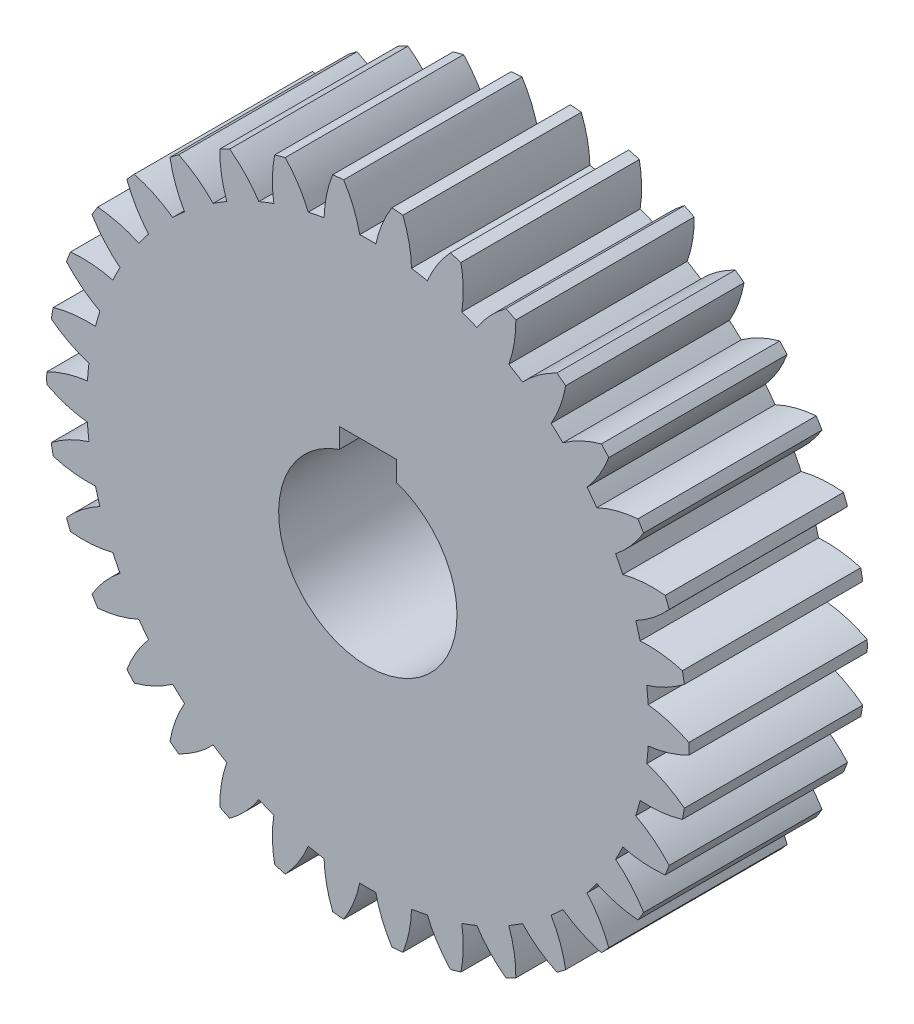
ISO-10303-21;
HEADER;
FILE_DESCRIPTION(('STEP AP214'),'2;1');
FILE_NAME('part.step','',(''),(''),'','','');
FILE_SCHEMA(('AUTOMOTIVE_DESIGN { 1 0 10303 214 1 1 1 1 }'));
ENDSEC;
DATA;
#1=APPLICATION_CONTEXT('core data for automotive mechanical design processes');
#2=APPLICATION_PROTOCOL_DEFINITION('international standard','automotive_design',2000,#1);
#3=PRODUCT_CONTEXT('',#1,'mechanical');
#4=PRODUCT('Part','Part','',(#3));
#5=PRODUCT_RELATED_PRODUCT_CATEGORY('part','',(#4));
#6=PRODUCT_DEFINITION_FORMATION('','',#4);
#7=PRODUCT_DEFINITION_CONTEXT('part definition',#1,'design');
#8=PRODUCT_DEFINITION('design','',#6,#7);
#9=PRODUCT_DEFINITION_SHAPE('','',#8);
#10=(LENGTH_UNIT() NAMED_UNIT(*) SI_UNIT(.MILLI.,.METRE.));
#11=(NAMED_UNIT(*) PLANE_ANGLE_UNIT() SI_UNIT($,.RADIAN.));
#12=(NAMED_UNIT(*) SI_UNIT($,.STERADIAN.) SOLID_ANGLE_UNIT());
#13=UNCERTAINTY_MEASURE_WITH_UNIT(LENGTH_MEASURE(1.E-05),#10,'distance_accuracy_value','');
#14=(GEOMETRIC_REPRESENTATION_CONTEXT(3) GLOBAL_UNCERTAINTY_ASSIGNED_CONTEXT((#13)) GLOBAL_UNIT_ASSIGNED_CONTEXT((#10,
#11,#12)) REPRESENTATION_CONTEXT('',''));
#15=CARTESIAN_POINT('',(0.,0.,0.));
#16=DIRECTION('',(0.,0.,1.));
#17=DIRECTION('',(1.,0.,0.));
#18=AXIS2_PLACEMENT_3D('',#15,#16,#17);
#19=CARTESIAN_POINT('',(0.,0.,50.));
#20=DIRECTION('',(0.,0.,1.));
#21=DIRECTION('',(1.,0.,0.));
#22=AXIS2_PLACEMENT_3D('',#19,#20,#21);
#23=PLANE('',#22);
#24=DIRECTION('',(0.,-1.,0.));
#25=VECTOR('',#24,1.);
#26=CARTESIAN_POINT('',(-8.,29.3,50.));
#27=LINE('',#26,#25);
#28=CARTESIAN_POINT('',(-8.,29.3,50.));
#29=VERTEX_POINT('',#28);
#30=CARTESIAN_POINT('',(-8.,23.685438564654,50.));
#31=VERTEX_POINT('',#30);
#32=EDGE_CURVE('E55',#29,#31,#27,.T.);
#33=ORIENTED_EDGE('',*,*,#32,.F.);
#34=DIRECTION('',(-1.,0.,0.));
#35=VECTOR('',#34,1.);
#36=CARTESIAN_POINT('',(-8.,29.3,50.));
#37=LINE('',#36,#35);
#38=CARTESIAN_POINT('',(8.,29.3,50.));
#39=VERTEX_POINT('',#38);
#40=EDGE_CURVE('E915',#39,#29,#37,.T.);
#41=ORIENTED_EDGE('',*,*,#40,.F.);
#42=DIRECTION('',(0.,1.,0.));
#43=VECTOR('',#42,1.);
#44=CARTESIAN_POINT('',(8.,29.3,50.));
#45=LINE('',#44,#43);
#46=CARTESIAN_POINT('',(8.,23.685438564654,50.));
#47=VERTEX_POINT('',#46);
#48=EDGE_CURVE('E918',#47,#39,#45,.T.);
#49=ORIENTED_EDGE('',*,*,#48,.F.);
#50=CARTESIAN_POINT('',(0.,0.,50.));
#51=DIRECTION('',(0.,0.,1.));
#52=DIRECTION('',(1.,0.,0.));
#53=AXIS2_PLACEMENT_3D('',#50,#51,#52);
#54=CIRCLE('',#53,25.);
#55=EDGE_CURVE('E937',#31,#47,#54,.T.);
#56=ORIENTED_EDGE('',*,*,#55,.F.);
#57=EDGE_LOOP('',(#33,#41,#49,#56));
#58=FACE_BOUND('',#57,.T.);
#59=CARTESIAN_POINT('',(-67.9754964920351,-41.9426722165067,50.));
#60=DIRECTION('',(0.,0.,-1.));
#61=DIRECTION('',(0.0922683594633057,-0.995734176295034,0.));
#62=AXIS2_PLACEMENT_3D('',#59,#60,#61);
#63=CIRCLE('',#62,34.);
#64=CARTESIAN_POINT('',(-88.7380804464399,-15.0184246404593,50.));
#65=VERTEX_POINT('',#64);
#66=CARTESIAN_POINT('',(-78.1729129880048,-9.50792700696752,50.));
#67=VERTEX_POINT('',#66);
#68=EDGE_CURVE('E1018',#65,#67,#63,.T.);
#69=ORIENTED_EDGE('',*,*,#68,.F.);
#70=CARTESIAN_POINT('',(0.,0.,50.));
#71=DIRECTION('',(0.,0.,1.));
#72=DIRECTION('',(1.,0.,0.));
#73=AXIS2_PLACEMENT_3D('',#70,#71,#72);
#74=CIRCLE('',#73,90.);
#75=CARTESIAN_POINT('',(-88.1710764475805,-18.0516281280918,50.));
#76=VERTEX_POINT('',#75);
#77=EDGE_CURVE('E2166',#65,#76,#74,.T.);
#78=ORIENTED_EDGE('',*,*,#77,.T.);
#79=CARTESIAN_POINT('',(-78.5367035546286,14.5547954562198,50.));
#80=DIRECTION('',(0.,0.,-1.));
#81=DIRECTION('',(-0.273662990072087,0.961825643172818,0.));
#82=AXIS2_PLACEMENT_3D('',#79,#80,#81);
#83=CIRCLE('',#82,34.);
#84=CARTESIAN_POINT('',(-76.3287298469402,-19.3734354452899,50.));
#85=VERTEX_POINT('',#84);
#86=EDGE_CURVE('E1031',#85,#76,#83,.T.);
#87=ORIENTED_EDGE('',*,*,#86,.F.);
#88=CARTESIAN_POINT('',(0.,0.,50.));
#89=DIRECTION('',(0.,0.,-1.));
#90=DIRECTION('',(-0.273662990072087,0.961825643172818,0.));
#91=AXIS2_PLACEMENT_3D('',#88,#89,#90);
#92=CIRCLE('',#91,78.749);
#93=CARTESIAN_POINT('',(-75.0947935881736,-23.7102715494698,50.));
#94=VERTEX_POINT('',#93);
#95=EDGE_CURVE('E1035',#94,#85,#92,.T.);
#96=ORIENTED_EDGE('',*,*,#95,.F.);
#97=CARTESIAN_POINT('',(-59.1111386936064,-53.7189832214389,50.));
#98=DIRECTION('',(0.,0.,-1.));
#99=DIRECTION('',(0.273662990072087,-0.961825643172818,0.));
#100=AXIS2_PLACEMENT_3D('',#97,#98,#99);
#101=CIRCLE('',#100,34.);
#102=CARTESIAN_POINT('',(-84.4675177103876,-31.0682869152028,50.));
#103=VERTEX_POINT('',#102);
#104=EDGE_CURVE('E4244',#103,#94,#101,.T.);
#105=ORIENTED_EDGE('',*,*,#104,.F.);
#106=CARTESIAN_POINT('',(-83.3528183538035,-33.9456576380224,50.));
#107=VERTEX_POINT('',#106);
#108=EDGE_CURVE('E2171',#103,#107,#74,.T.);
#109=ORIENTED_EDGE('',*,*,#108,.T.);
#110=CARTESIAN_POINT('',(-79.8739035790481,-0.124109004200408,50.));
#111=DIRECTION('',(0.,0.,-1.));
#112=DIRECTION('',(-0.445738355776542,0.895163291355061,0.));
#113=AXIS2_PLACEMENT_3D('',#110,#111,#112);
#114=CIRCLE('',#113,34.);
#115=CARTESIAN_POINT('',(-71.4692287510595,-33.0689331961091,50.));
#116=VERTEX_POINT('',#115);
#117=EDGE_CURVE('E4237',#116,#107,#114,.T.);
#118=ORIENTED_EDGE('',*,*,#117,.F.);
#119=CARTESIAN_POINT('',(0.,0.,50.));
#120=DIRECTION('',(0.,0.,-1.));
#121=DIRECTION('',(-0.445738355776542,0.895163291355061,0.));
#122=AXIS2_PLACEMENT_3D('',#119,#120,#121);
#123=CIRCLE('',#122,78.749);
#124=CARTESIAN_POINT('',(-69.4594110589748,-37.1051912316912,50.));
#125=VERTEX_POINT('',#124);
#126=EDGE_CURVE('E4225',#125,#116,#123,.T.);
#127=ORIENTED_EDGE('',*,*,#126,.F.);
#128=CARTESIAN_POINT('',(-48.2338219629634,-63.6659586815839,50.));
#129=DIRECTION('',(0.,0.,-1.));
#130=DIRECTION('',(0.445738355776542,-0.895163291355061,0.));
#131=AXIS2_PLACEMENT_3D('',#128,#129,#130);
#132=CIRCLE('',#131,34.);
#133=CARTESIAN_POINT('',(-77.3205149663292,-46.0601559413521,50.));
#134=VERTEX_POINT('',#133);
#135=EDGE_CURVE('E4223',#134,#125,#132,.T.);
#136=ORIENTED_EDGE('',*,*,#135,.F.);
#137=CARTESIAN_POINT('',(-75.6960800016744,-48.6837084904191,50.));
#138=VERTEX_POINT('',#137);
#139=EDGE_CURVE('E2175',#134,#138,#74,.T.);
#140=ORIENTED_EDGE('',*,*,#139,.T.);
#141=CARTESIAN_POINT('',(-78.4910936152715,-14.7987870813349,50.));
#142=DIRECTION('',(0.,0.,-1.));
#143=DIRECTION('',(-0.602634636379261,0.798017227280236,0.));
#144=AXIS2_PLACEMENT_3D('',#141,#142,#143);
#145=CIRCLE('',#144,34.);
#146=CARTESIAN_POINT('',(-64.1759287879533,-45.6383080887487,50.));
#147=VERTEX_POINT('',#146);
#148=EDGE_CURVE('E1103',#147,#138,#145,.T.);
#149=ORIENTED_EDGE('',*,*,#148,.F.);
#150=CARTESIAN_POINT('',(0.,0.,50.));
#151=DIRECTION('',(0.,0.,-1.));
#152=DIRECTION('',(-0.602634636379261,0.798017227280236,0.));
#153=AXIS2_PLACEMENT_3D('',#150,#151,#152);
#154=CIRCLE('',#153,78.749);
#155=CARTESIAN_POINT('',(-61.4586715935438,-49.236538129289,50.));
#156=VERTEX_POINT('',#155);
#157=EDGE_CURVE('E1137',#156,#147,#154,.T.);
#158=ORIENTED_EDGE('',*,*,#157,.F.);
#159=CARTESIAN_POINT('',(-35.7139602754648,-71.4448662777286,50.));
#160=DIRECTION('',(0.,0.,-1.));
#161=DIRECTION('',(0.602634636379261,-0.798017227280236,0.));
#162=AXIS2_PLACEMENT_3D('',#159,#160,#161);
#163=CIRCLE('',#162,34.);
#164=CARTESIAN_POINT('',(-67.5404548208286,-59.4835015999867,50.));
#165=VERTEX_POINT('',#164);
#166=EDGE_CURVE('E1133',#165,#156,#163,.T.);
#167=ORIENTED_EDGE('',*,*,#166,.F.);
#168=CARTESIAN_POINT('',(-65.4616024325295,-61.7638940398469,50.));
#169=VERTEX_POINT('',#168);
#170=EDGE_CURVE('E2180',#165,#169,#74,.T.);
#171=ORIENTED_EDGE('',*,*,#170,.T.);
#172=CARTESIAN_POINT('',(-74.4353635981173,-28.9695102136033,50.));
#173=DIRECTION('',(0.,0.,-1.));
#174=DIRECTION('',(-0.739008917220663,0.673695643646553,0.));
#175=AXIS2_PLACEMENT_3D('',#172,#173,#174);
#176=CIRCLE('',#175,34.);
#177=CARTESIAN_POINT('',(-54.6971945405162,-56.6535251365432,50.));
#178=VERTEX_POINT('',#177);
#179=EDGE_CURVE('E1400',#178,#169,#176,.T.);
#180=ORIENTED_EDGE('',*,*,#179,.F.);
#181=CARTESIAN_POINT('',(0.,0.,50.));
#182=DIRECTION('',(0.,0.,-1.));
#183=DIRECTION('',(-0.739008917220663,0.673695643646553,0.));
#184=AXIS2_PLACEMENT_3D('',#181,#182,#183);
#185=CIRCLE('',#184,78.749);
#186=CARTESIAN_POINT('',(-51.3650307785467,-59.6911937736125,50.));
#187=VERTEX_POINT('',#186);
#188=EDGE_CURVE('E4209',#187,#178,#185,.T.);
#189=ORIENTED_EDGE('',*,*,#188,.F.);
#190=CARTESIAN_POINT('',(-21.9779025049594,-76.7908046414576,50.));
#191=DIRECTION('',(0.,0.,-1.));
#192=DIRECTION('',(0.739008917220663,-0.673695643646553,0.));
#193=AXIS2_PLACEMENT_3D('',#190,#191,#192);
#194=CIRCLE('',#193,34.);
#195=CARTESIAN_POINT('',(-55.4603854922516,-70.8812079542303,50.));
#196=VERTEX_POINT('',#195);
#197=EDGE_CURVE('E4213',#196,#187,#194,.T.);
#198=ORIENTED_EDGE('',*,*,#197,.F.);
#199=CARTESIAN_POINT('',(-52.9979085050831,-72.7407842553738,50.));
#200=VERTEX_POINT('',#199);
#201=EDGE_CURVE('E2185',#196,#200,#74,.T.);
#202=ORIENTED_EDGE('',*,*,#201,.T.);
#203=CARTESIAN_POINT('',(-67.8448265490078,-42.1537114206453,50.));
#204=DIRECTION('',(0.,0.,-1.));
#205=DIRECTION('',(-0.850217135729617,0.526432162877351,0.));
#206=AXIS2_PLACEMENT_3D('',#203,#204,#205);
#207=CIRCLE('',#206,34.);
#208=CARTESIAN_POINT('',(-43.3558129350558,-65.7394743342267,50.));
#209=VERTEX_POINT('',#208);
#210=EDGE_CURVE('E1378',#209,#200,#207,.T.);
#211=ORIENTED_EDGE('',*,*,#210,.F.);
#212=CARTESIAN_POINT('',(0.,0.,50.));
#213=DIRECTION('',(0.,0.,-1.));
#214=DIRECTION('',(-0.850217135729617,0.526432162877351,0.));
#215=AXIS2_PLACEMENT_3D('',#212,#213,#214);
#216=CIRCLE('',#215,78.749);
#217=CARTESIAN_POINT('',(-39.5222154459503,-68.1131374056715,50.));
#218=VERTEX_POINT('',#217);
#219=EDGE_CURVE('E2972',#218,#209,#216,.T.);
#220=ORIENTED_EDGE('',*,*,#219,.F.);
#221=CARTESIAN_POINT('',(-7.4934136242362,-79.5217242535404,50.));
#222=DIRECTION('',(0.,0.,-1.));
#223=DIRECTION('',(0.850217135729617,-0.526432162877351,0.));
#224=AXIS2_PLACEMENT_3D('',#221,#222,#223);
#225=CIRCLE('',#224,34.);
#226=CARTESIAN_POINT('',(-41.4916792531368,-79.8651397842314,50.));
#227=VERTEX_POINT('',#226);
#228=EDGE_CURVE('E2402',#227,#218,#225,.T.);
#229=ORIENTED_EDGE('',*,*,#228,.F.);
#230=CARTESIAN_POINT('',(-38.7294343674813,-81.2405743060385,50.));
#231=VERTEX_POINT('',#230);
#232=EDGE_CURVE('E2190',#227,#231,#74,.T.);
#233=ORIENTED_EDGE('',*,*,#232,.T.);
#234=CARTESIAN_POINT('',(-58.9439153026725,-53.9024185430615,50.));
#235=DIRECTION('',(0.,0.,-1.));
#236=DIRECTION('',(-0.932472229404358,0.361241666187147,0.));
#237=AXIS2_PLACEMENT_3D('',#234,#235,#236);
#238=CIRCLE('',#237,34.);
#239=CARTESIAN_POINT('',(-30.5380011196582,-72.586744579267,50.));
#240=VERTEX_POINT('',#239);
#241=EDGE_CURVE('E1356',#240,#231,#238,.T.);
#242=ORIENTED_EDGE('',*,*,#241,.F.);
#243=CARTESIAN_POINT('',(0.,0.,50.));
#244=DIRECTION('',(0.,0.,-1.));
#245=DIRECTION('',(-0.932472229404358,0.361241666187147,0.));
#246=AXIS2_PLACEMENT_3D('',#243,#244,#245);
#247=CIRCLE('',#246,78.749);
#248=CARTESIAN_POINT('',(-26.3335184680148,-74.2155698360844,50.));
#249=VERTEX_POINT('',#248);
#250=EDGE_CURVE('E2416',#249,#240,#247,.T.);
#251=ORIENTED_EDGE('',*,*,#250,.F.);
#252=CARTESIAN_POINT('',(7.2462544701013,-79.5446269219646,50.));
#253=DIRECTION('',(0.,0.,-1.));
#254=DIRECTION('',(0.932472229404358,-0.361241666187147,0.));
#255=AXIS2_PLACEMENT_3D('',#252,#253,#254);
#256=CIRCLE('',#255,34.);
#257=CARTESIAN_POINT('',(-26.1100236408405,-86.1293600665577,50.));
#258=VERTEX_POINT('',#257);
#259=EDGE_CURVE('E2414',#258,#249,#256,.T.);
#260=ORIENTED_EDGE('',*,*,#259,.F.);
#261=CARTESIAN_POINT('',(-23.1420757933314,-86.9738140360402,50.));
#262=VERTEX_POINT('',#261);
#263=EDGE_CURVE('E2195',#258,#262,#74,.T.);
#264=ORIENTED_EDGE('',*,*,#263,.T.);
#265=CARTESIAN_POINT('',(-48.0357397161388,-63.815543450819,50.));
#266=DIRECTION('',(0.,0.,-1.));
#267=DIRECTION('',(-0.982973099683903,0.183749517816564,0.));
#268=AXIS2_PLACEMENT_3D('',#265,#266,#267);
#269=CIRCLE('',#268,34.);
#270=CARTESIAN_POINT('',(-16.680254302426,-76.9621602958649,50.));
#271=VERTEX_POINT('',#270);
#272=EDGE_CURVE('E1333',#271,#262,#269,.T.);
#273=ORIENTED_EDGE('',*,*,#272,.F.);
#274=CARTESIAN_POINT('',(0.,0.,50.));
#275=DIRECTION('',(0.,0.,-1.));
#276=DIRECTION('',(-0.982973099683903,0.183749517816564,0.));
#277=AXIS2_PLACEMENT_3D('',#274,#275,#276);
#278=CIRCLE('',#277,78.749);
#279=CARTESIAN_POINT('',(-12.2480651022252,-77.7906800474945,50.));
#280=VERTEX_POINT('',#279);
#281=EDGE_CURVE('E2300',#280,#271,#278,.T.);
#282=ORIENTED_EDGE('',*,*,#281,.F.);
#283=CARTESIAN_POINT('',(21.7391600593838,-76.8587327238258,50.));
#284=DIRECTION('',(0.,0.,-1.));
#285=DIRECTION('',(0.982973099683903,-0.183749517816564,0.));
#286=AXIS2_PLACEMENT_3D('',#283,#284,#285);
#287=CIRCLE('',#286,34.);
#288=CARTESIAN_POINT('',(-9.8392224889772,-89.4605482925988,50.));
#289=VERTEX_POINT('',#288);
#290=EDGE_CURVE('E2297',#289,#280,#287,.T.);
#291=ORIENTED_EDGE('',*,*,#290,.F.);
#292=CARTESIAN_POINT('',(-6.76664158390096,-89.7452648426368,50.));
#293=VERTEX_POINT('',#292);
#294=EDGE_CURVE('E2200',#289,#293,#74,.T.);
#295=ORIENTED_EDGE('',*,*,#294,.T.);
#296=CARTESIAN_POINT('',(-35.4917646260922,-71.5555065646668,50.));
#297=DIRECTION('',(0.,0.,-1.));
#298=DIRECTION('',(-1.,0.,0.));
#299=AXIS2_PLACEMENT_3D('',#296,#297,#298);
#300=CIRCLE('',#299,34.);
#301=CARTESIAN_POINT('',(-2.25448143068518,-78.7167219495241,50.));
#302=VERTEX_POINT('',#301);
#303=EDGE_CURVE('E1309',#302,#293,#300,.T.);
#304=ORIENTED_EDGE('',*,*,#303,.F.);
#305=CARTESIAN_POINT('',(0.,0.,50.));
#306=DIRECTION('',(0.,0.,-1.));
#307=DIRECTION('',(-1.,0.,0.));
#308=AXIS2_PLACEMENT_3D('',#305,#306,#307);
#309=CIRCLE('',#308,78.749);
#310=CARTESIAN_POINT('',(2.25448143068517,-78.7167219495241,50.));
#311=VERTEX_POINT('',#310);
#312=EDGE_CURVE('E2368',#311,#302,#309,.T.);
#313=ORIENTED_EDGE('',*,*,#312,.F.);
#314=CARTESIAN_POINT('',(35.4917646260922,-71.5555065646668,50.));
#315=DIRECTION('',(0.,0.,-1.));
#316=DIRECTION('',(1.,0.,0.));
#317=AXIS2_PLACEMENT_3D('',#314,#315,#316);
#318=CIRCLE('',#317,34.);
#319=CARTESIAN_POINT('',(6.76664158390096,-89.7452648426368,50.));
#320=VERTEX_POINT('',#319);
#321=EDGE_CURVE('E2329',#320,#311,#318,.T.);
#322=ORIENTED_EDGE('',*,*,#321,.F.);
#323=CARTESIAN_POINT('',(9.83922248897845,-89.4605482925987,50.));
#324=VERTEX_POINT('',#323);
#325=EDGE_CURVE('E2205',#320,#324,#74,.T.);
#326=ORIENTED_EDGE('',*,*,#325,.T.);
#327=CARTESIAN_POINT('',(-21.7391600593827,-76.8587327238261,50.));
#328=DIRECTION('',(0.,0.,-1.));
#329=DIRECTION('',(-0.9829730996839,-0.183749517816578,0.));
#330=AXIS2_PLACEMENT_3D('',#327,#328,#329);
#331=CIRCLE('',#330,34.);
#332=CARTESIAN_POINT('',(12.2480651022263,-77.7906800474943,50.));
#333=VERTEX_POINT('',#332);
#334=EDGE_CURVE('E1086',#333,#324,#331,.T.);
#335=ORIENTED_EDGE('',*,*,#334,.F.);
#336=CARTESIAN_POINT('',(0.,0.,50.));
#337=DIRECTION('',(0.,0.,-1.));
#338=DIRECTION('',(-0.9829730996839,-0.183749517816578,0.));
#339=AXIS2_PLACEMENT_3D('',#336,#337,#338);
#340=CIRCLE('',#339,78.749);
#341=CARTESIAN_POINT('',(16.6802543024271,-76.9621602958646,50.));
#342=VERTEX_POINT('',#341);
#343=EDGE_CURVE('E2341',#342,#333,#340,.T.);
#344=ORIENTED_EDGE('',*,*,#343,.F.);
#345=CARTESIAN_POINT('',(48.0357397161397,-63.8155434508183,50.));
#346=DIRECTION('',(0.,0.,-1.));
#347=DIRECTION('',(0.9829730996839,0.183749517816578,0.));
#348=AXIS2_PLACEMENT_3D('',#345,#346,#347);
#349=CIRCLE('',#348,34.);
#350=CARTESIAN_POINT('',(23.1420757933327,-86.9738140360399,50.));
#351=VERTEX_POINT('',#350);
#352=EDGE_CURVE('E2345',#351,#342,#349,.T.);
#353=ORIENTED_EDGE('',*,*,#352,.F.);
#354=CARTESIAN_POINT('',(26.1100236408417,-86.1293600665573,50.));
#355=VERTEX_POINT('',#354);
#356=EDGE_CURVE('E2210',#351,#355,#74,.T.);
#357=ORIENTED_EDGE('',*,*,#356,.T.);
#358=CARTESIAN_POINT('',(-7.24625447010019,-79.5446269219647,50.));
#359=DIRECTION('',(0.,0.,-1.));
#360=DIRECTION('',(-0.932472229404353,-0.36124166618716,0.));
#361=AXIS2_PLACEMENT_3D('',#358,#359,#360);
#362=CIRCLE('',#361,34.);
#363=CARTESIAN_POINT('',(26.3335184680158,-74.2155698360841,50.));
#364=VERTEX_POINT('',#363);
#365=EDGE_CURVE('E2961',#364,#355,#362,.T.);
#366=ORIENTED_EDGE('',*,*,#365,.F.);
#367=CARTESIAN_POINT('',(0.,0.,50.));
#368=DIRECTION('',(0.,0.,-1.));
#369=DIRECTION('',(-0.932472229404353,-0.36124166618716,0.));
#370=AXIS2_PLACEMENT_3D('',#367,#368,#369);
#371=CIRCLE('',#370,78.749);
#372=CARTESIAN_POINT('',(30.5380011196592,-72.5867445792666,50.));
#373=VERTEX_POINT('',#372);
#374=EDGE_CURVE('E4325',#373,#364,#371,.T.);
#375=ORIENTED_EDGE('',*,*,#374,.F.);
#376=CARTESIAN_POINT('',(58.9439153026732,-53.9024185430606,50.));
#377=DIRECTION('',(0.,0.,-1.));
#378=DIRECTION('',(0.932472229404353,0.36124166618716,0.));
#379=AXIS2_PLACEMENT_3D('',#376,#377,#378);
#380=CIRCLE('',#379,34.);
#381=CARTESIAN_POINT('',(38.7294343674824,-81.2405743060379,50.));
#382=VERTEX_POINT('',#381);
#383=EDGE_CURVE('E4329',#382,#373,#380,.T.);
#384=ORIENTED_EDGE('',*,*,#383,.F.);
#385=CARTESIAN_POINT('',(41.4916792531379,-79.8651397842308,50.));
#386=VERTEX_POINT('',#385);
#387=EDGE_CURVE('E2215',#382,#386,#74,.T.);
#388=ORIENTED_EDGE('',*,*,#387,.T.);
#389=CARTESIAN_POINT('',(7.49341362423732,-79.5217242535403,50.));
#390=DIRECTION('',(0.,0.,-1.));
#391=DIRECTION('',(-0.85021713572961,-0.526432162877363,0.));
#392=AXIS2_PLACEMENT_3D('',#389,#390,#391);
#393=CIRCLE('',#392,34.);
#394=CARTESIAN_POINT('',(39.5222154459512,-68.113137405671,50.));
#395=VERTEX_POINT('',#394);
#396=EDGE_CURVE('E2855',#395,#386,#393,.T.);
#397=ORIENTED_EDGE('',*,*,#396,.F.);
#398=CARTESIAN_POINT('',(0.,0.,50.));
#399=DIRECTION('',(0.,0.,-1.));
#400=DIRECTION('',(-0.85021713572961,-0.526432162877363,0.));
#401=AXIS2_PLACEMENT_3D('',#398,#399,#400);
#402=CIRCLE('',#401,78.749);
#403=CARTESIAN_POINT('',(43.3558129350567,-65.7394743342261,50.));
#404=VERTEX_POINT('',#403);
#405=EDGE_CURVE('E2851',#404,#395,#402,.T.);
#406=ORIENTED_EDGE('',*,*,#405,.F.);
#407=CARTESIAN_POINT('',(67.8448265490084,-42.1537114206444,50.));
#408=DIRECTION('',(0.,0.,-1.));
#409=DIRECTION('',(0.85021713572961,0.526432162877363,0.));
#410=AXIS2_PLACEMENT_3D('',#407,#408,#409);
#411=CIRCLE('',#410,34.);
#412=CARTESIAN_POINT('',(52.9979085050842,-72.7407842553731,50.));
#413=VERTEX_POINT('',#412);
#414=EDGE_CURVE('E2845',#413,#404,#411,.T.);
#415=ORIENTED_EDGE('',*,*,#414,.F.);
#416=CARTESIAN_POINT('',(55.4603854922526,-70.8812079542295,50.));
#417=VERTEX_POINT('',#416);
#418=EDGE_CURVE('E2220',#413,#417,#74,.T.);
#419=ORIENTED_EDGE('',*,*,#418,.T.);
#420=CARTESIAN_POINT('',(21.9779025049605,-76.7908046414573,50.));
#421=DIRECTION('',(0.,0.,-1.));
#422=DIRECTION('',(-0.739008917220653,-0.673695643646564,0.));
#423=AXIS2_PLACEMENT_3D('',#420,#421,#422);
#424=CIRCLE('',#423,34.);
#425=CARTESIAN_POINT('',(51.3650307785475,-59.6911937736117,50.));
#426=VERTEX_POINT('',#425);
#427=EDGE_CURVE('E2637',#426,#417,#424,.T.);
#428=ORIENTED_EDGE('',*,*,#427,.F.);
#429=CARTESIAN_POINT('',(0.,0.,50.));
#430=DIRECTION('',(0.,0.,-1.));
#431=DIRECTION('',(-0.739008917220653,-0.673695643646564,0.));
#432=AXIS2_PLACEMENT_3D('',#429,#430,#431);
#433=CIRCLE('',#432,78.749);
#434=CARTESIAN_POINT('',(54.697194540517,-56.6535251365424,50.));
#435=VERTEX_POINT('',#434);
#436=EDGE_CURVE('E4352',#435,#426,#433,.T.);
#437=ORIENTED_EDGE('',*,*,#436,.F.);
#438=CARTESIAN_POINT('',(74.4353635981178,-28.9695102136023,50.));
#439=DIRECTION('',(0.,0.,-1.));
#440=DIRECTION('',(0.739008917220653,0.673695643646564,0.));
#441=AXIS2_PLACEMENT_3D('',#438,#439,#440);
#442=CIRCLE('',#441,34.);
#443=CARTESIAN_POINT('',(65.4616024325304,-61.763894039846,50.));
#444=VERTEX_POINT('',#443);
#445=EDGE_CURVE('E2823',#444,#435,#442,.T.);
#446=ORIENTED_EDGE('',*,*,#445,.F.);
#447=CARTESIAN_POINT('',(67.5404548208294,-59.4835015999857,50.));
#448=VERTEX_POINT('',#447);
#449=EDGE_CURVE('E2225',#444,#448,#74,.T.);
#450=ORIENTED_EDGE('',*,*,#449,.T.);
#451=CARTESIAN_POINT('',(35.7139602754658,-71.4448662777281,50.));
#452=DIRECTION('',(0.,0.,-1.));
#453=DIRECTION('',(-0.602634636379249,-0.798017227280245,0.));
#454=AXIS2_PLACEMENT_3D('',#451,#452,#453);
#455=CIRCLE('',#454,34.);
#456=CARTESIAN_POINT('',(61.4586715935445,-49.2365381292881,50.));
#457=VERTEX_POINT('',#456);
#458=EDGE_CURVE('E2484',#457,#448,#455,.T.);
#459=ORIENTED_EDGE('',*,*,#458,.F.);
#460=CARTESIAN_POINT('',(0.,0.,50.));
#461=DIRECTION('',(0.,0.,-1.));
#462=DIRECTION('',(-0.602634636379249,-0.798017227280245,0.));
#463=AXIS2_PLACEMENT_3D('',#460,#461,#462);
#464=CIRCLE('',#463,78.749);
#465=CARTESIAN_POINT('',(64.175928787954,-45.6383080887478,50.));
#466=VERTEX_POINT('',#465);
#467=EDGE_CURVE('E2517',#466,#457,#464,.T.);
#468=ORIENTED_EDGE('',*,*,#467,.F.);
#469=CARTESIAN_POINT('',(78.4910936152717,-14.7987870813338,50.));
#470=DIRECTION('',(0.,0.,-1.));
#471=DIRECTION('',(0.602634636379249,0.798017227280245,0.));
#472=AXIS2_PLACEMENT_3D('',#469,#470,#471);
#473=CIRCLE('',#472,34.);
#474=CARTESIAN_POINT('',(75.6960800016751,-48.683708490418,50.));
#475=VERTEX_POINT('',#474);
#476=EDGE_CURVE('E2513',#475,#466,#473,.T.);
#477=ORIENTED_EDGE('',*,*,#476,.F.);
#478=CARTESIAN_POINT('',(77.3205149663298,-46.060155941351,50.));
#479=VERTEX_POINT('',#478);
#480=EDGE_CURVE('E2230',#475,#479,#74,.T.);
#481=ORIENTED_EDGE('',*,*,#480,.T.);
#482=CARTESIAN_POINT('',(48.2338219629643,-63.6659586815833,50.));
#483=DIRECTION('',(0.,0.,-1.));
#484=DIRECTION('',(-0.44573835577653,-0.895163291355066,0.));
#485=AXIS2_PLACEMENT_3D('',#482,#483,#484);
#486=CIRCLE('',#485,34.);
#487=CARTESIAN_POINT('',(69.4594110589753,-37.1051912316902,50.));
#488=VERTEX_POINT('',#487);
#489=EDGE_CURVE('E2547',#488,#479,#486,.T.);
#490=ORIENTED_EDGE('',*,*,#489,.F.);
#491=CARTESIAN_POINT('',(0.,0.,50.));
#492=DIRECTION('',(0.,0.,-1.));
#493=DIRECTION('',(-0.44573835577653,-0.895163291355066,0.));
#494=AXIS2_PLACEMENT_3D('',#491,#492,#493);
#495=CIRCLE('',#494,78.749);
#496=CARTESIAN_POINT('',(71.46922875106,-33.0689331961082,50.));
#497=VERTEX_POINT('',#496);
#498=EDGE_CURVE('E2552',#497,#488,#495,.T.);
#499=ORIENTED_EDGE('',*,*,#498,.F.);
#500=CARTESIAN_POINT('',(79.8739035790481,-0.124109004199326,50.));
#501=DIRECTION('',(0.,0.,-1.));
#502=DIRECTION('',(0.44573835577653,0.895163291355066,0.));
#503=AXIS2_PLACEMENT_3D('',#500,#501,#502);
#504=CIRCLE('',#503,34.);
#505=CARTESIAN_POINT('',(83.352818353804,-33.9456576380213,50.));
#506=VERTEX_POINT('',#505);
#507=EDGE_CURVE('E2246',#506,#497,#504,.T.);
#508=ORIENTED_EDGE('',*,*,#507,.F.);
#509=CARTESIAN_POINT('',(84.467517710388,-31.0682869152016,50.));
#510=VERTEX_POINT('',#509);
#511=EDGE_CURVE('E1864',#506,#510,#74,.T.);
#512=ORIENTED_EDGE('',*,*,#511,.T.);
#513=CARTESIAN_POINT('',(59.1111386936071,-53.7189832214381,50.));
#514=DIRECTION('',(0.,0.,-1.));
#515=DIRECTION('',(-0.273662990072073,-0.961825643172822,0.));
#516=AXIS2_PLACEMENT_3D('',#513,#514,#515);
#517=CIRCLE('',#516,34.);
#518=CARTESIAN_POINT('',(75.094793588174,-23.7102715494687,50.));
#519=VERTEX_POINT('',#518);
#520=EDGE_CURVE('E2243',#519,#510,#517,.T.);
#521=ORIENTED_EDGE('',*,*,#520,.F.);
#522=CARTESIAN_POINT('',(0.,0.,50.));
#523=DIRECTION('',(0.,0.,-1.));
#524=DIRECTION('',(-0.273662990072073,-0.961825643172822,0.));
#525=AXIS2_PLACEMENT_3D('',#522,#523,#524);
#526=CIRCLE('',#525,78.749);
#527=CARTESIAN_POINT('',(76.3287298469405,-19.3734354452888,50.));
#528=VERTEX_POINT('',#527);
#529=EDGE_CURVE('E4365',#528,#519,#526,.T.);
#530=ORIENTED_EDGE('',*,*,#529,.F.);
#531=CARTESIAN_POINT('',(78.5367035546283,14.5547954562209,50.));
#532=DIRECTION('',(0.,0.,-1.));
#533=DIRECTION('',(0.273662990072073,0.961825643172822,0.));
#534=AXIS2_PLACEMENT_3D('',#531,#532,#533);
#535=CIRCLE('',#534,34.);
#536=CARTESIAN_POINT('',(88.1710764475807,-18.0516281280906,50.));
#537=VERTEX_POINT('',#536);
#538=EDGE_CURVE('E4363',#537,#528,#535,.T.);
#539=ORIENTED_EDGE('',*,*,#538,.F.);
#540=CARTESIAN_POINT('',(88.7380804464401,-15.0184246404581,50.));
#541=VERTEX_POINT('',#540);
#542=EDGE_CURVE('E1861',#537,#541,#74,.T.);
#543=ORIENTED_EDGE('',*,*,#542,.T.);
#544=CARTESIAN_POINT('',(67.9754964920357,-41.9426722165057,50.));
#545=DIRECTION('',(0.,0.,-1.));
#546=DIRECTION('',(-0.0922683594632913,-0.995734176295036,0.));
#547=AXIS2_PLACEMENT_3D('',#544,#545,#546);
#548=CIRCLE('',#547,34.);
#549=CARTESIAN_POINT('',(78.172912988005,-9.50792700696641,50.));
#550=VERTEX_POINT('',#549);
#551=EDGE_CURVE('E1644',#550,#541,#548,.T.);
#552=ORIENTED_EDGE('',*,*,#551,.F.);
#553=CARTESIAN_POINT('',(0.,0.,50.));
#554=DIRECTION('',(0.,0.,-1.));
#555=DIRECTION('',(-0.0922683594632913,-0.995734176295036,0.));
#556=AXIS2_PLACEMENT_3D('',#553,#554,#555);
#557=CIRCLE('',#556,78.749);
#558=CARTESIAN_POINT('',(78.5889475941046,-5.0181985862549,50.));
#559=VERTEX_POINT('',#558);
#560=EDGE_CURVE('E2590',#559,#550,#557,.T.);
#561=ORIENTED_EDGE('',*,*,#560,.F.);
#562=CARTESIAN_POINT('',(74.5250302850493,28.7380538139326,50.));
#563=DIRECTION('',(0.,0.,-1.));
#564=DIRECTION('',(0.0922683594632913,0.995734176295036,0.));
#565=AXIS2_PLACEMENT_3D('',#562,#563,#564);
#566=CIRCLE('',#565,34.);
#567=CARTESIAN_POINT('',(89.9867742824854,-1.54287207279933,50.));
#568=VERTEX_POINT('',#567);
#569=EDGE_CURVE('E1860',#568,#559,#566,.T.);
#570=ORIENTED_EDGE('',*,*,#569,.F.);
#571=CARTESIAN_POINT('',(89.9867742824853,1.5428720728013,50.));
#572=VERTEX_POINT('',#571);
#573=EDGE_CURVE('E1848',#568,#572,#74,.T.);
#574=ORIENTED_EDGE('',*,*,#573,.T.);
#575=CARTESIAN_POINT('',(74.52503028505,-28.7380538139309,50.));
#576=DIRECTION('',(0.,0.,-1.));
#577=DIRECTION('',(0.092268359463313,-0.995734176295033,0.));
#578=AXIS2_PLACEMENT_3D('',#575,#576,#577);
#579=CIRCLE('',#578,34.);
#580=CARTESIAN_POINT('',(78.5889475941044,5.0181985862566,50.));
#581=VERTEX_POINT('',#580);
#582=EDGE_CURVE('E1805',#581,#572,#579,.T.);
#583=ORIENTED_EDGE('',*,*,#582,.F.);
#584=CARTESIAN_POINT('',(0.,0.,50.));
#585=DIRECTION('',(0.,0.,-1.));
#586=DIRECTION('',(0.092268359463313,-0.995734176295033,0.));
#587=AXIS2_PLACEMENT_3D('',#584,#585,#586);
#588=CIRCLE('',#587,78.749);
#589=CARTESIAN_POINT('',(78.1729129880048,9.5079270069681,50.));
#590=VERTEX_POINT('',#589);
#591=EDGE_CURVE('E1832',#590,#581,#588,.T.);
#592=ORIENTED_EDGE('',*,*,#591,.F.);
#593=CARTESIAN_POINT('',(67.9754964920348,41.9426722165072,50.));
#594=DIRECTION('',(0.,0.,-1.));
#595=DIRECTION('',(-0.092268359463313,0.995734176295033,0.));
#596=AXIS2_PLACEMENT_3D('',#593,#594,#595);
#597=CIRCLE('',#596,34.);
#598=CARTESIAN_POINT('',(88.7380804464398,15.01842464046,50.));
#599=VERTEX_POINT('',#598);
#600=EDGE_CURVE('E1828',#599,#590,#597,.T.);
#601=ORIENTED_EDGE('',*,*,#600,.F.);
#602=CARTESIAN_POINT('',(88.1710764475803,18.0516281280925,50.));
#603=VERTEX_POINT('',#602);
#604=EDGE_CURVE('E1862',#599,#603,#74,.T.);
#605=ORIENTED_EDGE('',*,*,#604,.T.);
#606=CARTESIAN_POINT('',(78.5367035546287,-14.5547954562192,50.));
#607=DIRECTION('',(0.,0.,-1.));
#608=DIRECTION('',(0.273662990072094,-0.961825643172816,0.));
#609=AXIS2_PLACEMENT_3D('',#606,#607,#608);
#610=CIRCLE('',#609,34.);
#611=CARTESIAN_POINT('',(76.3287298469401,19.3734354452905,50.));
#612=VERTEX_POINT('',#611);
#613=EDGE_CURVE('E1597',#612,#603,#610,.T.);
#614=ORIENTED_EDGE('',*,*,#613,.F.);
#615=CARTESIAN_POINT('',(0.,0.,50.));
#616=DIRECTION('',(0.,0.,-1.));
#617=DIRECTION('',(0.273662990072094,-0.961825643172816,0.));
#618=AXIS2_PLACEMENT_3D('',#615,#616,#617);
#619=CIRCLE('',#618,78.749);
#620=CARTESIAN_POINT('',(75.0947935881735,23.7102715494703,50.));
#621=VERTEX_POINT('',#620);
#622=EDGE_CURVE('E1593',#621,#612,#619,.T.);
#623=ORIENTED_EDGE('',*,*,#622,.F.);
#624=CARTESIAN_POINT('',(59.111138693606,53.7189832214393,50.));
#625=DIRECTION('',(0.,0.,-1.));
#626=DIRECTION('',(-0.273662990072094,0.961825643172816,0.));
#627=AXIS2_PLACEMENT_3D('',#624,#625,#626);
#628=CIRCLE('',#627,34.);
#629=CARTESIAN_POINT('',(84.4675177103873,31.0682869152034,50.));
#630=VERTEX_POINT('',#629);
#631=EDGE_CURVE('E1586',#630,#621,#628,.T.);
#632=ORIENTED_EDGE('',*,*,#631,.F.);
#633=CARTESIAN_POINT('',(83.3528183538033,33.9456576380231,50.));
#634=VERTEX_POINT('',#633);
#635=EDGE_CURVE('E1866',#630,#634,#74,.T.);
#636=ORIENTED_EDGE('',*,*,#635,.T.);
#637=CARTESIAN_POINT('',(79.8739035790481,0.124109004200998,50.));
#638=DIRECTION('',(0.,0.,-1.));
#639=DIRECTION('',(0.445738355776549,-0.895163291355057,0.));
#640=AXIS2_PLACEMENT_3D('',#637,#638,#639);
#641=CIRCLE('',#640,34.);
#642=CARTESIAN_POINT('',(71.4692287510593,33.0689331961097,50.));
#643=VERTEX_POINT('',#642);
#644=EDGE_CURVE('E1713',#643,#634,#641,.T.);
#645=ORIENTED_EDGE('',*,*,#644,.F.);
#646=CARTESIAN_POINT('',(0.,0.,50.));
#647=DIRECTION('',(0.,0.,-1.));
#648=DIRECTION('',(0.445738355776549,-0.895163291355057,0.));
#649=AXIS2_PLACEMENT_3D('',#646,#647,#648);
#650=CIRCLE('',#649,78.749);
#651=CARTESIAN_POINT('',(69.4594110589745,37.1051912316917,50.));
#652=VERTEX_POINT('',#651);
#653=EDGE_CURVE('E3202',#652,#643,#650,.T.);
#654=ORIENTED_EDGE('',*,*,#653,.F.);
#655=CARTESIAN_POINT('',(48.2338219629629,63.6659586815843,50.));
#656=DIRECTION('',(0.,0.,-1.));
#657=DIRECTION('',(-0.445738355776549,0.895163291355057,0.));
#658=AXIS2_PLACEMENT_3D('',#655,#656,#657);
#659=CIRCLE('',#658,34.);
#660=CARTESIAN_POINT('',(77.3205149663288,46.0601559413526,50.));
#661=VERTEX_POINT('',#660);
#662=EDGE_CURVE('E3200',#661,#652,#659,.T.);
#663=ORIENTED_EDGE('',*,*,#662,.F.);
#664=CARTESIAN_POINT('',(75.6960800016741,48.6837084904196,50.));
#665=VERTEX_POINT('',#664);
#666=EDGE_CURVE('E1870',#661,#665,#74,.T.);
#667=ORIENTED_EDGE('',*,*,#666,.T.);
#668=CARTESIAN_POINT('',(78.4910936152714,14.7987870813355,50.));
#669=DIRECTION('',(0.,0.,-1.));
#670=DIRECTION('',(0.602634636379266,-0.798017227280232,0.));
#671=AXIS2_PLACEMENT_3D('',#668,#669,#670);
#672=CIRCLE('',#671,34.);
#673=CARTESIAN_POINT('',(64.175928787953,45.6383080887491,50.));
#674=VERTEX_POINT('',#673);
#675=EDGE_CURVE('E1541',#674,#665,#672,.T.);
#676=ORIENTED_EDGE('',*,*,#675,.F.);
#677=CARTESIAN_POINT('',(0.,0.,50.));
#678=DIRECTION('',(0.,0.,-1.));
#679=DIRECTION('',(0.602634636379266,-0.798017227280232,0.));
#680=AXIS2_PLACEMENT_3D('',#677,#678,#679);
#681=CIRCLE('',#680,78.749);
#682=CARTESIAN_POINT('',(61.4586715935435,49.2365381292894,50.));
#683=VERTEX_POINT('',#682);
#684=EDGE_CURVE('E1537',#683,#674,#681,.T.);
#685=ORIENTED_EDGE('',*,*,#684,.F.);
#686=CARTESIAN_POINT('',(35.7139602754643,71.4448662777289,50.));
#687=DIRECTION('',(0.,0.,-1.));
#688=DIRECTION('',(-0.602634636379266,0.798017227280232,0.));
#689=AXIS2_PLACEMENT_3D('',#686,#687,#688);
#690=CIRCLE('',#689,34.);
#691=CARTESIAN_POINT('',(67.5404548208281,59.4835015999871,50.));
#692=VERTEX_POINT('',#691);
#693=EDGE_CURVE('E1530',#692,#683,#690,.T.);
#694=ORIENTED_EDGE('',*,*,#693,.F.);
#695=CARTESIAN_POINT('',(65.4616024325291,61.7638940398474,50.));
#696=VERTEX_POINT('',#695);
#697=EDGE_CURVE('E1875',#692,#696,#74,.T.);
#698=ORIENTED_EDGE('',*,*,#697,.T.);
#699=CARTESIAN_POINT('',(74.4353635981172,28.9695102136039,50.));
#700=DIRECTION('',(0.,0.,-1.));
#701=DIRECTION('',(0.739008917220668,-0.673695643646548,0.));
#702=AXIS2_PLACEMENT_3D('',#699,#700,#701);
#703=CIRCLE('',#702,34.);
#704=CARTESIAN_POINT('',(54.6971945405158,56.6535251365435,50.));
#705=VERTEX_POINT('',#704);
#706=EDGE_CURVE('E1493',#705,#696,#703,.T.);
#707=ORIENTED_EDGE('',*,*,#706,.F.);
#708=CARTESIAN_POINT('',(0.,0.,50.));
#709=DIRECTION('',(0.,0.,-1.));
#710=DIRECTION('',(0.739008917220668,-0.673695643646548,0.));
#711=AXIS2_PLACEMENT_3D('',#708,#709,#710);
#712=CIRCLE('',#711,78.749);
#713=CARTESIAN_POINT('',(51.3650307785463,59.6911937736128,50.));
#714=VERTEX_POINT('',#713);
#715=EDGE_CURVE('E1498',#714,#705,#712,.T.);
#716=ORIENTED_EDGE('',*,*,#715,.F.);
#717=CARTESIAN_POINT('',(21.9779025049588,76.7908046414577,50.));
#718=DIRECTION('',(0.,0.,-1.));
#719=DIRECTION('',(-0.739008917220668,0.673695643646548,0.));
#720=AXIS2_PLACEMENT_3D('',#717,#718,#719);
#721=CIRCLE('',#720,34.);
#722=CARTESIAN_POINT('',(55.4603854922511,70.8812079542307,50.));
#723=VERTEX_POINT('',#722);
#724=EDGE_CURVE('E1501',#723,#714,#721,.T.);
#725=ORIENTED_EDGE('',*,*,#724,.F.);
#726=CARTESIAN_POINT('',(52.9979085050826,72.7407842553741,50.));
#727=VERTEX_POINT('',#726);
#728=EDGE_CURVE('E1880',#723,#727,#74,.T.);
#729=ORIENTED_EDGE('',*,*,#728,.T.);
#730=CARTESIAN_POINT('',(67.8448265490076,42.1537114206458,50.));
#731=DIRECTION('',(0.,0.,-1.));
#732=DIRECTION('',(0.850217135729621,-0.526432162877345,0.));
#733=AXIS2_PLACEMENT_3D('',#730,#731,#732);
#734=CIRCLE('',#733,34.);
#735=CARTESIAN_POINT('',(43.3558129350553,65.739474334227,50.));
#736=VERTEX_POINT('',#735);
#737=EDGE_CURVE('E1679',#736,#727,#734,.T.);
#738=ORIENTED_EDGE('',*,*,#737,.F.);
#739=CARTESIAN_POINT('',(0.,0.,50.));
#740=DIRECTION('',(0.,0.,-1.));
#741=DIRECTION('',(0.850217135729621,-0.526432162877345,0.));
#742=AXIS2_PLACEMENT_3D('',#739,#740,#741);
#743=CIRCLE('',#742,78.749);
#744=CARTESIAN_POINT('',(39.5222154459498,68.1131374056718,50.));
#745=VERTEX_POINT('',#744);
#746=EDGE_CURVE('E3172',#745,#736,#743,.T.);
#747=ORIENTED_EDGE('',*,*,#746,.F.);
#748=CARTESIAN_POINT('',(7.49341362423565,79.5217242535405,50.));
#749=DIRECTION('',(0.,0.,-1.));
#750=DIRECTION('',(-0.850217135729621,0.526432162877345,0.));
#751=AXIS2_PLACEMENT_3D('',#748,#749,#750);
#752=CIRCLE('',#751,34.);
#753=CARTESIAN_POINT('',(41.4916792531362,79.8651397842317,50.));
#754=VERTEX_POINT('',#753);
#755=EDGE_CURVE('E3161',#754,#745,#752,.T.);
#756=ORIENTED_EDGE('',*,*,#755,.F.);
#757=CARTESIAN_POINT('',(38.7294343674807,81.2405743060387,50.));
#758=VERTEX_POINT('',#757);
#759=EDGE_CURVE('E1884',#754,#758,#74,.T.);
#760=ORIENTED_EDGE('',*,*,#759,.T.);
#761=CARTESIAN_POINT('',(58.9439153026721,53.9024185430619,50.));
#762=DIRECTION('',(0.,0.,-1.));
#763=DIRECTION('',(0.932472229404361,-0.361241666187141,0.));
#764=AXIS2_PLACEMENT_3D('',#761,#762,#763);
#765=CIRCLE('',#764,34.);
#766=CARTESIAN_POINT('',(30.5380011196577,72.5867445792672,50.));
#767=VERTEX_POINT('',#766);
#768=EDGE_CURVE('E1432',#767,#758,#765,.T.);
#769=ORIENTED_EDGE('',*,*,#768,.F.);
#770=CARTESIAN_POINT('',(0.,0.,50.));
#771=DIRECTION('',(0.,0.,-1.));
#772=DIRECTION('',(0.932472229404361,-0.361241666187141,0.));
#773=AXIS2_PLACEMENT_3D('',#770,#771,#772);
#774=CIRCLE('',#773,78.749);
#775=CARTESIAN_POINT('',(26.3335184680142,74.2155698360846,50.));
#776=VERTEX_POINT('',#775);
#777=EDGE_CURVE('E1466',#776,#767,#774,.T.);
#778=ORIENTED_EDGE('',*,*,#777,.F.);
#779=CARTESIAN_POINT('',(-7.24625447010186,79.5446269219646,50.));
#780=DIRECTION('',(0.,0.,-1.));
#781=DIRECTION('',(-0.932472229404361,0.361241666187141,0.));
#782=AXIS2_PLACEMENT_3D('',#779,#780,#781);
#783=CIRCLE('',#782,34.);
#784=CARTESIAN_POINT('',(26.1100236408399,86.1293600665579,50.));
#785=VERTEX_POINT('',#784);
#786=EDGE_CURVE('E1462',#785,#776,#783,.T.);
#787=ORIENTED_EDGE('',*,*,#786,.F.);
#788=CARTESIAN_POINT('',(23.1420757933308,86.9738140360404,50.));
#789=VERTEX_POINT('',#788);
#790=EDGE_CURVE('E1889',#785,#789,#74,.T.);
#791=ORIENTED_EDGE('',*,*,#790,.T.);
#792=CARTESIAN_POINT('',(48.0357397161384,63.8155434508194,50.));
#793=DIRECTION('',(0.,0.,-1.));
#794=DIRECTION('',(0.982973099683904,-0.183749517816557,0.));
#795=AXIS2_PLACEMENT_3D('',#792,#793,#794);
#796=CIRCLE('',#795,34.);
#797=CARTESIAN_POINT('',(16.6802543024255,76.962160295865,50.));
#798=VERTEX_POINT('',#797);
#799=EDGE_CURVE('E2650',#798,#789,#796,.T.);
#800=ORIENTED_EDGE('',*,*,#799,.F.);
#801=CARTESIAN_POINT('',(0.,0.,50.));
#802=DIRECTION('',(0.,0.,-1.));
#803=DIRECTION('',(0.982973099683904,-0.183749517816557,0.));
#804=AXIS2_PLACEMENT_3D('',#801,#802,#803);
#805=CIRCLE('',#804,78.749);
#806=CARTESIAN_POINT('',(12.2480651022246,77.7906800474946,50.));
#807=VERTEX_POINT('',#806);
#808=EDGE_CURVE('E2662',#807,#798,#805,.T.);
#809=ORIENTED_EDGE('',*,*,#808,.F.);
#810=CARTESIAN_POINT('',(-21.7391600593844,76.8587327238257,50.));
#811=DIRECTION('',(0.,0.,-1.));
#812=DIRECTION('',(-0.982973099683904,0.183749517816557,0.));
#813=AXIS2_PLACEMENT_3D('',#810,#811,#812);
#814=CIRCLE('',#813,34.);
#815=CARTESIAN_POINT('',(9.83922248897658,89.4605482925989,50.));
#816=VERTEX_POINT('',#815);
#817=EDGE_CURVE('E2664',#816,#807,#814,.T.);
#818=ORIENTED_EDGE('',*,*,#817,.F.);
#819=CARTESIAN_POINT('',(6.76664158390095,89.7452648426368,50.));
#820=VERTEX_POINT('',#819);
#821=EDGE_CURVE('E48',#816,#820,#74,.T.);
#822=ORIENTED_EDGE('',*,*,#821,.T.);
#823=CARTESIAN_POINT('',(35.4917646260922,71.5555065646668,50.));
#824=DIRECTION('',(0.,0.,-1.));
#825=DIRECTION('',(1.,0.,0.));
#826=AXIS2_PLACEMENT_3D('',#823,#824,#825);
#827=CIRCLE('',#826,34.);
#828=CARTESIAN_POINT('',(2.25448143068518,78.7167219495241,50.));
#829=VERTEX_POINT('',#828);
#830=EDGE_CURVE('E1695',#829,#820,#827,.T.);
#831=ORIENTED_EDGE('',*,*,#830,.F.);
#832=CARTESIAN_POINT('',(0.,0.,50.));
#833=DIRECTION('',(0.,0.,-1.));
#834=DIRECTION('',(1.,0.,0.));
#835=AXIS2_PLACEMENT_3D('',#832,#833,#834);
#836=CIRCLE('',#835,78.749);
#837=CARTESIAN_POINT('',(-2.25448143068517,78.7167219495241,50.));
#838=VERTEX_POINT('',#837);
#839=EDGE_CURVE('E1746',#838,#829,#836,.T.);
#840=ORIENTED_EDGE('',*,*,#839,.F.);
#841=CARTESIAN_POINT('',(-35.4917646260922,71.5555065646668,50.));
#842=DIRECTION('',(0.,0.,-1.));
#843=DIRECTION('',(-1.,0.,0.));
#844=AXIS2_PLACEMENT_3D('',#841,#842,#843);
#845=CIRCLE('',#844,34.);
#846=CARTESIAN_POINT('',(-6.76664158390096,89.7452648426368,50.));
#847=VERTEX_POINT('',#846);
#848=EDGE_CURVE('E1740',#847,#838,#845,.T.);
#849=ORIENTED_EDGE('',*,*,#848,.F.);
#850=CARTESIAN_POINT('',(-9.83922248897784,89.4605482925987,50.));
#851=VERTEX_POINT('',#850);
#852=EDGE_CURVE('E12',#847,#851,#74,.T.);
#853=ORIENTED_EDGE('',*,*,#852,.T.);
#854=CARTESIAN_POINT('',(21.7391600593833,76.858732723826,50.));
#855=DIRECTION('',(0.,0.,-1.));
#856=DIRECTION('',(0.982973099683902,0.183749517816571,0.));
#857=AXIS2_PLACEMENT_3D('',#854,#855,#856);
#858=CIRCLE('',#857,34.);
#859=CARTESIAN_POINT('',(-12.2480651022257,77.7906800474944,50.));
#860=VERTEX_POINT('',#859);
#861=EDGE_CURVE('E1788',#860,#851,#858,.T.);
#862=ORIENTED_EDGE('',*,*,#861,.F.);
#863=CARTESIAN_POINT('',(0.,0.,50.));
#864=DIRECTION('',(0.,0.,-1.));
#865=DIRECTION('',(0.982973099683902,0.183749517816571,0.));
#866=AXIS2_PLACEMENT_3D('',#863,#864,#865);
#867=CIRCLE('',#866,78.749);
#868=CARTESIAN_POINT('',(-16.6802543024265,76.9621602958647,50.));
#869=VERTEX_POINT('',#868);
#870=EDGE_CURVE('E4383',#869,#860,#867,.T.);
#871=ORIENTED_EDGE('',*,*,#870,.F.);
#872=CARTESIAN_POINT('',(-48.0357397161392,63.8155434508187,50.));
#873=DIRECTION('',(0.,0.,-1.));
#874=DIRECTION('',(-0.982973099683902,-0.183749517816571,0.));
#875=AXIS2_PLACEMENT_3D('',#872,#873,#874);
#876=CIRCLE('',#875,34.);
#877=CARTESIAN_POINT('',(-23.1420757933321,86.97381403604,50.));
#878=VERTEX_POINT('',#877);
#879=EDGE_CURVE('E2136',#878,#869,#876,.T.);
#880=ORIENTED_EDGE('',*,*,#879,.F.);
#881=CARTESIAN_POINT('',(-26.1100236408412,86.1293600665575,50.));
#882=VERTEX_POINT('',#881);
#883=EDGE_CURVE('E47',#878,#882,#74,.T.);
#884=ORIENTED_EDGE('',*,*,#883,.T.);
#885=CARTESIAN_POINT('',(7.24625447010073,79.5446269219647,50.));
#886=DIRECTION('',(0.,0.,-1.));
#887=DIRECTION('',(0.932472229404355,0.361241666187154,0.));
#888=AXIS2_PLACEMENT_3D('',#885,#886,#887);
#889=CIRCLE('',#888,34.);
#890=CARTESIAN_POINT('',(-26.3335184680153,74.2155698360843,50.));
#891=VERTEX_POINT('',#890);
#892=EDGE_CURVE('E975',#891,#882,#889,.T.);
#893=ORIENTED_EDGE('',*,*,#892,.F.);
#894=CARTESIAN_POINT('',(0.,0.,50.));
#895=DIRECTION('',(0.,0.,-1.));
#896=DIRECTION('',(0.932472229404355,0.361241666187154,0.));
#897=AXIS2_PLACEMENT_3D('',#894,#895,#896);
#898=CIRCLE('',#897,78.749);
#899=CARTESIAN_POINT('',(-30.5380011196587,72.5867445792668,50.));
#900=VERTEX_POINT('',#899);
#901=EDGE_CURVE('E2112',#900,#891,#898,.T.);
#902=ORIENTED_EDGE('',*,*,#901,.F.);
#903=CARTESIAN_POINT('',(-58.9439153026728,53.902418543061,50.));
#904=DIRECTION('',(0.,0.,-1.));
#905=DIRECTION('',(-0.932472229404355,-0.361241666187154,0.));
#906=AXIS2_PLACEMENT_3D('',#903,#904,#905);
#907=CIRCLE('',#906,34.);
#908=CARTESIAN_POINT('',(-38.7294343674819,81.2405743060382,50.));
#909=VERTEX_POINT('',#908);
#910=EDGE_CURVE('E2106',#909,#900,#907,.T.);
#911=ORIENTED_EDGE('',*,*,#910,.F.);
#912=CARTESIAN_POINT('',(-41.4916792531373,79.8651397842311,50.));
#913=VERTEX_POINT('',#912);
#914=EDGE_CURVE('E2137',#909,#913,#74,.T.);
#915=ORIENTED_EDGE('',*,*,#914,.T.);
#916=CARTESIAN_POINT('',(-7.49341362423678,79.5217242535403,50.));
#917=DIRECTION('',(0.,0.,-1.));
#918=DIRECTION('',(0.850217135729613,0.526432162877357,0.));
#919=AXIS2_PLACEMENT_3D('',#916,#917,#918);
#920=CIRCLE('',#919,34.);
#921=CARTESIAN_POINT('',(-39.5222154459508,68.1131374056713,50.));
#922=VERTEX_POINT('',#921);
#923=EDGE_CURVE('E1623',#922,#913,#920,.T.);
#924=ORIENTED_EDGE('',*,*,#923,.F.);
#925=CARTESIAN_POINT('',(0.,0.,50.));
#926=DIRECTION('',(0.,0.,-1.));
#927=DIRECTION('',(0.850217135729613,0.526432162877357,0.));
#928=AXIS2_PLACEMENT_3D('',#925,#926,#927);
#929=CIRCLE('',#928,78.749);
#930=CARTESIAN_POINT('',(-43.3558129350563,65.7394743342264,50.));
#931=VERTEX_POINT('',#930);
#932=EDGE_CURVE('E2874',#931,#922,#929,.T.);
#933=ORIENTED_EDGE('',*,*,#932,.F.);
#934=CARTESIAN_POINT('',(-67.8448265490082,42.1537114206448,50.));
#935=DIRECTION('',(0.,0.,-1.));
#936=DIRECTION('',(-0.850217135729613,-0.526432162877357,0.));
#937=AXIS2_PLACEMENT_3D('',#934,#935,#936);
#938=CIRCLE('',#937,34.);
#939=CARTESIAN_POINT('',(-52.9979085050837,72.7407842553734,50.));
#940=VERTEX_POINT('',#939);
#941=EDGE_CURVE('E2086',#940,#931,#938,.T.);
#942=ORIENTED_EDGE('',*,*,#941,.F.);
#943=CARTESIAN_POINT('',(-55.4603854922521,70.8812079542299,50.));
#944=VERTEX_POINT('',#943);
#945=EDGE_CURVE('E2138',#940,#944,#74,.T.);
#946=ORIENTED_EDGE('',*,*,#945,.T.);
#947=CARTESIAN_POINT('',(-21.9779025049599,76.7908046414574,50.));
#948=DIRECTION('',(0.,0.,-1.));
#949=DIRECTION('',(0.739008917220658,0.673695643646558,0.));
#950=AXIS2_PLACEMENT_3D('',#947,#948,#949);
#951=CIRCLE('',#950,34.);
#952=CARTESIAN_POINT('',(-51.3650307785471,59.6911937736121,50.));
#953=VERTEX_POINT('',#952);
#954=EDGE_CURVE('E2461',#953,#944,#951,.T.);
#955=ORIENTED_EDGE('',*,*,#954,.F.);
#956=CARTESIAN_POINT('',(0.,0.,50.));
#957=DIRECTION('',(0.,0.,-1.));
#958=DIRECTION('',(0.739008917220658,0.673695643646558,0.));
#959=AXIS2_PLACEMENT_3D('',#956,#957,#958);
#960=CIRCLE('',#959,78.749);
#961=CARTESIAN_POINT('',(-54.6971945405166,56.6535251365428,50.));
#962=VERTEX_POINT('',#961);
#963=EDGE_CURVE('E2457',#962,#953,#960,.T.);
#964=ORIENTED_EDGE('',*,*,#963,.F.);
#965=CARTESIAN_POINT('',(-74.4353635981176,28.9695102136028,50.));
#966=DIRECTION('',(0.,0.,-1.));
#967=DIRECTION('',(-0.739008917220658,-0.673695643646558,0.));
#968=AXIS2_PLACEMENT_3D('',#965,#966,#967);
#969=CIRCLE('',#968,34.);
#970=CARTESIAN_POINT('',(-65.46160243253,61.7638940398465,50.));
#971=VERTEX_POINT('',#970);
#972=EDGE_CURVE('E2453',#971,#962,#969,.T.);
#973=ORIENTED_EDGE('',*,*,#972,.F.);
#974=CARTESIAN_POINT('',(-67.540454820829,59.4835015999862,50.));
#975=VERTEX_POINT('',#974);
#976=EDGE_CURVE('E2141',#971,#975,#74,.T.);
#977=ORIENTED_EDGE('',*,*,#976,.T.);
#978=CARTESIAN_POINT('',(-35.7139602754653,71.4448662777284,50.));
#979=DIRECTION('',(0.,0.,-1.));
#980=DIRECTION('',(0.602634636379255,0.798017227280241,0.));
#981=AXIS2_PLACEMENT_3D('',#978,#979,#980);
#982=CIRCLE('',#981,34.);
#983=CARTESIAN_POINT('',(-61.4586715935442,49.2365381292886,50.));
#984=VERTEX_POINT('',#983);
#985=EDGE_CURVE('E1662',#984,#975,#982,.T.);
#986=ORIENTED_EDGE('',*,*,#985,.F.);
#987=CARTESIAN_POINT('',(0.,0.,50.));
#988=DIRECTION('',(0.,0.,-1.));
#989=DIRECTION('',(0.602634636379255,0.798017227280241,0.));
#990=AXIS2_PLACEMENT_3D('',#987,#988,#989);
#991=CIRCLE('',#990,78.749);
#992=CARTESIAN_POINT('',(-64.1759287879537,45.6383080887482,50.));
#993=VERTEX_POINT('',#992);
#994=EDGE_CURVE('E4308',#993,#984,#991,.T.);
#995=ORIENTED_EDGE('',*,*,#994,.F.);
#996=CARTESIAN_POINT('',(-78.4910936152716,14.7987870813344,50.));
#997=DIRECTION('',(0.,0.,-1.));
#998=DIRECTION('',(-0.602634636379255,-0.798017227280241,0.));
#999=AXIS2_PLACEMENT_3D('',#996,#997,#998);
#1000=CIRCLE('',#999,34.);
#1001=CARTESIAN_POINT('',(-75.6960800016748,48.6837084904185,50.));
#1002=VERTEX_POINT('',#1001);
#1003=EDGE_CURVE('E2901',#1002,#993,#1000,.T.);
#1004=ORIENTED_EDGE('',*,*,#1003,.F.);
#1005=CARTESIAN_POINT('',(-77.3205149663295,46.0601559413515,50.));
#1006=VERTEX_POINT('',#1005);
#1007=EDGE_CURVE('E2146',#1002,#1006,#74,.T.);
#1008=ORIENTED_EDGE('',*,*,#1007,.T.);
#1009=CARTESIAN_POINT('',(-48.2338219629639,63.6659586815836,50.));
#1010=DIRECTION('',(0.,0.,-1.));
#1011=DIRECTION('',(0.445738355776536,0.895163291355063,0.));
#1012=AXIS2_PLACEMENT_3D('',#1009,#1010,#1011);
#1013=CIRCLE('',#1012,34.);
#1014=CARTESIAN_POINT('',(-69.4594110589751,37.1051912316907,50.));
#1015=VERTEX_POINT('',#1014);
#1016=EDGE_CURVE('E1282',#1015,#1006,#1013,.T.);
#1017=ORIENTED_EDGE('',*,*,#1016,.F.);
#1018=CARTESIAN_POINT('',(0.,0.,50.));
#1019=DIRECTION('',(0.,0.,-1.));
#1020=DIRECTION('',(0.445738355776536,0.895163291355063,0.));
#1021=AXIS2_PLACEMENT_3D('',#1018,#1019,#1020);
#1022=CIRCLE('',#1021,78.749);
#1023=CARTESIAN_POINT('',(-71.4692287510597,33.0689331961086,50.));
#1024=VERTEX_POINT('',#1023);
#1025=EDGE_CURVE('E1286',#1024,#1015,#1022,.T.);
#1026=ORIENTED_EDGE('',*,*,#1025,.F.);
#1027=CARTESIAN_POINT('',(-79.8739035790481,0.124109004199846,50.));
#1028=DIRECTION('',(0.,0.,-1.));
#1029=DIRECTION('',(-0.445738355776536,-0.895163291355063,0.));
#1030=AXIS2_PLACEMENT_3D('',#1027,#1028,#1029);
#1031=CIRCLE('',#1030,34.);
#1032=CARTESIAN_POINT('',(-83.3528183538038,33.9456576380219,50.));
#1033=VERTEX_POINT('',#1032);
#1034=EDGE_CURVE('E2926',#1033,#1024,#1031,.T.);
#1035=ORIENTED_EDGE('',*,*,#1034,.F.);
#1036=CARTESIAN_POINT('',(-84.4675177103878,31.0682869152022,50.));
#1037=VERTEX_POINT('',#1036);
#1038=EDGE_CURVE('E2151',#1033,#1037,#74,.T.);
#1039=ORIENTED_EDGE('',*,*,#1038,.T.);
#1040=CARTESIAN_POINT('',(-59.1111386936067,53.7189832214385,50.));
#1041=DIRECTION('',(0.,0.,-1.));
#1042=DIRECTION('',(0.27366299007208,0.96182564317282,0.));
#1043=AXIS2_PLACEMENT_3D('',#1040,#1041,#1042);
#1044=CIRCLE('',#1043,34.);
#1045=CARTESIAN_POINT('',(-75.0947935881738,23.7102715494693,50.));
#1046=VERTEX_POINT('',#1045);
#1047=EDGE_CURVE('E2934',#1046,#1037,#1044,.T.);
#1048=ORIENTED_EDGE('',*,*,#1047,.F.);
#1049=CARTESIAN_POINT('',(0.,0.,50.));
#1050=DIRECTION('',(0.,0.,-1.));
#1051=DIRECTION('',(0.27366299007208,0.96182564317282,0.));
#1052=AXIS2_PLACEMENT_3D('',#1049,#1050,#1051);
#1053=CIRCLE('',#1052,78.749);
#1054=CARTESIAN_POINT('',(-76.3287298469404,19.3734354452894,50.));
#1055=VERTEX_POINT('',#1054);
#1056=EDGE_CURVE('E2937',#1055,#1046,#1053,.T.);
#1057=ORIENTED_EDGE('',*,*,#1056,.F.);
#1058=CARTESIAN_POINT('',(-78.5367035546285,-14.5547954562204,50.));
#1059=DIRECTION('',(0.,0.,-1.));
#1060=DIRECTION('',(-0.27366299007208,-0.96182564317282,0.));
#1061=AXIS2_PLACEMENT_3D('',#1058,#1059,#1060);
#1062=CIRCLE('',#1061,34.);
#1063=CARTESIAN_POINT('',(-88.1710764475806,18.0516281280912,50.));
#1064=VERTEX_POINT('',#1063);
#1065=EDGE_CURVE('E4285',#1064,#1055,#1062,.T.);
#1066=ORIENTED_EDGE('',*,*,#1065,.F.);
#1067=CARTESIAN_POINT('',(-88.73808044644,15.0184246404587,50.));
#1068=VERTEX_POINT('',#1067);
#1069=EDGE_CURVE('E2156',#1064,#1068,#74,.T.);
#1070=ORIENTED_EDGE('',*,*,#1069,.T.);
#1071=CARTESIAN_POINT('',(-67.9754964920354,41.9426722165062,50.));
#1072=DIRECTION('',(0.,0.,-1.));
#1073=DIRECTION('',(0.0922683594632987,0.995734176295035,0.));
#1074=AXIS2_PLACEMENT_3D('',#1071,#1072,#1073);
#1075=CIRCLE('',#1074,34.);
#1076=CARTESIAN_POINT('',(-78.1729129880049,9.50792700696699,50.));
#1077=VERTEX_POINT('',#1076);
#1078=EDGE_CURVE('E3255',#1077,#1068,#1075,.T.);
#1079=ORIENTED_EDGE('',*,*,#1078,.F.);
#1080=CARTESIAN_POINT('',(0.,0.,50.));
#1081=DIRECTION('',(0.,0.,-1.));
#1082=DIRECTION('',(0.0922683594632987,0.995734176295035,0.));
#1083=AXIS2_PLACEMENT_3D('',#1080,#1081,#1082);
#1084=CIRCLE('',#1083,78.749);
#1085=CARTESIAN_POINT('',(-78.5889475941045,5.01819858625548,50.));
#1086=VERTEX_POINT('',#1085);
#1087=EDGE_CURVE('E4261',#1086,#1077,#1084,.T.);
#1088=ORIENTED_EDGE('',*,*,#1087,.F.);
#1089=CARTESIAN_POINT('',(-74.5250302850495,-28.738053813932,50.));
#1090=DIRECTION('',(0.,0.,-1.));
#1091=DIRECTION('',(-0.0922683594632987,-0.995734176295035,0.));
#1092=AXIS2_PLACEMENT_3D('',#1089,#1090,#1091);
#1093=CIRCLE('',#1092,34.);
#1094=CARTESIAN_POINT('',(-89.9867742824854,1.5428720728,50.));
#1095=VERTEX_POINT('',#1094);
#1096=EDGE_CURVE('E4259',#1095,#1086,#1093,.T.);
#1097=ORIENTED_EDGE('',*,*,#1096,.F.);
#1098=CARTESIAN_POINT('',(-89.9867742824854,-1.54287207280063,50.));
#1099=VERTEX_POINT('',#1098);
#1100=EDGE_CURVE('E2161',#1095,#1099,#74,.T.);
#1101=ORIENTED_EDGE('',*,*,#1100,.T.);
#1102=CARTESIAN_POINT('',(-74.5250302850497,28.7380538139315,50.));
#1103=DIRECTION('',(0.,0.,-1.));
#1104=DIRECTION('',(-0.0922683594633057,0.995734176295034,0.));
#1105=AXIS2_PLACEMENT_3D('',#1102,#1103,#1104);
#1106=CIRCLE('',#1105,34.);
#1107=CARTESIAN_POINT('',(-78.5889475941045,-5.01819858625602,50.));
#1108=VERTEX_POINT('',#1107);
#1109=EDGE_CURVE('E990',#1108,#1099,#1106,.T.);
#1110=ORIENTED_EDGE('',*,*,#1109,.F.);
#1111=CARTESIAN_POINT('',(0.,0.,50.));
#1112=DIRECTION('',(0.,0.,-1.));
#1113=DIRECTION('',(-0.0922683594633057,0.995734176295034,0.));
#1114=AXIS2_PLACEMENT_3D('',#1111,#1112,#1113);
#1115=CIRCLE('',#1114,78.749);
#1116=EDGE_CURVE('E1022',#67,#1108,#1115,.T.);
#1117=ORIENTED_EDGE('',*,*,#1116,.F.);
#1118=EDGE_LOOP('',(#69,#78,#87,#96,#105,#109,#118,#127,#136,#140,#149,#158,#167,#171,#180,#189,
#198,#202,#211,#220,#229,#233,#242,#251,#260,#264,#273,#282,#291,#295,#304,#313,#322,#326,#335,
#344,#353,#357,#366,#375,#384,#388,#397,#406,#415,#419,#428,#437,#446,#450,#459,#468,#477,#481,
#490,#499,#508,#512,#521,#530,#539,#543,#552,#561,#570,#574,#583,#592,#601,#605,#614,#623,#632,
#636,#645,#654,#663,#667,#676,#685,#694,#698,#707,#716,#725,#729,#738,#747,#756,#760,#769,#778,
#787,#791,#800,#809,#818,#822,#831,#840,#849,#853,#862,#871,#880,#884,#893,#902,#911,#915,#924,
#933,#942,#946,#955,#964,#973,#977,#986,#995,#1004,#1008,#1017,#1026,#1035,#1039,#1048,#1057,
#1066,#1070,#1079,#1088,#1097,#1101,#1110,#1117));
#1119=FACE_BOUND('',#1118,.T.);
#1120=ADVANCED_FACE('F37',(#58,#1119),#23,.T.);
#1121=CARTESIAN_POINT('',(0.,0.,0.));
#1122=DIRECTION('',(0.,0.,1.));
#1123=DIRECTION('',(1.,0.,0.));
#1124=AXIS2_PLACEMENT_3D('',#1121,#1122,#1123);
#1125=PLANE('',#1124);
#1126=DIRECTION('',(-1.,0.,0.));
#1127=VECTOR('',#1126,1.);
#1128=CARTESIAN_POINT('',(-8.,29.3,0.));
#1129=LINE('',#1128,#1127);
#1130=CARTESIAN_POINT('',(8.,29.3,0.));
#1131=VERTEX_POINT('',#1130);
#1132=CARTESIAN_POINT('',(-8.,29.3,0.));
#1133=VERTEX_POINT('',#1132);
#1134=EDGE_CURVE('E905',#1131,#1133,#1129,.T.);
#1135=ORIENTED_EDGE('',*,*,#1134,.T.);
#1136=DIRECTION('',(0.,-1.,0.));
#1137=VECTOR('',#1136,1.);
#1138=CARTESIAN_POINT('',(-8.,29.3,0.));
#1139=LINE('',#1138,#1137);
#1140=CARTESIAN_POINT('',(-8.,23.685438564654,0.));
#1141=VERTEX_POINT('',#1140);
#1142=EDGE_CURVE('E899',#1133,#1141,#1139,.T.);
#1143=ORIENTED_EDGE('',*,*,#1142,.T.);
#1144=CARTESIAN_POINT('',(0.,0.,0.));
#1145=DIRECTION('',(0.,0.,1.));
#1146=DIRECTION('',(1.,0.,0.));
#1147=AXIS2_PLACEMENT_3D('',#1144,#1145,#1146);
#1148=CIRCLE('',#1147,25.);
#1149=CARTESIAN_POINT('',(8.,23.685438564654,0.));
#1150=VERTEX_POINT('',#1149);
#1151=EDGE_CURVE('E908',#1141,#1150,#1148,.T.);
#1152=ORIENTED_EDGE('',*,*,#1151,.T.);
#1153=DIRECTION('',(0.,1.,0.));
#1154=VECTOR('',#1153,1.);
#1155=CARTESIAN_POINT('',(8.,29.3,0.));
#1156=LINE('',#1155,#1154);
#1157=EDGE_CURVE('E63',#1150,#1131,#1156,.T.);
#1158=ORIENTED_EDGE('',*,*,#1157,.T.);
#1159=EDGE_LOOP('',(#1135,#1143,#1152,#1158));
#1160=FACE_BOUND('',#1159,.T.);
#1161=CARTESIAN_POINT('',(0.,0.,0.));
#1162=DIRECTION('',(0.,0.,1.));
#1163=DIRECTION('',(1.,0.,0.));
#1164=AXIS2_PLACEMENT_3D('',#1161,#1162,#1163);
#1165=CIRCLE('',#1164,90.);
#1166=CARTESIAN_POINT('',(-88.7380804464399,-15.0184246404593,0.));
#1167=VERTEX_POINT('',#1166);
#1168=CARTESIAN_POINT('',(-88.1710764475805,-18.0516281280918,0.));
#1169=VERTEX_POINT('',#1168);
#1170=EDGE_CURVE('E2023',#1167,#1169,#1165,.T.);
#1171=ORIENTED_EDGE('',*,*,#1170,.F.);
#1172=CARTESIAN_POINT('',(-67.9754964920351,-41.9426722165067,0.));
#1173=DIRECTION('',(0.,0.,1.));
#1174=DIRECTION('',(1.,0.,0.));
#1175=AXIS2_PLACEMENT_3D('',#1172,#1173,#1174);
#1176=CIRCLE('',#1175,34.);
#1177=CARTESIAN_POINT('',(-78.1729129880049,-9.50792700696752,0.));
#1178=VERTEX_POINT('',#1177);
#1179=EDGE_CURVE('E1011',#1178,#1167,#1176,.T.);
#1180=ORIENTED_EDGE('',*,*,#1179,.F.);
#1181=CARTESIAN_POINT('',(0.,0.,0.));
#1182=DIRECTION('',(0.,0.,1.));
#1183=DIRECTION('',(1.,0.,0.));
#1184=AXIS2_PLACEMENT_3D('',#1181,#1182,#1183);
#1185=CIRCLE('',#1184,78.749);
#1186=CARTESIAN_POINT('',(-78.5889475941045,-5.01819858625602,0.));
#1187=VERTEX_POINT('',#1186);
#1188=EDGE_CURVE('E993',#1187,#1178,#1185,.T.);
#1189=ORIENTED_EDGE('',*,*,#1188,.F.);
#1190=CARTESIAN_POINT('',(-74.5250302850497,28.7380538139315,0.));
#1191=DIRECTION('',(0.,0.,1.));
#1192=DIRECTION('',(1.,0.,0.));
#1193=AXIS2_PLACEMENT_3D('',#1190,#1191,#1192);
#1194=CIRCLE('',#1193,34.);
#1195=CARTESIAN_POINT('',(-89.9867742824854,-1.54287207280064,0.));
#1196=VERTEX_POINT('',#1195);
#1197=EDGE_CURVE('E1007',#1196,#1187,#1194,.T.);
#1198=ORIENTED_EDGE('',*,*,#1197,.F.);
#1199=CARTESIAN_POINT('',(-89.9867742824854,1.5428720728,0.));
#1200=VERTEX_POINT('',#1199);
#1201=EDGE_CURVE('E2028',#1200,#1196,#1165,.T.);
#1202=ORIENTED_EDGE('',*,*,#1201,.F.);
#1203=CARTESIAN_POINT('',(-74.5250302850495,-28.738053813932,0.));
#1204=DIRECTION('',(0.,0.,1.));
#1205=DIRECTION('',(1.,0.,0.));
#1206=AXIS2_PLACEMENT_3D('',#1203,#1204,#1205);
#1207=CIRCLE('',#1206,34.);
#1208=CARTESIAN_POINT('',(-78.5889475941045,5.01819858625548,0.));
#1209=VERTEX_POINT('',#1208);
#1210=EDGE_CURVE('E4256',#1209,#1200,#1207,.T.);
#1211=ORIENTED_EDGE('',*,*,#1210,.F.);
#1212=CARTESIAN_POINT('',(0.,0.,0.));
#1213=DIRECTION('',(0.,0.,1.));
#1214=DIRECTION('',(1.,0.,0.));
#1215=AXIS2_PLACEMENT_3D('',#1212,#1213,#1214);
#1216=CIRCLE('',#1215,78.749);
#1217=CARTESIAN_POINT('',(-78.1729129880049,9.50792700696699,0.));
#1218=VERTEX_POINT('',#1217);
#1219=EDGE_CURVE('E1013',#1218,#1209,#1216,.T.);
#1220=ORIENTED_EDGE('',*,*,#1219,.F.);
#1221=CARTESIAN_POINT('',(-67.9754964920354,41.9426722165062,0.));
#1222=DIRECTION('',(0.,0.,1.));
#1223=DIRECTION('',(1.,0.,0.));
#1224=AXIS2_PLACEMENT_3D('',#1221,#1222,#1223);
#1225=CIRCLE('',#1224,34.);
#1226=CARTESIAN_POINT('',(-88.73808044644,15.0184246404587,0.));
#1227=VERTEX_POINT('',#1226);
#1228=EDGE_CURVE('E997',#1227,#1218,#1225,.T.);
#1229=ORIENTED_EDGE('',*,*,#1228,.F.);
#1230=CARTESIAN_POINT('',(-88.1710764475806,18.0516281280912,0.));
#1231=VERTEX_POINT('',#1230);
#1232=EDGE_CURVE('E2033',#1231,#1227,#1165,.T.);
#1233=ORIENTED_EDGE('',*,*,#1232,.F.);
#1234=CARTESIAN_POINT('',(-78.5367035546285,-14.5547954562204,0.));
#1235=DIRECTION('',(0.,0.,1.));
#1236=DIRECTION('',(1.,0.,0.));
#1237=AXIS2_PLACEMENT_3D('',#1234,#1235,#1236);
#1238=CIRCLE('',#1237,34.);
#1239=CARTESIAN_POINT('',(-76.3287298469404,19.3734354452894,0.));
#1240=VERTEX_POINT('',#1239);
#1241=EDGE_CURVE('E4282',#1240,#1231,#1238,.T.);
#1242=ORIENTED_EDGE('',*,*,#1241,.F.);
#1243=CARTESIAN_POINT('',(0.,0.,0.));
#1244=DIRECTION('',(0.,0.,1.));
#1245=DIRECTION('',(1.,0.,0.));
#1246=AXIS2_PLACEMENT_3D('',#1243,#1244,#1245);
#1247=CIRCLE('',#1246,78.749);
#1248=CARTESIAN_POINT('',(-75.0947935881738,23.7102715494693,0.));
#1249=VERTEX_POINT('',#1248);
#1250=EDGE_CURVE('E2923',#1249,#1240,#1247,.T.);
#1251=ORIENTED_EDGE('',*,*,#1250,.F.);
#1252=CARTESIAN_POINT('',(-59.1111386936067,53.7189832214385,0.));
#1253=DIRECTION('',(0.,0.,1.));
#1254=DIRECTION('',(1.,0.,0.));
#1255=AXIS2_PLACEMENT_3D('',#1252,#1253,#1254);
#1256=CIRCLE('',#1255,34.);
#1257=CARTESIAN_POINT('',(-84.4675177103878,31.0682869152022,0.));
#1258=VERTEX_POINT('',#1257);
#1259=EDGE_CURVE('E2910',#1258,#1249,#1256,.T.);
#1260=ORIENTED_EDGE('',*,*,#1259,.F.);
#1261=CARTESIAN_POINT('',(-83.3528183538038,33.9456576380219,0.));
#1262=VERTEX_POINT('',#1261);
#1263=EDGE_CURVE('E2039',#1262,#1258,#1165,.T.);
#1264=ORIENTED_EDGE('',*,*,#1263,.F.);
#1265=CARTESIAN_POINT('',(-79.8739035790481,0.124109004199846,0.));
#1266=DIRECTION('',(0.,0.,1.));
#1267=DIRECTION('',(1.,0.,0.));
#1268=AXIS2_PLACEMENT_3D('',#1265,#1266,#1267);
#1269=CIRCLE('',#1268,34.);
#1270=CARTESIAN_POINT('',(-71.4692287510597,33.0689331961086,0.));
#1271=VERTEX_POINT('',#1270);
#1272=EDGE_CURVE('E2922',#1271,#1262,#1269,.T.);
#1273=ORIENTED_EDGE('',*,*,#1272,.F.);
#1274=CARTESIAN_POINT('',(0.,0.,0.));
#1275=DIRECTION('',(0.,0.,1.));
#1276=DIRECTION('',(1.,0.,0.));
#1277=AXIS2_PLACEMENT_3D('',#1274,#1275,#1276);
#1278=CIRCLE('',#1277,78.749);
#1279=CARTESIAN_POINT('',(-69.4594110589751,37.1051912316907,0.));
#1280=VERTEX_POINT('',#1279);
#1281=EDGE_CURVE('E1292',#1280,#1271,#1278,.T.);
#1282=ORIENTED_EDGE('',*,*,#1281,.F.);
#1283=CARTESIAN_POINT('',(-48.2338219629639,63.6659586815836,0.));
#1284=DIRECTION('',(0.,0.,1.));
#1285=DIRECTION('',(1.,0.,0.));
#1286=AXIS2_PLACEMENT_3D('',#1283,#1284,#1285);
#1287=CIRCLE('',#1286,34.);
#1288=CARTESIAN_POINT('',(-77.3205149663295,46.0601559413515,0.));
#1289=VERTEX_POINT('',#1288);
#1290=EDGE_CURVE('E2919',#1289,#1280,#1287,.T.);
#1291=ORIENTED_EDGE('',*,*,#1290,.F.);
#1292=CARTESIAN_POINT('',(-75.6960800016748,48.6837084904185,0.));
#1293=VERTEX_POINT('',#1292);
#1294=EDGE_CURVE('E2045',#1293,#1289,#1165,.T.);
#1295=ORIENTED_EDGE('',*,*,#1294,.F.);
#1296=CARTESIAN_POINT('',(-78.4910936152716,14.7987870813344,0.));
#1297=DIRECTION('',(0.,0.,1.));
#1298=DIRECTION('',(1.,0.,0.));
#1299=AXIS2_PLACEMENT_3D('',#1296,#1297,#1298);
#1300=CIRCLE('',#1299,34.);
#1301=CARTESIAN_POINT('',(-64.1759287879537,45.6383080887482,0.));
#1302=VERTEX_POINT('',#1301);
#1303=EDGE_CURVE('E2900',#1302,#1293,#1300,.T.);
#1304=ORIENTED_EDGE('',*,*,#1303,.F.);
#1305=CARTESIAN_POINT('',(0.,0.,0.));
#1306=DIRECTION('',(0.,0.,1.));
#1307=DIRECTION('',(1.,0.,0.));
#1308=AXIS2_PLACEMENT_3D('',#1305,#1306,#1307);
#1309=CIRCLE('',#1308,78.749);
#1310=CARTESIAN_POINT('',(-61.4586715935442,49.2365381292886,0.));
#1311=VERTEX_POINT('',#1310);
#1312=EDGE_CURVE('E1660',#1311,#1302,#1309,.T.);
#1313=ORIENTED_EDGE('',*,*,#1312,.F.);
#1314=CARTESIAN_POINT('',(-35.7139602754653,71.4448662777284,0.));
#1315=DIRECTION('',(0.,0.,1.));
#1316=DIRECTION('',(1.,0.,0.));
#1317=AXIS2_PLACEMENT_3D('',#1314,#1315,#1316);
#1318=CIRCLE('',#1317,34.);
#1319=CARTESIAN_POINT('',(-67.540454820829,59.4835015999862,0.));
#1320=VERTEX_POINT('',#1319);
#1321=EDGE_CURVE('E999',#1320,#1311,#1318,.T.);
#1322=ORIENTED_EDGE('',*,*,#1321,.F.);
#1323=CARTESIAN_POINT('',(-65.46160243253,61.7638940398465,0.));
#1324=VERTEX_POINT('',#1323);
#1325=EDGE_CURVE('E2051',#1324,#1320,#1165,.T.);
#1326=ORIENTED_EDGE('',*,*,#1325,.F.);
#1327=CARTESIAN_POINT('',(-74.4353635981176,28.9695102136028,0.));
#1328=DIRECTION('',(0.,0.,1.));
#1329=DIRECTION('',(1.,0.,0.));
#1330=AXIS2_PLACEMENT_3D('',#1327,#1328,#1329);
#1331=CIRCLE('',#1330,34.);
#1332=CARTESIAN_POINT('',(-54.6971945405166,56.6535251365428,0.));
#1333=VERTEX_POINT('',#1332);
#1334=EDGE_CURVE('E2450',#1333,#1324,#1331,.T.);
#1335=ORIENTED_EDGE('',*,*,#1334,.F.);
#1336=CARTESIAN_POINT('',(0.,0.,0.));
#1337=DIRECTION('',(0.,0.,1.));
#1338=DIRECTION('',(1.,0.,0.));
#1339=AXIS2_PLACEMENT_3D('',#1336,#1337,#1338);
#1340=CIRCLE('',#1339,78.749);
#1341=CARTESIAN_POINT('',(-51.3650307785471,59.6911937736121,0.));
#1342=VERTEX_POINT('',#1341);
#1343=EDGE_CURVE('E2085',#1342,#1333,#1340,.T.);
#1344=ORIENTED_EDGE('',*,*,#1343,.F.);
#1345=CARTESIAN_POINT('',(-21.9779025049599,76.7908046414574,0.));
#1346=DIRECTION('',(0.,0.,1.));
#1347=DIRECTION('',(1.,0.,0.));
#1348=AXIS2_PLACEMENT_3D('',#1345,#1346,#1347);
#1349=CIRCLE('',#1348,34.);
#1350=CARTESIAN_POINT('',(-55.4603854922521,70.8812079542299,0.));
#1351=VERTEX_POINT('',#1350);
#1352=EDGE_CURVE('E2439',#1351,#1342,#1349,.T.);
#1353=ORIENTED_EDGE('',*,*,#1352,.F.);
#1354=CARTESIAN_POINT('',(-52.9979085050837,72.7407842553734,0.));
#1355=VERTEX_POINT('',#1354);
#1356=EDGE_CURVE('E2057',#1355,#1351,#1165,.T.);
#1357=ORIENTED_EDGE('',*,*,#1356,.F.);
#1358=CARTESIAN_POINT('',(-67.8448265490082,42.1537114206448,0.));
#1359=DIRECTION('',(0.,0.,1.));
#1360=DIRECTION('',(1.,0.,0.));
#1361=AXIS2_PLACEMENT_3D('',#1358,#1359,#1360);
#1362=CIRCLE('',#1361,34.);
#1363=CARTESIAN_POINT('',(-43.3558129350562,65.7394743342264,0.));
#1364=VERTEX_POINT('',#1363);
#1365=EDGE_CURVE('E2084',#1364,#1355,#1362,.T.);
#1366=ORIENTED_EDGE('',*,*,#1365,.F.);
#1367=CARTESIAN_POINT('',(0.,0.,0.));
#1368=DIRECTION('',(0.,0.,1.));
#1369=DIRECTION('',(1.,0.,0.));
#1370=AXIS2_PLACEMENT_3D('',#1367,#1368,#1369);
#1371=CIRCLE('',#1370,78.749);
#1372=CARTESIAN_POINT('',(-39.5222154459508,68.1131374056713,0.));
#1373=VERTEX_POINT('',#1372);
#1374=EDGE_CURVE('E1621',#1373,#1364,#1371,.T.);
#1375=ORIENTED_EDGE('',*,*,#1374,.F.);
#1376=CARTESIAN_POINT('',(-7.49341362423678,79.5217242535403,0.));
#1377=DIRECTION('',(0.,0.,1.));
#1378=DIRECTION('',(1.,0.,0.));
#1379=AXIS2_PLACEMENT_3D('',#1376,#1377,#1378);
#1380=CIRCLE('',#1379,34.);
#1381=CARTESIAN_POINT('',(-41.4916792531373,79.8651397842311,0.));
#1382=VERTEX_POINT('',#1381);
#1383=EDGE_CURVE('E2080',#1382,#1373,#1380,.T.);
#1384=ORIENTED_EDGE('',*,*,#1383,.F.);
#1385=CARTESIAN_POINT('',(-38.7294343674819,81.2405743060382,0.));
#1386=VERTEX_POINT('',#1385);
#1387=EDGE_CURVE('E1904',#1386,#1382,#1165,.T.);
#1388=ORIENTED_EDGE('',*,*,#1387,.F.);
#1389=CARTESIAN_POINT('',(-58.9439153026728,53.902418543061,0.));
#1390=DIRECTION('',(0.,0.,1.));
#1391=DIRECTION('',(1.,0.,0.));
#1392=AXIS2_PLACEMENT_3D('',#1389,#1390,#1391);
#1393=CIRCLE('',#1392,34.);
#1394=CARTESIAN_POINT('',(-30.5380011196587,72.5867445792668,0.));
#1395=VERTEX_POINT('',#1394);
#1396=EDGE_CURVE('E2077',#1395,#1386,#1393,.T.);
#1397=ORIENTED_EDGE('',*,*,#1396,.F.);
#1398=CARTESIAN_POINT('',(0.,0.,0.));
#1399=DIRECTION('',(0.,0.,1.));
#1400=DIRECTION('',(1.,0.,0.));
#1401=AXIS2_PLACEMENT_3D('',#1398,#1399,#1400);
#1402=CIRCLE('',#1401,78.749);
#1403=CARTESIAN_POINT('',(-26.3335184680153,74.2155698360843,0.));
#1404=VERTEX_POINT('',#1403);
#1405=EDGE_CURVE('E976',#1404,#1395,#1402,.T.);
#1406=ORIENTED_EDGE('',*,*,#1405,.F.);
#1407=CARTESIAN_POINT('',(7.24625447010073,79.5446269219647,0.));
#1408=DIRECTION('',(0.,0.,1.));
#1409=DIRECTION('',(1.,0.,0.));
#1410=AXIS2_PLACEMENT_3D('',#1407,#1408,#1409);
#1411=CIRCLE('',#1410,34.);
#1412=CARTESIAN_POINT('',(-26.1100236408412,86.1293600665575,0.));
#1413=VERTEX_POINT('',#1412);
#1414=EDGE_CURVE('E2107',#1413,#1404,#1411,.T.);
#1415=ORIENTED_EDGE('',*,*,#1414,.F.);
#1416=CARTESIAN_POINT('',(-23.1420757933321,86.97381403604,0.));
#1417=VERTEX_POINT('',#1416);
#1418=EDGE_CURVE('E1899',#1417,#1413,#1165,.T.);
#1419=ORIENTED_EDGE('',*,*,#1418,.F.);
#1420=CARTESIAN_POINT('',(-48.0357397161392,63.8155434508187,0.));
#1421=DIRECTION('',(0.,0.,1.));
#1422=DIRECTION('',(1.,0.,0.));
#1423=AXIS2_PLACEMENT_3D('',#1420,#1421,#1422);
#1424=CIRCLE('',#1423,34.);
#1425=CARTESIAN_POINT('',(-16.6802543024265,76.9621602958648,0.));
#1426=VERTEX_POINT('',#1425);
#1427=EDGE_CURVE('E1724',#1426,#1417,#1424,.T.);
#1428=ORIENTED_EDGE('',*,*,#1427,.F.);
#1429=CARTESIAN_POINT('',(0.,0.,0.));
#1430=DIRECTION('',(0.,0.,1.));
#1431=DIRECTION('',(1.,0.,0.));
#1432=AXIS2_PLACEMENT_3D('',#1429,#1430,#1431);
#1433=CIRCLE('',#1432,78.749);
#1434=CARTESIAN_POINT('',(-12.2480651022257,77.7906800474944,0.));
#1435=VERTEX_POINT('',#1434);
#1436=EDGE_CURVE('E1775',#1435,#1426,#1433,.T.);
#1437=ORIENTED_EDGE('',*,*,#1436,.F.);
#1438=CARTESIAN_POINT('',(21.7391600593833,76.858732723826,0.));
#1439=DIRECTION('',(0.,0.,1.));
#1440=DIRECTION('',(1.,0.,0.));
#1441=AXIS2_PLACEMENT_3D('',#1438,#1439,#1440);
#1442=CIRCLE('',#1441,34.);
#1443=CARTESIAN_POINT('',(-9.83922248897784,89.4605482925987,0.));
#1444=VERTEX_POINT('',#1443);
#1445=EDGE_CURVE('E1720',#1444,#1435,#1442,.T.);
#1446=ORIENTED_EDGE('',*,*,#1445,.F.);
#1447=CARTESIAN_POINT('',(-6.76664158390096,89.7452648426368,0.));
#1448=VERTEX_POINT('',#1447);
#1449=EDGE_CURVE('E41',#1448,#1444,#1165,.T.);
#1450=ORIENTED_EDGE('',*,*,#1449,.F.);
#1451=CARTESIAN_POINT('',(-35.4917646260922,71.5555065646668,0.));
#1452=DIRECTION('',(0.,0.,1.));
#1453=DIRECTION('',(1.,0.,0.));
#1454=AXIS2_PLACEMENT_3D('',#1451,#1452,#1453);
#1455=CIRCLE('',#1454,34.);
#1456=CARTESIAN_POINT('',(-2.25448143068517,78.7167219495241,0.));
#1457=VERTEX_POINT('',#1456);
#1458=EDGE_CURVE('E1736',#1457,#1448,#1455,.T.);
#1459=ORIENTED_EDGE('',*,*,#1458,.F.);
#1460=CARTESIAN_POINT('',(0.,0.,0.));
#1461=DIRECTION('',(0.,0.,1.));
#1462=DIRECTION('',(1.,0.,0.));
#1463=AXIS2_PLACEMENT_3D('',#1460,#1461,#1462);
#1464=CIRCLE('',#1463,78.749);
#1465=CARTESIAN_POINT('',(2.25448143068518,78.7167219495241,0.));
#1466=VERTEX_POINT('',#1465);
#1467=EDGE_CURVE('E1149',#1466,#1457,#1464,.T.);
#1468=ORIENTED_EDGE('',*,*,#1467,.F.);
#1469=CARTESIAN_POINT('',(35.4917646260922,71.5555065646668,0.));
#1470=DIRECTION('',(0.,0.,1.));
#1471=DIRECTION('',(1.,0.,0.));
#1472=AXIS2_PLACEMENT_3D('',#1469,#1470,#1471);
#1473=CIRCLE('',#1472,34.);
#1474=CARTESIAN_POINT('',(6.76664158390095,89.7452648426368,0.));
#1475=VERTEX_POINT('',#1474);
#1476=EDGE_CURVE('E1741',#1475,#1466,#1473,.T.);
#1477=ORIENTED_EDGE('',*,*,#1476,.F.);
#1478=CARTESIAN_POINT('',(9.83922248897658,89.4605482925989,0.));
#1479=VERTEX_POINT('',#1478);
#1480=EDGE_CURVE('E1758',#1479,#1475,#1165,.T.);
#1481=ORIENTED_EDGE('',*,*,#1480,.F.);
#1482=CARTESIAN_POINT('',(-21.7391600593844,76.8587327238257,0.));
#1483=DIRECTION('',(0.,0.,1.));
#1484=DIRECTION('',(1.,0.,0.));
#1485=AXIS2_PLACEMENT_3D('',#1482,#1483,#1484);
#1486=CIRCLE('',#1485,34.);
#1487=CARTESIAN_POINT('',(12.2480651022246,77.7906800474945,0.));
#1488=VERTEX_POINT('',#1487);
#1489=EDGE_CURVE('E2666',#1488,#1479,#1486,.T.);
#1490=ORIENTED_EDGE('',*,*,#1489,.F.);
#1491=CARTESIAN_POINT('',(0.,0.,0.));
#1492=DIRECTION('',(0.,0.,1.));
#1493=DIRECTION('',(1.,0.,0.));
#1494=AXIS2_PLACEMENT_3D('',#1491,#1492,#1493);
#1495=CIRCLE('',#1494,78.749);
#1496=CARTESIAN_POINT('',(16.6802543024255,76.962160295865,0.));
#1497=VERTEX_POINT('',#1496);
#1498=EDGE_CURVE('E1456',#1497,#1488,#1495,.T.);
#1499=ORIENTED_EDGE('',*,*,#1498,.F.);
#1500=CARTESIAN_POINT('',(48.0357397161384,63.8155434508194,0.));
#1501=DIRECTION('',(0.,0.,1.));
#1502=DIRECTION('',(1.,0.,0.));
#1503=AXIS2_PLACEMENT_3D('',#1500,#1501,#1502);
#1504=CIRCLE('',#1503,34.);
#1505=CARTESIAN_POINT('',(23.1420757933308,86.9738140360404,0.));
#1506=VERTEX_POINT('',#1505);
#1507=EDGE_CURVE('E953',#1506,#1497,#1504,.T.);
#1508=ORIENTED_EDGE('',*,*,#1507,.F.);
#1509=CARTESIAN_POINT('',(26.1100236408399,86.1293600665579,0.));
#1510=VERTEX_POINT('',#1509);
#1511=EDGE_CURVE('E1905',#1510,#1506,#1165,.T.);
#1512=ORIENTED_EDGE('',*,*,#1511,.F.);
#1513=CARTESIAN_POINT('',(-7.24625447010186,79.5446269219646,0.));
#1514=DIRECTION('',(0.,0.,1.));
#1515=DIRECTION('',(1.,0.,0.));
#1516=AXIS2_PLACEMENT_3D('',#1513,#1514,#1515);
#1517=CIRCLE('',#1516,34.);
#1518=CARTESIAN_POINT('',(26.3335184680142,74.2155698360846,0.));
#1519=VERTEX_POINT('',#1518);
#1520=EDGE_CURVE('E1455',#1519,#1510,#1517,.T.);
#1521=ORIENTED_EDGE('',*,*,#1520,.F.);
#1522=CARTESIAN_POINT('',(0.,0.,0.));
#1523=DIRECTION('',(0.,0.,1.));
#1524=DIRECTION('',(1.,0.,0.));
#1525=AXIS2_PLACEMENT_3D('',#1522,#1523,#1524);
#1526=CIRCLE('',#1525,78.749);
#1527=CARTESIAN_POINT('',(30.5380011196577,72.5867445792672,0.));
#1528=VERTEX_POINT('',#1527);
#1529=EDGE_CURVE('E1435',#1528,#1519,#1526,.T.);
#1530=ORIENTED_EDGE('',*,*,#1529,.F.);
#1531=CARTESIAN_POINT('',(58.9439153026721,53.9024185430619,0.));
#1532=DIRECTION('',(0.,0.,1.));
#1533=DIRECTION('',(1.,0.,0.));
#1534=AXIS2_PLACEMENT_3D('',#1531,#1532,#1533);
#1535=CIRCLE('',#1534,34.);
#1536=CARTESIAN_POINT('',(38.7294343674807,81.2405743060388,0.));
#1537=VERTEX_POINT('',#1536);
#1538=EDGE_CURVE('E1451',#1537,#1528,#1535,.T.);
#1539=ORIENTED_EDGE('',*,*,#1538,.F.);
#1540=CARTESIAN_POINT('',(41.4916792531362,79.8651397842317,0.));
#1541=VERTEX_POINT('',#1540);
#1542=EDGE_CURVE('E1907',#1541,#1537,#1165,.T.);
#1543=ORIENTED_EDGE('',*,*,#1542,.F.);
#1544=CARTESIAN_POINT('',(7.49341362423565,79.5217242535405,0.));
#1545=DIRECTION('',(0.,0.,1.));
#1546=DIRECTION('',(1.,0.,0.));
#1547=AXIS2_PLACEMENT_3D('',#1544,#1545,#1546);
#1548=CIRCLE('',#1547,34.);
#1549=CARTESIAN_POINT('',(39.5222154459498,68.1131374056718,0.));
#1550=VERTEX_POINT('',#1549);
#1551=EDGE_CURVE('E3160',#1550,#1541,#1548,.T.);
#1552=ORIENTED_EDGE('',*,*,#1551,.F.);
#1553=CARTESIAN_POINT('',(0.,0.,0.));
#1554=DIRECTION('',(0.,0.,1.));
#1555=DIRECTION('',(1.,0.,0.));
#1556=AXIS2_PLACEMENT_3D('',#1553,#1554,#1555);
#1557=CIRCLE('',#1556,78.749);
#1558=CARTESIAN_POINT('',(43.3558129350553,65.739474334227,0.));
#1559=VERTEX_POINT('',#1558);
#1560=EDGE_CURVE('E1677',#1559,#1550,#1557,.T.);
#1561=ORIENTED_EDGE('',*,*,#1560,.F.);
#1562=CARTESIAN_POINT('',(67.8448265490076,42.1537114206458,0.));
#1563=DIRECTION('',(0.,0.,1.));
#1564=DIRECTION('',(1.,0.,0.));
#1565=AXIS2_PLACEMENT_3D('',#1562,#1563,#1564);
#1566=CIRCLE('',#1565,34.);
#1567=CARTESIAN_POINT('',(52.9979085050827,72.7407842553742,0.));
#1568=VERTEX_POINT('',#1567);
#1569=EDGE_CURVE('E1439',#1568,#1559,#1566,.T.);
#1570=ORIENTED_EDGE('',*,*,#1569,.F.);
#1571=CARTESIAN_POINT('',(55.4603854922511,70.8812079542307,0.));
#1572=VERTEX_POINT('',#1571);
#1573=EDGE_CURVE('E1913',#1572,#1568,#1165,.T.);
#1574=ORIENTED_EDGE('',*,*,#1573,.F.);
#1575=CARTESIAN_POINT('',(21.9779025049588,76.7908046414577,0.));
#1576=DIRECTION('',(0.,0.,1.));
#1577=DIRECTION('',(1.,0.,0.));
#1578=AXIS2_PLACEMENT_3D('',#1575,#1576,#1577);
#1579=CIRCLE('',#1578,34.);
#1580=CARTESIAN_POINT('',(51.3650307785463,59.6911937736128,0.));
#1581=VERTEX_POINT('',#1580);
#1582=EDGE_CURVE('E1509',#1581,#1572,#1579,.T.);
#1583=ORIENTED_EDGE('',*,*,#1582,.F.);
#1584=CARTESIAN_POINT('',(0.,0.,0.));
#1585=DIRECTION('',(0.,0.,1.));
#1586=DIRECTION('',(1.,0.,0.));
#1587=AXIS2_PLACEMENT_3D('',#1584,#1585,#1586);
#1588=CIRCLE('',#1587,78.749);
#1589=CARTESIAN_POINT('',(54.6971945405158,56.6535251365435,0.));
#1590=VERTEX_POINT('',#1589);
#1591=EDGE_CURVE('E1457',#1590,#1581,#1588,.T.);
#1592=ORIENTED_EDGE('',*,*,#1591,.F.);
#1593=CARTESIAN_POINT('',(74.4353635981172,28.9695102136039,0.));
#1594=DIRECTION('',(0.,0.,1.));
#1595=DIRECTION('',(1.,0.,0.));
#1596=AXIS2_PLACEMENT_3D('',#1593,#1594,#1595);
#1597=CIRCLE('',#1596,34.);
#1598=CARTESIAN_POINT('',(65.4616024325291,61.7638940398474,0.));
#1599=VERTEX_POINT('',#1598);
#1600=EDGE_CURVE('E1512',#1599,#1590,#1597,.T.);
#1601=ORIENTED_EDGE('',*,*,#1600,.F.);
#1602=CARTESIAN_POINT('',(67.5404548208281,59.4835015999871,0.));
#1603=VERTEX_POINT('',#1602);
#1604=EDGE_CURVE('E1919',#1603,#1599,#1165,.T.);
#1605=ORIENTED_EDGE('',*,*,#1604,.F.);
#1606=CARTESIAN_POINT('',(35.7139602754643,71.4448662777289,0.));
#1607=DIRECTION('',(0.,0.,1.));
#1608=DIRECTION('',(1.,0.,0.));
#1609=AXIS2_PLACEMENT_3D('',#1606,#1607,#1608);
#1610=CIRCLE('',#1609,34.);
#1611=CARTESIAN_POINT('',(61.4586715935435,49.2365381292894,0.));
#1612=VERTEX_POINT('',#1611);
#1613=EDGE_CURVE('E1526',#1612,#1603,#1610,.T.);
#1614=ORIENTED_EDGE('',*,*,#1613,.F.);
#1615=CARTESIAN_POINT('',(0.,0.,0.));
#1616=DIRECTION('',(0.,0.,1.));
#1617=DIRECTION('',(1.,0.,0.));
#1618=AXIS2_PLACEMENT_3D('',#1615,#1616,#1617);
#1619=CIRCLE('',#1618,78.749);
#1620=CARTESIAN_POINT('',(64.175928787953,45.6383080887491,0.));
#1621=VERTEX_POINT('',#1620);
#1622=EDGE_CURVE('E1548',#1621,#1612,#1619,.T.);
#1623=ORIENTED_EDGE('',*,*,#1622,.F.);
#1624=CARTESIAN_POINT('',(78.4910936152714,14.7987870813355,0.));
#1625=DIRECTION('',(0.,0.,1.));
#1626=DIRECTION('',(1.,0.,0.));
#1627=AXIS2_PLACEMENT_3D('',#1624,#1625,#1626);
#1628=CIRCLE('',#1627,34.);
#1629=CARTESIAN_POINT('',(75.6960800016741,48.6837084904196,0.));
#1630=VERTEX_POINT('',#1629);
#1631=EDGE_CURVE('E1531',#1630,#1621,#1628,.T.);
#1632=ORIENTED_EDGE('',*,*,#1631,.F.);
#1633=CARTESIAN_POINT('',(77.3205149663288,46.0601559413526,0.));
#1634=VERTEX_POINT('',#1633);
#1635=EDGE_CURVE('E1924',#1634,#1630,#1165,.T.);
#1636=ORIENTED_EDGE('',*,*,#1635,.F.);
#1637=CARTESIAN_POINT('',(48.2338219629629,63.6659586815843,0.));
#1638=DIRECTION('',(0.,0.,1.));
#1639=DIRECTION('',(1.,0.,0.));
#1640=AXIS2_PLACEMENT_3D('',#1637,#1638,#1639);
#1641=CIRCLE('',#1640,34.);
#1642=CARTESIAN_POINT('',(69.4594110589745,37.1051912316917,0.));
#1643=VERTEX_POINT('',#1642);
#1644=EDGE_CURVE('E1570',#1643,#1634,#1641,.T.);
#1645=ORIENTED_EDGE('',*,*,#1644,.F.);
#1646=CARTESIAN_POINT('',(0.,0.,0.));
#1647=DIRECTION('',(0.,0.,1.));
#1648=DIRECTION('',(1.,0.,0.));
#1649=AXIS2_PLACEMENT_3D('',#1646,#1647,#1648);
#1650=CIRCLE('',#1649,78.749);
#1651=CARTESIAN_POINT('',(71.4692287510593,33.0689331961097,0.));
#1652=VERTEX_POINT('',#1651);
#1653=EDGE_CURVE('E1715',#1652,#1643,#1650,.T.);
#1654=ORIENTED_EDGE('',*,*,#1653,.F.);
#1655=CARTESIAN_POINT('',(79.8739035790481,0.124109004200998,0.));
#1656=DIRECTION('',(0.,0.,1.));
#1657=DIRECTION('',(1.,0.,0.));
#1658=AXIS2_PLACEMENT_3D('',#1655,#1656,#1657);
#1659=CIRCLE('',#1658,34.);
#1660=CARTESIAN_POINT('',(83.3528183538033,33.9456576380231,0.));
#1661=VERTEX_POINT('',#1660);
#1662=EDGE_CURVE('E1566',#1661,#1652,#1659,.T.);
#1663=ORIENTED_EDGE('',*,*,#1662,.F.);
#1664=CARTESIAN_POINT('',(84.4675177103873,31.0682869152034,0.));
#1665=VERTEX_POINT('',#1664);
#1666=EDGE_CURVE('E1929',#1665,#1661,#1165,.T.);
#1667=ORIENTED_EDGE('',*,*,#1666,.F.);
#1668=CARTESIAN_POINT('',(59.111138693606,53.7189832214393,0.));
#1669=DIRECTION('',(0.,0.,1.));
#1670=DIRECTION('',(1.,0.,0.));
#1671=AXIS2_PLACEMENT_3D('',#1668,#1669,#1670);
#1672=CIRCLE('',#1671,34.);
#1673=CARTESIAN_POINT('',(75.0947935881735,23.7102715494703,0.));
#1674=VERTEX_POINT('',#1673);
#1675=EDGE_CURVE('E1582',#1674,#1665,#1672,.T.);
#1676=ORIENTED_EDGE('',*,*,#1675,.F.);
#1677=CARTESIAN_POINT('',(0.,0.,0.));
#1678=DIRECTION('',(0.,0.,1.));
#1679=DIRECTION('',(1.,0.,0.));
#1680=AXIS2_PLACEMENT_3D('',#1677,#1678,#1679);
#1681=CIRCLE('',#1680,78.749);
#1682=CARTESIAN_POINT('',(76.3287298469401,19.3734354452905,0.));
#1683=VERTEX_POINT('',#1682);
#1684=EDGE_CURVE('E1604',#1683,#1674,#1681,.T.);
#1685=ORIENTED_EDGE('',*,*,#1684,.F.);
#1686=CARTESIAN_POINT('',(78.5367035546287,-14.5547954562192,0.));
#1687=DIRECTION('',(0.,0.,1.));
#1688=DIRECTION('',(1.,0.,0.));
#1689=AXIS2_PLACEMENT_3D('',#1686,#1687,#1688);
#1690=CIRCLE('',#1689,34.);
#1691=CARTESIAN_POINT('',(88.1710764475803,18.0516281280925,0.));
#1692=VERTEX_POINT('',#1691);
#1693=EDGE_CURVE('E1587',#1692,#1683,#1690,.T.);
#1694=ORIENTED_EDGE('',*,*,#1693,.F.);
#1695=CARTESIAN_POINT('',(88.7380804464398,15.01842464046,0.));
#1696=VERTEX_POINT('',#1695);
#1697=EDGE_CURVE('E1935',#1696,#1692,#1165,.T.);
#1698=ORIENTED_EDGE('',*,*,#1697,.F.);
#1699=CARTESIAN_POINT('',(67.9754964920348,41.9426722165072,0.));
#1700=DIRECTION('',(0.,0.,1.));
#1701=DIRECTION('',(1.,0.,0.));
#1702=AXIS2_PLACEMENT_3D('',#1699,#1700,#1701);
#1703=CIRCLE('',#1702,34.);
#1704=CARTESIAN_POINT('',(78.1729129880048,9.5079270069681,0.));
#1705=VERTEX_POINT('',#1704);
#1706=EDGE_CURVE('E1823',#1705,#1696,#1703,.T.);
#1707=ORIENTED_EDGE('',*,*,#1706,.F.);
#1708=CARTESIAN_POINT('',(0.,0.,0.));
#1709=DIRECTION('',(0.,0.,1.));
#1710=DIRECTION('',(1.,0.,0.));
#1711=AXIS2_PLACEMENT_3D('',#1708,#1709,#1710);
#1712=CIRCLE('',#1711,78.749);
#1713=CARTESIAN_POINT('',(78.5889475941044,5.0181985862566,0.));
#1714=VERTEX_POINT('',#1713);
#1715=EDGE_CURVE('E1806',#1714,#1705,#1712,.T.);
#1716=ORIENTED_EDGE('',*,*,#1715,.F.);
#1717=CARTESIAN_POINT('',(74.52503028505,-28.7380538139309,0.));
#1718=DIRECTION('',(0.,0.,1.));
#1719=DIRECTION('',(1.,0.,0.));
#1720=AXIS2_PLACEMENT_3D('',#1717,#1718,#1719);
#1721=CIRCLE('',#1720,34.);
#1722=CARTESIAN_POINT('',(89.9867742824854,1.54287207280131,0.));
#1723=VERTEX_POINT('',#1722);
#1724=EDGE_CURVE('E1819',#1723,#1714,#1721,.T.);
#1725=ORIENTED_EDGE('',*,*,#1724,.F.);
#1726=CARTESIAN_POINT('',(89.9867742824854,-1.54287207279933,0.));
#1727=VERTEX_POINT('',#1726);
#1728=EDGE_CURVE('E1850',#1727,#1723,#1165,.T.);
#1729=ORIENTED_EDGE('',*,*,#1728,.F.);
#1730=CARTESIAN_POINT('',(74.5250302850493,28.7380538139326,0.));
#1731=DIRECTION('',(0.,0.,1.));
#1732=DIRECTION('',(1.,0.,0.));
#1733=AXIS2_PLACEMENT_3D('',#1730,#1731,#1732);
#1734=CIRCLE('',#1733,34.);
#1735=CARTESIAN_POINT('',(78.5889475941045,-5.0181985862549,0.));
#1736=VERTEX_POINT('',#1735);
#1737=EDGE_CURVE('E2579',#1736,#1727,#1734,.T.);
#1738=ORIENTED_EDGE('',*,*,#1737,.F.);
#1739=CARTESIAN_POINT('',(0.,0.,0.));
#1740=DIRECTION('',(0.,0.,1.));
#1741=DIRECTION('',(1.,0.,0.));
#1742=AXIS2_PLACEMENT_3D('',#1739,#1740,#1741);
#1743=CIRCLE('',#1742,78.749);
#1744=CARTESIAN_POINT('',(78.172912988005,-9.50792700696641,0.));
#1745=VERTEX_POINT('',#1744);
#1746=EDGE_CURVE('E1642',#1745,#1736,#1743,.T.);
#1747=ORIENTED_EDGE('',*,*,#1746,.F.);
#1748=CARTESIAN_POINT('',(67.9754964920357,-41.9426722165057,0.));
#1749=DIRECTION('',(0.,0.,1.));
#1750=DIRECTION('',(1.,0.,0.));
#1751=AXIS2_PLACEMENT_3D('',#1748,#1749,#1750);
#1752=CIRCLE('',#1751,34.);
#1753=CARTESIAN_POINT('',(88.7380804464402,-15.018424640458,0.));
#1754=VERTEX_POINT('',#1753);
#1755=EDGE_CURVE('E1809',#1754,#1745,#1752,.T.);
#1756=ORIENTED_EDGE('',*,*,#1755,.F.);
#1757=CARTESIAN_POINT('',(88.1710764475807,-18.0516281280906,0.));
#1758=VERTEX_POINT('',#1757);
#1759=EDGE_CURVE('E1944',#1758,#1754,#1165,.T.);
#1760=ORIENTED_EDGE('',*,*,#1759,.F.);
#1761=CARTESIAN_POINT('',(78.5367035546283,14.5547954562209,0.));
#1762=DIRECTION('',(0.,0.,1.));
#1763=DIRECTION('',(1.,0.,0.));
#1764=AXIS2_PLACEMENT_3D('',#1761,#1762,#1763);
#1765=CIRCLE('',#1764,34.);
#1766=CARTESIAN_POINT('',(76.3287298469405,-19.3734354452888,0.));
#1767=VERTEX_POINT('',#1766);
#1768=EDGE_CURVE('E4362',#1767,#1758,#1765,.T.);
#1769=ORIENTED_EDGE('',*,*,#1768,.F.);
#1770=CARTESIAN_POINT('',(0.,0.,0.));
#1771=DIRECTION('',(0.,0.,1.));
#1772=DIRECTION('',(1.,0.,0.));
#1773=AXIS2_PLACEMENT_3D('',#1770,#1771,#1772);
#1774=CIRCLE('',#1773,78.749);
#1775=CARTESIAN_POINT('',(75.094793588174,-23.7102715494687,0.));
#1776=VERTEX_POINT('',#1775);
#1777=EDGE_CURVE('E2255',#1776,#1767,#1774,.T.);
#1778=ORIENTED_EDGE('',*,*,#1777,.F.);
#1779=CARTESIAN_POINT('',(59.1111386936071,-53.7189832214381,0.));
#1780=DIRECTION('',(0.,0.,1.));
#1781=DIRECTION('',(1.,0.,0.));
#1782=AXIS2_PLACEMENT_3D('',#1779,#1780,#1781);
#1783=CIRCLE('',#1782,34.);
#1784=CARTESIAN_POINT('',(84.467517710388,-31.0682869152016,0.));
#1785=VERTEX_POINT('',#1784);
#1786=EDGE_CURVE('E2492',#1785,#1776,#1783,.T.);
#1787=ORIENTED_EDGE('',*,*,#1786,.F.);
#1788=CARTESIAN_POINT('',(83.352818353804,-33.9456576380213,0.));
#1789=VERTEX_POINT('',#1788);
#1790=EDGE_CURVE('E1946',#1789,#1785,#1165,.T.);
#1791=ORIENTED_EDGE('',*,*,#1790,.F.);
#1792=CARTESIAN_POINT('',(79.8739035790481,-0.124109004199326,0.));
#1793=DIRECTION('',(0.,0.,1.));
#1794=DIRECTION('',(1.,0.,0.));
#1795=AXIS2_PLACEMENT_3D('',#1792,#1793,#1794);
#1796=CIRCLE('',#1795,34.);
#1797=CARTESIAN_POINT('',(71.46922875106,-33.0689331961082,0.));
#1798=VERTEX_POINT('',#1797);
#1799=EDGE_CURVE('E2560',#1798,#1789,#1796,.T.);
#1800=ORIENTED_EDGE('',*,*,#1799,.F.);
#1801=CARTESIAN_POINT('',(0.,0.,0.));
#1802=DIRECTION('',(0.,0.,1.));
#1803=DIRECTION('',(1.,0.,0.));
#1804=AXIS2_PLACEMENT_3D('',#1801,#1802,#1803);
#1805=CIRCLE('',#1804,78.749);
#1806=CARTESIAN_POINT('',(69.4594110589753,-37.1051912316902,0.));
#1807=VERTEX_POINT('',#1806);
#1808=EDGE_CURVE('E2508',#1807,#1798,#1805,.T.);
#1809=ORIENTED_EDGE('',*,*,#1808,.F.);
#1810=CARTESIAN_POINT('',(48.2338219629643,-63.6659586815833,0.));
#1811=DIRECTION('',(0.,0.,1.));
#1812=DIRECTION('',(1.,0.,0.));
#1813=AXIS2_PLACEMENT_3D('',#1810,#1811,#1812);
#1814=CIRCLE('',#1813,34.);
#1815=CARTESIAN_POINT('',(77.3205149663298,-46.060155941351,0.));
#1816=VERTEX_POINT('',#1815);
#1817=EDGE_CURVE('E2563',#1816,#1807,#1814,.T.);
#1818=ORIENTED_EDGE('',*,*,#1817,.F.);
#1819=CARTESIAN_POINT('',(75.6960800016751,-48.683708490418,0.));
#1820=VERTEX_POINT('',#1819);
#1821=EDGE_CURVE('E1951',#1820,#1816,#1165,.T.);
#1822=ORIENTED_EDGE('',*,*,#1821,.F.);
#1823=CARTESIAN_POINT('',(78.4910936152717,-14.7987870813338,0.));
#1824=DIRECTION('',(0.,0.,1.));
#1825=DIRECTION('',(1.,0.,0.));
#1826=AXIS2_PLACEMENT_3D('',#1823,#1824,#1825);
#1827=CIRCLE('',#1826,34.);
#1828=CARTESIAN_POINT('',(64.175928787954,-45.6383080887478,0.));
#1829=VERTEX_POINT('',#1828);
#1830=EDGE_CURVE('E2507',#1829,#1820,#1827,.T.);
#1831=ORIENTED_EDGE('',*,*,#1830,.F.);
#1832=CARTESIAN_POINT('',(0.,0.,0.));
#1833=DIRECTION('',(0.,0.,1.));
#1834=DIRECTION('',(1.,0.,0.));
#1835=AXIS2_PLACEMENT_3D('',#1832,#1833,#1834);
#1836=CIRCLE('',#1835,78.749);
#1837=CARTESIAN_POINT('',(61.4586715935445,-49.2365381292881,0.));
#1838=VERTEX_POINT('',#1837);
#1839=EDGE_CURVE('E2486',#1838,#1829,#1836,.T.);
#1840=ORIENTED_EDGE('',*,*,#1839,.F.);
#1841=CARTESIAN_POINT('',(35.7139602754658,-71.4448662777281,0.));
#1842=DIRECTION('',(0.,0.,1.));
#1843=DIRECTION('',(1.,0.,0.));
#1844=AXIS2_PLACEMENT_3D('',#1841,#1842,#1843);
#1845=CIRCLE('',#1844,34.);
#1846=CARTESIAN_POINT('',(67.5404548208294,-59.4835015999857,0.));
#1847=VERTEX_POINT('',#1846);
#1848=EDGE_CURVE('E2503',#1847,#1838,#1845,.T.);
#1849=ORIENTED_EDGE('',*,*,#1848,.F.);
#1850=CARTESIAN_POINT('',(65.4616024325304,-61.763894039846,0.));
#1851=VERTEX_POINT('',#1850);
#1852=EDGE_CURVE('E1957',#1851,#1847,#1165,.T.);
#1853=ORIENTED_EDGE('',*,*,#1852,.F.);
#1854=CARTESIAN_POINT('',(74.4353635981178,-28.9695102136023,0.));
#1855=DIRECTION('',(0.,0.,1.));
#1856=DIRECTION('',(1.,0.,0.));
#1857=AXIS2_PLACEMENT_3D('',#1854,#1855,#1856);
#1858=CIRCLE('',#1857,34.);
#1859=CARTESIAN_POINT('',(54.697194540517,-56.6535251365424,0.));
#1860=VERTEX_POINT('',#1859);
#1861=EDGE_CURVE('E2821',#1860,#1851,#1858,.T.);
#1862=ORIENTED_EDGE('',*,*,#1861,.F.);
#1863=CARTESIAN_POINT('',(0.,0.,0.));
#1864=DIRECTION('',(0.,0.,1.));
#1865=DIRECTION('',(1.,0.,0.));
#1866=AXIS2_PLACEMENT_3D('',#1863,#1864,#1865);
#1867=CIRCLE('',#1866,78.749);
#1868=CARTESIAN_POINT('',(51.3650307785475,-59.6911937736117,0.));
#1869=VERTEX_POINT('',#1868);
#1870=EDGE_CURVE('E2635',#1869,#1860,#1867,.T.);
#1871=ORIENTED_EDGE('',*,*,#1870,.F.);
#1872=CARTESIAN_POINT('',(21.9779025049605,-76.7908046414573,0.));
#1873=DIRECTION('',(0.,0.,1.));
#1874=DIRECTION('',(1.,0.,0.));
#1875=AXIS2_PLACEMENT_3D('',#1872,#1873,#1874);
#1876=CIRCLE('',#1875,34.);
#1877=CARTESIAN_POINT('',(55.4603854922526,-70.8812079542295,0.));
#1878=VERTEX_POINT('',#1877);
#1879=EDGE_CURVE('E2490',#1878,#1869,#1876,.T.);
#1880=ORIENTED_EDGE('',*,*,#1879,.F.);
#1881=CARTESIAN_POINT('',(52.9979085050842,-72.7407842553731,0.));
#1882=VERTEX_POINT('',#1881);
#1883=EDGE_CURVE('E1963',#1882,#1878,#1165,.T.);
#1884=ORIENTED_EDGE('',*,*,#1883,.F.);
#1885=CARTESIAN_POINT('',(67.8448265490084,-42.1537114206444,0.));
#1886=DIRECTION('',(0.,0.,1.));
#1887=DIRECTION('',(1.,0.,0.));
#1888=AXIS2_PLACEMENT_3D('',#1885,#1886,#1887);
#1889=CIRCLE('',#1888,34.);
#1890=CARTESIAN_POINT('',(43.3558129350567,-65.7394743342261,0.));
#1891=VERTEX_POINT('',#1890);
#1892=EDGE_CURVE('E2841',#1891,#1882,#1889,.T.);
#1893=ORIENTED_EDGE('',*,*,#1892,.F.);
#1894=CARTESIAN_POINT('',(0.,0.,0.));
#1895=DIRECTION('',(0.,0.,1.));
#1896=DIRECTION('',(1.,0.,0.));
#1897=AXIS2_PLACEMENT_3D('',#1894,#1895,#1896);
#1898=CIRCLE('',#1897,78.749);
#1899=CARTESIAN_POINT('',(39.5222154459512,-68.113137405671,0.));
#1900=VERTEX_POINT('',#1899);
#1901=EDGE_CURVE('E2859',#1900,#1891,#1898,.T.);
#1902=ORIENTED_EDGE('',*,*,#1901,.F.);
#1903=CARTESIAN_POINT('',(7.49341362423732,-79.5217242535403,0.));
#1904=DIRECTION('',(0.,0.,1.));
#1905=DIRECTION('',(1.,0.,0.));
#1906=AXIS2_PLACEMENT_3D('',#1903,#1904,#1905);
#1907=CIRCLE('',#1906,34.);
#1908=CARTESIAN_POINT('',(41.4916792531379,-79.8651397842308,0.));
#1909=VERTEX_POINT('',#1908);
#1910=EDGE_CURVE('E2846',#1909,#1900,#1907,.T.);
#1911=ORIENTED_EDGE('',*,*,#1910,.F.);
#1912=CARTESIAN_POINT('',(38.7294343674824,-81.2405743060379,0.));
#1913=VERTEX_POINT('',#1912);
#1914=EDGE_CURVE('E1969',#1913,#1909,#1165,.T.);
#1915=ORIENTED_EDGE('',*,*,#1914,.F.);
#1916=CARTESIAN_POINT('',(58.9439153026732,-53.9024185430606,0.));
#1917=DIRECTION('',(0.,0.,1.));
#1918=DIRECTION('',(1.,0.,0.));
#1919=AXIS2_PLACEMENT_3D('',#1916,#1917,#1918);
#1920=CIRCLE('',#1919,34.);
#1921=CARTESIAN_POINT('',(30.5380011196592,-72.5867445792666,0.));
#1922=VERTEX_POINT('',#1921);
#1923=EDGE_CURVE('E4332',#1922,#1913,#1920,.T.);
#1924=ORIENTED_EDGE('',*,*,#1923,.F.);
#1925=CARTESIAN_POINT('',(0.,0.,0.));
#1926=DIRECTION('',(0.,0.,1.));
#1927=DIRECTION('',(1.,0.,0.));
#1928=AXIS2_PLACEMENT_3D('',#1925,#1926,#1927);
#1929=CIRCLE('',#1928,78.749);
#1930=CARTESIAN_POINT('',(26.3335184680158,-74.2155698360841,0.));
#1931=VERTEX_POINT('',#1930);
#1932=EDGE_CURVE('E2827',#1931,#1922,#1929,.T.);
#1933=ORIENTED_EDGE('',*,*,#1932,.F.);
#1934=CARTESIAN_POINT('',(-7.24625447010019,-79.5446269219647,0.));
#1935=DIRECTION('',(0.,0.,1.));
#1936=DIRECTION('',(1.,0.,0.));
#1937=AXIS2_PLACEMENT_3D('',#1934,#1935,#1936);
#1938=CIRCLE('',#1937,34.);
#1939=CARTESIAN_POINT('',(26.1100236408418,-86.1293600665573,0.));
#1940=VERTEX_POINT('',#1939);
#1941=EDGE_CURVE('E4334',#1940,#1931,#1938,.T.);
#1942=ORIENTED_EDGE('',*,*,#1941,.F.);
#1943=CARTESIAN_POINT('',(23.1420757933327,-86.9738140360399,0.));
#1944=VERTEX_POINT('',#1943);
#1945=EDGE_CURVE('E1975',#1944,#1940,#1165,.T.);
#1946=ORIENTED_EDGE('',*,*,#1945,.F.);
#1947=CARTESIAN_POINT('',(48.0357397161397,-63.8155434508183,0.));
#1948=DIRECTION('',(0.,0.,1.));
#1949=DIRECTION('',(1.,0.,0.));
#1950=AXIS2_PLACEMENT_3D('',#1947,#1948,#1949);
#1951=CIRCLE('',#1950,34.);
#1952=CARTESIAN_POINT('',(16.6802543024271,-76.9621602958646,0.));
#1953=VERTEX_POINT('',#1952);
#1954=EDGE_CURVE('E2348',#1953,#1944,#1951,.T.);
#1955=ORIENTED_EDGE('',*,*,#1954,.F.);
#1956=CARTESIAN_POINT('',(0.,0.,0.));
#1957=DIRECTION('',(0.,0.,1.));
#1958=DIRECTION('',(1.,0.,0.));
#1959=AXIS2_PLACEMENT_3D('',#1956,#1957,#1958);
#1960=CIRCLE('',#1959,78.749);
#1961=CARTESIAN_POINT('',(12.2480651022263,-77.7906800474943,0.));
#1962=VERTEX_POINT('',#1961);
#1963=EDGE_CURVE('E1087',#1962,#1953,#1960,.T.);
#1964=ORIENTED_EDGE('',*,*,#1963,.F.);
#1965=CARTESIAN_POINT('',(-21.7391600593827,-76.8587327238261,0.));
#1966=DIRECTION('',(0.,0.,1.));
#1967=DIRECTION('',(1.,0.,0.));
#1968=AXIS2_PLACEMENT_3D('',#1965,#1966,#1967);
#1969=CIRCLE('',#1968,34.);
#1970=CARTESIAN_POINT('',(9.83922248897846,-89.4605482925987,0.));
#1971=VERTEX_POINT('',#1970);
#1972=EDGE_CURVE('E2351',#1971,#1962,#1969,.T.);
#1973=ORIENTED_EDGE('',*,*,#1972,.F.);
#1974=CARTESIAN_POINT('',(6.76664158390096,-89.7452648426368,0.));
#1975=VERTEX_POINT('',#1974);
#1976=EDGE_CURVE('E1981',#1975,#1971,#1165,.T.);
#1977=ORIENTED_EDGE('',*,*,#1976,.F.);
#1978=CARTESIAN_POINT('',(35.4917646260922,-71.5555065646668,0.));
#1979=DIRECTION('',(0.,0.,1.));
#1980=DIRECTION('',(1.,0.,0.));
#1981=AXIS2_PLACEMENT_3D('',#1978,#1979,#1980);
#1982=CIRCLE('',#1981,34.);
#1983=CARTESIAN_POINT('',(2.25448143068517,-78.7167219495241,0.));
#1984=VERTEX_POINT('',#1983);
#1985=EDGE_CURVE('E2328',#1984,#1975,#1982,.T.);
#1986=ORIENTED_EDGE('',*,*,#1985,.F.);
#1987=CARTESIAN_POINT('',(0.,0.,0.));
#1988=DIRECTION('',(0.,0.,1.));
#1989=DIRECTION('',(1.,0.,0.));
#1990=AXIS2_PLACEMENT_3D('',#1987,#1988,#1989);
#1991=CIRCLE('',#1990,78.749);
#1992=CARTESIAN_POINT('',(-2.25448143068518,-78.7167219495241,0.));
#1993=VERTEX_POINT('',#1992);
#1994=EDGE_CURVE('E1307',#1993,#1984,#1991,.T.);
#1995=ORIENTED_EDGE('',*,*,#1994,.F.);
#1996=CARTESIAN_POINT('',(-35.4917646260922,-71.5555065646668,0.));
#1997=DIRECTION('',(0.,0.,1.));
#1998=DIRECTION('',(1.,0.,0.));
#1999=AXIS2_PLACEMENT_3D('',#1996,#1997,#1998);
#2000=CIRCLE('',#1999,34.);
#2001=CARTESIAN_POINT('',(-6.76664158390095,-89.7452648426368,0.));
#2002=VERTEX_POINT('',#2001);
#2003=EDGE_CURVE('E2278',#2002,#1993,#2000,.T.);
#2004=ORIENTED_EDGE('',*,*,#2003,.F.);
#2005=CARTESIAN_POINT('',(-9.8392224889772,-89.4605482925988,0.));
#2006=VERTEX_POINT('',#2005);
#2007=EDGE_CURVE('E1987',#2006,#2002,#1165,.T.);
#2008=ORIENTED_EDGE('',*,*,#2007,.F.);
#2009=CARTESIAN_POINT('',(21.7391600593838,-76.8587327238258,0.));
#2010=DIRECTION('',(0.,0.,1.));
#2011=DIRECTION('',(1.,0.,0.));
#2012=AXIS2_PLACEMENT_3D('',#2009,#2010,#2011);
#2013=CIRCLE('',#2012,34.);
#2014=CARTESIAN_POINT('',(-12.2480651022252,-77.7906800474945,0.));
#2015=VERTEX_POINT('',#2014);
#2016=EDGE_CURVE('E2293',#2015,#2006,#2013,.T.);
#2017=ORIENTED_EDGE('',*,*,#2016,.F.);
#2018=CARTESIAN_POINT('',(0.,0.,0.));
#2019=DIRECTION('',(0.,0.,1.));
#2020=DIRECTION('',(1.,0.,0.));
#2021=AXIS2_PLACEMENT_3D('',#2018,#2019,#2020);
#2022=CIRCLE('',#2021,78.749);
#2023=CARTESIAN_POINT('',(-16.680254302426,-76.9621602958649,0.));
#2024=VERTEX_POINT('',#2023);
#2025=EDGE_CURVE('E1331',#2024,#2015,#2022,.T.);
#2026=ORIENTED_EDGE('',*,*,#2025,.F.);
#2027=CARTESIAN_POINT('',(-48.0357397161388,-63.815543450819,0.));
#2028=DIRECTION('',(0.,0.,1.));
#2029=DIRECTION('',(1.,0.,0.));
#2030=AXIS2_PLACEMENT_3D('',#2027,#2028,#2029);
#2031=CIRCLE('',#2030,34.);
#2032=CARTESIAN_POINT('',(-23.1420757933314,-86.9738140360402,0.));
#2033=VERTEX_POINT('',#2032);
#2034=EDGE_CURVE('E2289',#2033,#2024,#2031,.T.);
#2035=ORIENTED_EDGE('',*,*,#2034,.F.);
#2036=CARTESIAN_POINT('',(-26.1100236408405,-86.1293600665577,0.));
#2037=VERTEX_POINT('',#2036);
#2038=EDGE_CURVE('E1993',#2037,#2033,#1165,.T.);
#2039=ORIENTED_EDGE('',*,*,#2038,.F.);
#2040=CARTESIAN_POINT('',(7.2462544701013,-79.5446269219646,0.));
#2041=DIRECTION('',(0.,0.,1.));
#2042=DIRECTION('',(1.,0.,0.));
#2043=AXIS2_PLACEMENT_3D('',#2040,#2041,#2042);
#2044=CIRCLE('',#2043,34.);
#2045=CARTESIAN_POINT('',(-26.3335184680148,-74.2155698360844,0.));
#2046=VERTEX_POINT('',#2045);
#2047=EDGE_CURVE('E2314',#2046,#2037,#2044,.T.);
#2048=ORIENTED_EDGE('',*,*,#2047,.F.);
#2049=CARTESIAN_POINT('',(0.,0.,0.));
#2050=DIRECTION('',(0.,0.,1.));
#2051=DIRECTION('',(1.,0.,0.));
#2052=AXIS2_PLACEMENT_3D('',#2049,#2050,#2051);
#2053=CIRCLE('',#2052,78.749);
#2054=CARTESIAN_POINT('',(-30.5380011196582,-72.586744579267,0.));
#2055=VERTEX_POINT('',#2054);
#2056=EDGE_CURVE('E1354',#2055,#2046,#2053,.T.);
#2057=ORIENTED_EDGE('',*,*,#2056,.F.);
#2058=CARTESIAN_POINT('',(-58.9439153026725,-53.9024185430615,0.));
#2059=DIRECTION('',(0.,0.,1.));
#2060=DIRECTION('',(1.,0.,0.));
#2061=AXIS2_PLACEMENT_3D('',#2058,#2059,#2060);
#2062=CIRCLE('',#2061,34.);
#2063=CARTESIAN_POINT('',(-38.7294343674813,-81.2405743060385,0.));
#2064=VERTEX_POINT('',#2063);
#2065=EDGE_CURVE('E2277',#2064,#2055,#2062,.T.);
#2066=ORIENTED_EDGE('',*,*,#2065,.F.);
#2067=CARTESIAN_POINT('',(-41.4916792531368,-79.8651397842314,0.));
#2068=VERTEX_POINT('',#2067);
#2069=EDGE_CURVE('E1998',#2068,#2064,#1165,.T.);
#2070=ORIENTED_EDGE('',*,*,#2069,.F.);
#2071=CARTESIAN_POINT('',(-7.4934136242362,-79.5217242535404,0.));
#2072=DIRECTION('',(0.,0.,1.));
#2073=DIRECTION('',(1.,0.,0.));
#2074=AXIS2_PLACEMENT_3D('',#2071,#2072,#2073);
#2075=CIRCLE('',#2074,34.);
#2076=CARTESIAN_POINT('',(-39.5222154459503,-68.1131374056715,0.));
#2077=VERTEX_POINT('',#2076);
#2078=EDGE_CURVE('E2398',#2077,#2068,#2075,.T.);
#2079=ORIENTED_EDGE('',*,*,#2078,.F.);
#2080=CARTESIAN_POINT('',(0.,0.,0.));
#2081=DIRECTION('',(0.,0.,1.));
#2082=DIRECTION('',(1.,0.,0.));
#2083=AXIS2_PLACEMENT_3D('',#2080,#2081,#2082);
#2084=CIRCLE('',#2083,78.749);
#2085=CARTESIAN_POINT('',(-43.3558129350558,-65.7394743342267,0.));
#2086=VERTEX_POINT('',#2085);
#2087=EDGE_CURVE('E1376',#2086,#2077,#2084,.T.);
#2088=ORIENTED_EDGE('',*,*,#2087,.F.);
#2089=CARTESIAN_POINT('',(-67.8448265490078,-42.1537114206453,0.));
#2090=DIRECTION('',(0.,0.,1.));
#2091=DIRECTION('',(1.,0.,0.));
#2092=AXIS2_PLACEMENT_3D('',#2089,#2090,#2091);
#2093=CIRCLE('',#2092,34.);
#2094=CARTESIAN_POINT('',(-52.9979085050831,-72.7407842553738,0.));
#2095=VERTEX_POINT('',#2094);
#2096=EDGE_CURVE('E2394',#2095,#2086,#2093,.T.);
#2097=ORIENTED_EDGE('',*,*,#2096,.F.);
#2098=CARTESIAN_POINT('',(-55.4603854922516,-70.8812079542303,0.));
#2099=VERTEX_POINT('',#2098);
#2100=EDGE_CURVE('E2003',#2099,#2095,#1165,.T.);
#2101=ORIENTED_EDGE('',*,*,#2100,.F.);
#2102=CARTESIAN_POINT('',(-21.9779025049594,-76.7908046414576,0.));
#2103=DIRECTION('',(0.,0.,1.));
#2104=DIRECTION('',(1.,0.,0.));
#2105=AXIS2_PLACEMENT_3D('',#2102,#2103,#2104);
#2106=CIRCLE('',#2105,34.);
#2107=CARTESIAN_POINT('',(-51.3650307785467,-59.6911937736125,0.));
#2108=VERTEX_POINT('',#2107);
#2109=EDGE_CURVE('E2382',#2108,#2099,#2106,.T.);
#2110=ORIENTED_EDGE('',*,*,#2109,.F.);
#2111=CARTESIAN_POINT('',(0.,0.,0.));
#2112=DIRECTION('',(0.,0.,1.));
#2113=DIRECTION('',(1.,0.,0.));
#2114=AXIS2_PLACEMENT_3D('',#2111,#2112,#2113);
#2115=CIRCLE('',#2114,78.749);
#2116=CARTESIAN_POINT('',(-54.6971945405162,-56.6535251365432,0.));
#2117=VERTEX_POINT('',#2116);
#2118=EDGE_CURVE('E1128',#2117,#2108,#2115,.T.);
#2119=ORIENTED_EDGE('',*,*,#2118,.F.);
#2120=CARTESIAN_POINT('',(-74.4353635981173,-28.9695102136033,0.));
#2121=DIRECTION('',(0.,0.,1.));
#2122=DIRECTION('',(1.,0.,0.));
#2123=AXIS2_PLACEMENT_3D('',#2120,#2121,#2122);
#2124=CIRCLE('',#2123,34.);
#2125=CARTESIAN_POINT('',(-65.4616024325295,-61.763894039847,0.));
#2126=VERTEX_POINT('',#2125);
#2127=EDGE_CURVE('E2378',#2126,#2117,#2124,.T.);
#2128=ORIENTED_EDGE('',*,*,#2127,.F.);
#2129=CARTESIAN_POINT('',(-67.5404548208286,-59.4835015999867,0.));
#2130=VERTEX_POINT('',#2129);
#2131=EDGE_CURVE('E2008',#2130,#2126,#1165,.T.);
#2132=ORIENTED_EDGE('',*,*,#2131,.F.);
#2133=CARTESIAN_POINT('',(-35.7139602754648,-71.4448662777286,0.));
#2134=DIRECTION('',(0.,0.,1.));
#2135=DIRECTION('',(1.,0.,0.));
#2136=AXIS2_PLACEMENT_3D('',#2133,#2134,#2135);
#2137=CIRCLE('',#2136,34.);
#2138=CARTESIAN_POINT('',(-61.4586715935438,-49.236538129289,0.));
#2139=VERTEX_POINT('',#2138);
#2140=EDGE_CURVE('E1127',#2139,#2130,#2137,.T.);
#2141=ORIENTED_EDGE('',*,*,#2140,.F.);
#2142=CARTESIAN_POINT('',(0.,0.,0.));
#2143=DIRECTION('',(0.,0.,1.));
#2144=DIRECTION('',(1.,0.,0.));
#2145=AXIS2_PLACEMENT_3D('',#2142,#2143,#2144);
#2146=CIRCLE('',#2145,78.749);
#2147=CARTESIAN_POINT('',(-64.1759287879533,-45.6383080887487,0.));
#2148=VERTEX_POINT('',#2147);
#2149=EDGE_CURVE('E1106',#2148,#2139,#2146,.T.);
#2150=ORIENTED_EDGE('',*,*,#2149,.F.);
#2151=CARTESIAN_POINT('',(-78.4910936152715,-14.7987870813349,0.));
#2152=DIRECTION('',(0.,0.,1.));
#2153=DIRECTION('',(1.,0.,0.));
#2154=AXIS2_PLACEMENT_3D('',#2151,#2152,#2153);
#2155=CIRCLE('',#2154,34.);
#2156=CARTESIAN_POINT('',(-75.6960800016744,-48.6837084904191,0.));
#2157=VERTEX_POINT('',#2156);
#2158=EDGE_CURVE('E1123',#2157,#2148,#2155,.T.);
#2159=ORIENTED_EDGE('',*,*,#2158,.F.);
#2160=CARTESIAN_POINT('',(-77.3205149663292,-46.0601559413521,0.));
#2161=VERTEX_POINT('',#2160);
#2162=EDGE_CURVE('E2013',#2161,#2157,#1165,.T.);
#2163=ORIENTED_EDGE('',*,*,#2162,.F.);
#2164=CARTESIAN_POINT('',(-48.2338219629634,-63.6659586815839,0.));
#2165=DIRECTION('',(0.,0.,1.));
#2166=DIRECTION('',(1.,0.,0.));
#2167=AXIS2_PLACEMENT_3D('',#2164,#2165,#2166);
#2168=CIRCLE('',#2167,34.);
#2169=CARTESIAN_POINT('',(-69.4594110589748,-37.1051912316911,0.));
#2170=VERTEX_POINT('',#2169);
#2171=EDGE_CURVE('E4219',#2170,#2161,#2168,.T.);
#2172=ORIENTED_EDGE('',*,*,#2171,.F.);
#2173=CARTESIAN_POINT('',(0.,0.,0.));
#2174=DIRECTION('',(0.,0.,1.));
#2175=DIRECTION('',(1.,0.,0.));
#2176=AXIS2_PLACEMENT_3D('',#2173,#2174,#2175);
#2177=CIRCLE('',#2176,78.749);
#2178=CARTESIAN_POINT('',(-71.4692287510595,-33.0689331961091,0.));
#2179=VERTEX_POINT('',#2178);
#2180=EDGE_CURVE('E4222',#2179,#2170,#2177,.T.);
#2181=ORIENTED_EDGE('',*,*,#2180,.F.);
#2182=CARTESIAN_POINT('',(-79.8739035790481,-0.124109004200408,0.));
#2183=DIRECTION('',(0.,0.,1.));
#2184=DIRECTION('',(1.,0.,0.));
#2185=AXIS2_PLACEMENT_3D('',#2182,#2183,#2184);
#2186=CIRCLE('',#2185,34.);
#2187=CARTESIAN_POINT('',(-83.3528183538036,-33.9456576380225,0.));
#2188=VERTEX_POINT('',#2187);
#2189=EDGE_CURVE('E1110',#2188,#2179,#2186,.T.);
#2190=ORIENTED_EDGE('',*,*,#2189,.F.);
#2191=CARTESIAN_POINT('',(-84.4675177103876,-31.0682869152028,0.));
#2192=VERTEX_POINT('',#2191);
#2193=EDGE_CURVE('E2018',#2192,#2188,#1165,.T.);
#2194=ORIENTED_EDGE('',*,*,#2193,.F.);
#2195=CARTESIAN_POINT('',(-59.1111386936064,-53.7189832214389,0.));
#2196=DIRECTION('',(0.,0.,1.));
#2197=DIRECTION('',(1.,0.,0.));
#2198=AXIS2_PLACEMENT_3D('',#2195,#2196,#2197);
#2199=CIRCLE('',#2198,34.);
#2200=CARTESIAN_POINT('',(-75.0947935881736,-23.7102715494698,0.));
#2201=VERTEX_POINT('',#2200);
#2202=EDGE_CURVE('E4234',#2201,#2192,#2199,.T.);
#2203=ORIENTED_EDGE('',*,*,#2202,.F.);
#2204=CARTESIAN_POINT('',(0.,0.,0.));
#2205=DIRECTION('',(0.,0.,1.));
#2206=DIRECTION('',(1.,0.,0.));
#2207=AXIS2_PLACEMENT_3D('',#2204,#2205,#2206);
#2208=CIRCLE('',#2207,78.749);
#2209=CARTESIAN_POINT('',(-76.3287298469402,-19.3734354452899,0.));
#2210=VERTEX_POINT('',#2209);
#2211=EDGE_CURVE('E1012',#2210,#2201,#2208,.T.);
#2212=ORIENTED_EDGE('',*,*,#2211,.F.);
#2213=CARTESIAN_POINT('',(-78.5367035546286,14.5547954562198,0.));
#2214=DIRECTION('',(0.,0.,1.));
#2215=DIRECTION('',(1.,0.,0.));
#2216=AXIS2_PLACEMENT_3D('',#2213,#2214,#2215);
#2217=CIRCLE('',#2216,34.);
#2218=EDGE_CURVE('E1112',#1169,#2210,#2217,.T.);
#2219=ORIENTED_EDGE('',*,*,#2218,.F.);
#2220=EDGE_LOOP('',(#1171,#1180,#1189,#1198,#1202,#1211,#1220,#1229,#1233,#1242,#1251,#1260,
#1264,#1273,#1282,#1291,#1295,#1304,#1313,#1322,#1326,#1335,#1344,#1353,#1357,#1366,#1375,#1384,
#1388,#1397,#1406,#1415,#1419,#1428,#1437,#1446,#1450,#1459,#1468,#1477,#1481,#1490,#1499,#1508,
#1512,#1521,#1530,#1539,#1543,#1552,#1561,#1570,#1574,#1583,#1592,#1601,#1605,#1614,#1623,#1632,
#1636,#1645,#1654,#1663,#1667,#1676,#1685,#1694,#1698,#1707,#1716,#1725,#1729,#1738,#1747,#1756,
#1760,#1769,#1778,#1787,#1791,#1800,#1809,#1818,#1822,#1831,#1840,#1849,#1853,#1862,#1871,#1880,
#1884,#1893,#1902,#1911,#1915,#1924,#1933,#1942,#1946,#1955,#1964,#1973,#1977,#1986,#1995,#2004,
#2008,#2017,#2026,#2035,#2039,#2048,#2057,#2066,#2070,#2079,#2088,#2097,#2101,#2110,#2119,#2128,
#2132,#2141,#2150,#2159,#2163,#2172,#2181,#2190,#2194,#2203,#2212,#2219));
#2221=FACE_BOUND('',#2220,.T.);
#2222=ADVANCED_FACE('F912',(#1160,#2221),#1125,.F.);
#2223=CARTESIAN_POINT('',(0.,0.,50.));
#2224=DIRECTION('',(0.,0.,-1.));
#2225=DIRECTION('',(-1.,0.,0.));
#2226=AXIS2_PLACEMENT_3D('',#2223,#2224,#2225);
#2227=CYLINDRICAL_SURFACE('',#2226,90.);
#2228=ORIENTED_EDGE('',*,*,#77,.F.);
#2229=DIRECTION('',(0.,0.,1.));
#2230=VECTOR('',#2229,1.);
#2231=CARTESIAN_POINT('',(-88.7380804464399,-15.0184246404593,-0.001000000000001));
#2232=LINE('',#2231,#2230);
#2233=EDGE_CURVE('E998',#1167,#65,#2232,.T.);
#2234=ORIENTED_EDGE('',*,*,#2233,.F.);
#2235=ORIENTED_EDGE('',*,*,#1170,.T.);
#2236=DIRECTION('',(0.,0.,1.));
#2237=VECTOR('',#2236,1.);
#2238=CARTESIAN_POINT('',(-88.1710764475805,-18.0516281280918,-0.001000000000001));
#2239=LINE('',#2238,#2237);
#2240=EDGE_CURVE('E1041',#1169,#76,#2239,.T.);
#2241=ORIENTED_EDGE('',*,*,#2240,.T.);
#2242=EDGE_LOOP('',(#2228,#2234,#2235,#2241));
#2243=FACE_BOUND('',#2242,.T.);
#2244=ADVANCED_FACE('F2700',(#2243),#2227,.T.);
#2245=ORIENTED_EDGE('',*,*,#1201,.T.);
#2246=DIRECTION('',(0.,0.,1.));
#2247=VECTOR('',#2246,1.);
#2248=CARTESIAN_POINT('',(-89.9867742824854,-1.54287207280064,-0.001000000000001));
#2249=LINE('',#2248,#2247);
#2250=EDGE_CURVE('E4253',#1196,#1099,#2249,.T.);
#2251=ORIENTED_EDGE('',*,*,#2250,.T.);
#2252=ORIENTED_EDGE('',*,*,#1100,.F.);
#2253=DIRECTION('',(0.,0.,1.));
#2254=VECTOR('',#2253,1.);
#2255=CARTESIAN_POINT('',(-89.9867742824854,1.5428720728,-0.001000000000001));
#2256=LINE('',#2255,#2254);
#2257=EDGE_CURVE('E3248',#1200,#1095,#2256,.T.);
#2258=ORIENTED_EDGE('',*,*,#2257,.F.);
#2259=EDGE_LOOP('',(#2245,#2251,#2252,#2258));
#2260=FACE_BOUND('',#2259,.T.);
#2261=ADVANCED_FACE('F3223',(#2260),#2227,.T.);
#2262=ORIENTED_EDGE('',*,*,#1232,.T.);
#2263=DIRECTION('',(0.,0.,1.));
#2264=VECTOR('',#2263,1.);
#2265=CARTESIAN_POINT('',(-88.73808044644,15.0184246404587,-0.001000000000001));
#2266=LINE('',#2265,#2264);
#2267=EDGE_CURVE('E3245',#1227,#1068,#2266,.T.);
#2268=ORIENTED_EDGE('',*,*,#2267,.T.);
#2269=ORIENTED_EDGE('',*,*,#1069,.F.);
#2270=DIRECTION('',(0.,0.,1.));
#2271=VECTOR('',#2270,1.);
#2272=CARTESIAN_POINT('',(-88.1710764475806,18.0516281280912,-0.001000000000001));
#2273=LINE('',#2272,#2271);
#2274=EDGE_CURVE('E2940',#1231,#1064,#2273,.T.);
#2275=ORIENTED_EDGE('',*,*,#2274,.F.);
#2276=EDGE_LOOP('',(#2262,#2268,#2269,#2275));
#2277=FACE_BOUND('',#2276,.T.);
#2278=ADVANCED_FACE('F3227',(#2277),#2227,.T.);
#2279=ORIENTED_EDGE('',*,*,#1263,.T.);
#2280=DIRECTION('',(0.,0.,1.));
#2281=VECTOR('',#2280,1.);
#2282=CARTESIAN_POINT('',(-84.4675177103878,31.0682869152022,-0.001000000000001));
#2283=LINE('',#2282,#2281);
#2284=EDGE_CURVE('E2942',#1258,#1037,#2283,.T.);
#2285=ORIENTED_EDGE('',*,*,#2284,.T.);
#2286=ORIENTED_EDGE('',*,*,#1038,.F.);
#2287=DIRECTION('',(0.,0.,1.));
#2288=VECTOR('',#2287,1.);
#2289=CARTESIAN_POINT('',(-83.3528183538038,33.9456576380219,-0.001000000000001));
#2290=LINE('',#2289,#2288);
#2291=EDGE_CURVE('E1289',#1262,#1033,#2290,.T.);
#2292=ORIENTED_EDGE('',*,*,#2291,.F.);
#2293=EDGE_LOOP('',(#2279,#2285,#2286,#2292));
#2294=FACE_BOUND('',#2293,.T.);
#2295=ADVANCED_FACE('F3619',(#2294),#2227,.T.);
#2296=ORIENTED_EDGE('',*,*,#914,.F.);
#2297=DIRECTION('',(0.,0.,1.));
#2298=VECTOR('',#2297,1.);
#2299=CARTESIAN_POINT('',(-38.7294343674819,81.2405743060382,-0.001000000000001));
#2300=LINE('',#2299,#2298);
#2301=EDGE_CURVE('E2073',#1386,#909,#2300,.T.);
#2302=ORIENTED_EDGE('',*,*,#2301,.F.);
#2303=ORIENTED_EDGE('',*,*,#1387,.T.);
#2304=DIRECTION('',(0.,0.,1.));
#2305=VECTOR('',#2304,1.);
#2306=CARTESIAN_POINT('',(-41.4916792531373,79.8651397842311,-0.001000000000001));
#2307=LINE('',#2306,#2305);
#2308=EDGE_CURVE('E1622',#1382,#913,#2307,.T.);
#2309=ORIENTED_EDGE('',*,*,#2308,.T.);
#2310=EDGE_LOOP('',(#2296,#2302,#2303,#2309));
#2311=FACE_BOUND('',#2310,.T.);
#2312=ADVANCED_FACE('F2071',(#2311),#2227,.T.);
#2313=ORIENTED_EDGE('',*,*,#945,.F.);
#2314=DIRECTION('',(0.,0.,1.));
#2315=VECTOR('',#2314,1.);
#2316=CARTESIAN_POINT('',(-52.9979085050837,72.7407842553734,-0.001000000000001));
#2317=LINE('',#2316,#2315);
#2318=EDGE_CURVE('E1617',#1355,#940,#2317,.T.);
#2319=ORIENTED_EDGE('',*,*,#2318,.F.);
#2320=ORIENTED_EDGE('',*,*,#1356,.T.);
#2321=DIRECTION('',(0.,0.,1.));
#2322=VECTOR('',#2321,1.);
#2323=CARTESIAN_POINT('',(-55.4603854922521,70.8812079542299,-0.001000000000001));
#2324=LINE('',#2323,#2322);
#2325=EDGE_CURVE('E2465',#1351,#944,#2324,.T.);
#2326=ORIENTED_EDGE('',*,*,#2325,.T.);
#2327=EDGE_LOOP('',(#2313,#2319,#2320,#2326));
#2328=FACE_BOUND('',#2327,.T.);
#2329=ADVANCED_FACE('F2881',(#2328),#2227,.T.);
#2330=ORIENTED_EDGE('',*,*,#1294,.T.);
#2331=DIRECTION('',(0.,0.,1.));
#2332=VECTOR('',#2331,1.);
#2333=CARTESIAN_POINT('',(-77.3205149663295,46.0601559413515,-0.001000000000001));
#2334=LINE('',#2333,#2332);
#2335=EDGE_CURVE('E1293',#1289,#1006,#2334,.T.);
#2336=ORIENTED_EDGE('',*,*,#2335,.T.);
#2337=ORIENTED_EDGE('',*,*,#1007,.F.);
#2338=DIRECTION('',(0.,0.,1.));
#2339=VECTOR('',#2338,1.);
#2340=CARTESIAN_POINT('',(-75.6960800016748,48.6837084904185,-0.001000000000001));
#2341=LINE('',#2340,#2339);
#2342=EDGE_CURVE('E1656',#1293,#1002,#2341,.T.);
#2343=ORIENTED_EDGE('',*,*,#2342,.F.);
#2344=EDGE_LOOP('',(#2330,#2336,#2337,#2343));
#2345=FACE_BOUND('',#2344,.T.);
#2346=ADVANCED_FACE('F3638',(#2345),#2227,.T.);
#2347=ORIENTED_EDGE('',*,*,#1325,.T.);
#2348=DIRECTION('',(0.,0.,1.));
#2349=VECTOR('',#2348,1.);
#2350=CARTESIAN_POINT('',(-67.540454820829,59.4835015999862,-0.001000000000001));
#2351=LINE('',#2350,#2349);
#2352=EDGE_CURVE('E1661',#1320,#975,#2351,.T.);
#2353=ORIENTED_EDGE('',*,*,#2352,.T.);
#2354=ORIENTED_EDGE('',*,*,#976,.F.);
#2355=DIRECTION('',(0.,0.,1.));
#2356=VECTOR('',#2355,1.);
#2357=CARTESIAN_POINT('',(-65.46160243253,61.7638940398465,-0.001000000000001));
#2358=LINE('',#2357,#2356);
#2359=EDGE_CURVE('E2089',#1324,#971,#2358,.T.);
#2360=ORIENTED_EDGE('',*,*,#2359,.F.);
#2361=EDGE_LOOP('',(#2347,#2353,#2354,#2360));
#2362=FACE_BOUND('',#2361,.T.);
#2363=ADVANCED_FACE('F2893',(#2362),#2227,.T.);
#2364=ORIENTED_EDGE('',*,*,#325,.F.);
#2365=DIRECTION('',(0.,0.,1.));
#2366=VECTOR('',#2365,1.);
#2367=CARTESIAN_POINT('',(6.76664158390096,-89.7452648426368,-0.001000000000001));
#2368=LINE('',#2367,#2366);
#2369=EDGE_CURVE('E1303',#1975,#320,#2368,.T.);
#2370=ORIENTED_EDGE('',*,*,#2369,.F.);
#2371=ORIENTED_EDGE('',*,*,#1976,.T.);
#2372=DIRECTION('',(0.,0.,1.));
#2373=VECTOR('',#2372,1.);
#2374=CARTESIAN_POINT('',(9.83922248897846,-89.4605482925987,-0.001000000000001));
#2375=LINE('',#2374,#2373);
#2376=EDGE_CURVE('E1080',#1971,#324,#2375,.T.);
#2377=ORIENTED_EDGE('',*,*,#2376,.T.);
#2378=EDGE_LOOP('',(#2364,#2370,#2371,#2377));
#2379=FACE_BOUND('',#2378,.T.);
#2380=ADVANCED_FACE('F3651',(#2379),#2227,.T.);
#2381=ORIENTED_EDGE('',*,*,#2007,.T.);
#2382=DIRECTION('',(0.,0.,1.));
#2383=VECTOR('',#2382,1.);
#2384=CARTESIAN_POINT('',(-6.76664158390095,-89.7452648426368,-0.001000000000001));
#2385=LINE('',#2384,#2383);
#2386=EDGE_CURVE('E1308',#2002,#293,#2385,.T.);
#2387=ORIENTED_EDGE('',*,*,#2386,.T.);
#2388=ORIENTED_EDGE('',*,*,#294,.F.);
#2389=DIRECTION('',(0.,0.,1.));
#2390=VECTOR('',#2389,1.);
#2391=CARTESIAN_POINT('',(-9.8392224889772,-89.4605482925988,-0.001000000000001));
#2392=LINE('',#2391,#2390);
#2393=EDGE_CURVE('E1327',#2006,#289,#2392,.T.);
#2394=ORIENTED_EDGE('',*,*,#2393,.F.);
#2395=EDGE_LOOP('',(#2381,#2387,#2388,#2394));
#2396=FACE_BOUND('',#2395,.T.);
#2397=ADVANCED_FACE('F2320',(#2396),#2227,.T.);
#2398=ORIENTED_EDGE('',*,*,#2038,.T.);
#2399=DIRECTION('',(0.,0.,1.));
#2400=VECTOR('',#2399,1.);
#2401=CARTESIAN_POINT('',(-23.1420757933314,-86.9738140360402,-0.001000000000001));
#2402=LINE('',#2401,#2400);
#2403=EDGE_CURVE('E1332',#2033,#262,#2402,.T.);
#2404=ORIENTED_EDGE('',*,*,#2403,.T.);
#2405=ORIENTED_EDGE('',*,*,#263,.F.);
#2406=DIRECTION('',(0.,0.,1.));
#2407=VECTOR('',#2406,1.);
#2408=CARTESIAN_POINT('',(-26.1100236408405,-86.1293600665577,-0.001000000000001));
#2409=LINE('',#2408,#2407);
#2410=EDGE_CURVE('E1350',#2037,#258,#2409,.T.);
#2411=ORIENTED_EDGE('',*,*,#2410,.F.);
#2412=EDGE_LOOP('',(#2398,#2404,#2405,#2411));
#2413=FACE_BOUND('',#2412,.T.);
#2414=ADVANCED_FACE('F2309',(#2413),#2227,.T.);
#2415=ORIENTED_EDGE('',*,*,#2069,.T.);
#2416=DIRECTION('',(0.,0.,1.));
#2417=VECTOR('',#2416,1.);
#2418=CARTESIAN_POINT('',(-38.7294343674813,-81.2405743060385,-0.001000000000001));
#2419=LINE('',#2418,#2417);
#2420=EDGE_CURVE('E1355',#2064,#231,#2419,.T.);
#2421=ORIENTED_EDGE('',*,*,#2420,.T.);
#2422=ORIENTED_EDGE('',*,*,#232,.F.);
#2423=DIRECTION('',(0.,0.,1.));
#2424=VECTOR('',#2423,1.);
#2425=CARTESIAN_POINT('',(-41.4916792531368,-79.8651397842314,-0.001000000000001));
#2426=LINE('',#2425,#2424);
#2427=EDGE_CURVE('E1372',#2068,#227,#2426,.T.);
#2428=ORIENTED_EDGE('',*,*,#2427,.F.);
#2429=EDGE_LOOP('',(#2415,#2421,#2422,#2428));
#2430=FACE_BOUND('',#2429,.T.);
#2431=ADVANCED_FACE('F2979',(#2430),#2227,.T.);
#2432=ORIENTED_EDGE('',*,*,#108,.F.);
#2433=DIRECTION('',(0.,0.,1.));
#2434=VECTOR('',#2433,1.);
#2435=CARTESIAN_POINT('',(-84.4675177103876,-31.0682869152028,-0.001000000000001));
#2436=LINE('',#2435,#2434);
#2437=EDGE_CURVE('E1038',#2192,#103,#2436,.T.);
#2438=ORIENTED_EDGE('',*,*,#2437,.F.);
#2439=ORIENTED_EDGE('',*,*,#2193,.T.);
#2440=DIRECTION('',(0.,0.,1.));
#2441=VECTOR('',#2440,1.);
#2442=CARTESIAN_POINT('',(-83.3528183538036,-33.9456576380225,-0.001000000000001));
#2443=LINE('',#2442,#2441);
#2444=EDGE_CURVE('E1053',#2188,#107,#2443,.T.);
#2445=ORIENTED_EDGE('',*,*,#2444,.T.);
#2446=EDGE_LOOP('',(#2432,#2438,#2439,#2445));
#2447=FACE_BOUND('',#2446,.T.);
#2448=ADVANCED_FACE('F3676',(#2447),#2227,.T.);
#2449=ORIENTED_EDGE('',*,*,#139,.F.);
#2450=DIRECTION('',(0.,0.,1.));
#2451=VECTOR('',#2450,1.);
#2452=CARTESIAN_POINT('',(-77.3205149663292,-46.0601559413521,-0.001000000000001));
#2453=LINE('',#2452,#2451);
#2454=EDGE_CURVE('E1058',#2161,#134,#2453,.T.);
#2455=ORIENTED_EDGE('',*,*,#2454,.F.);
#2456=ORIENTED_EDGE('',*,*,#2162,.T.);
#2457=DIRECTION('',(0.,0.,1.));
#2458=VECTOR('',#2457,1.);
#2459=CARTESIAN_POINT('',(-75.6960800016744,-48.6837084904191,-0.001000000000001));
#2460=LINE('',#2459,#2458);
#2461=EDGE_CURVE('E1416',#2157,#138,#2460,.T.);
#2462=ORIENTED_EDGE('',*,*,#2461,.T.);
#2463=EDGE_LOOP('',(#2449,#2455,#2456,#2462));
#2464=FACE_BOUND('',#2463,.T.);
#2465=ADVANCED_FACE('F3683',(#2464),#2227,.T.);
#2466=ORIENTED_EDGE('',*,*,#2100,.T.);
#2467=DIRECTION('',(0.,0.,1.));
#2468=VECTOR('',#2467,1.);
#2469=CARTESIAN_POINT('',(-52.9979085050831,-72.7407842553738,-0.001000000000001));
#2470=LINE('',#2469,#2468);
#2471=EDGE_CURVE('E1377',#2095,#200,#2470,.T.);
#2472=ORIENTED_EDGE('',*,*,#2471,.T.);
#2473=ORIENTED_EDGE('',*,*,#201,.F.);
#2474=DIRECTION('',(0.,0.,1.));
#2475=VECTOR('',#2474,1.);
#2476=CARTESIAN_POINT('',(-55.4603854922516,-70.8812079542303,-0.001000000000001));
#2477=LINE('',#2476,#2475);
#2478=EDGE_CURVE('E1396',#2099,#196,#2477,.T.);
#2479=ORIENTED_EDGE('',*,*,#2478,.F.);
#2480=EDGE_LOOP('',(#2466,#2472,#2473,#2479));
#2481=FACE_BOUND('',#2480,.T.);
#2482=ADVANCED_FACE('F3690',(#2481),#2227,.T.);
#2483=ORIENTED_EDGE('',*,*,#2131,.T.);
#2484=DIRECTION('',(0.,0.,1.));
#2485=VECTOR('',#2484,1.);
#2486=CARTESIAN_POINT('',(-65.4616024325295,-61.763894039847,-0.001000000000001));
#2487=LINE('',#2486,#2485);
#2488=EDGE_CURVE('E1399',#2126,#169,#2487,.T.);
#2489=ORIENTED_EDGE('',*,*,#2488,.T.);
#2490=ORIENTED_EDGE('',*,*,#170,.F.);
#2491=DIRECTION('',(0.,0.,1.));
#2492=VECTOR('',#2491,1.);
#2493=CARTESIAN_POINT('',(-67.5404548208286,-59.4835015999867,-0.001000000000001));
#2494=LINE('',#2493,#2492);
#2495=EDGE_CURVE('E1111',#2130,#165,#2494,.T.);
#2496=ORIENTED_EDGE('',*,*,#2495,.F.);
#2497=EDGE_LOOP('',(#2483,#2489,#2490,#2496));
#2498=FACE_BOUND('',#2497,.T.);
#2499=ADVANCED_FACE('F3697',(#2498),#2227,.T.);
#2500=ORIENTED_EDGE('',*,*,#573,.F.);
#2501=DIRECTION('',(0.,0.,1.));
#2502=VECTOR('',#2501,1.);
#2503=CARTESIAN_POINT('',(89.9867742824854,-1.54287207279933,-0.001000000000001));
#2504=LINE('',#2503,#2502);
#2505=EDGE_CURVE('E1638',#1727,#568,#2504,.T.);
#2506=ORIENTED_EDGE('',*,*,#2505,.F.);
#2507=ORIENTED_EDGE('',*,*,#1728,.T.);
#2508=DIRECTION('',(0.,0.,1.));
#2509=VECTOR('',#2508,1.);
#2510=CARTESIAN_POINT('',(89.9867742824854,1.54287207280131,-0.001000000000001));
#2511=LINE('',#2510,#2509);
#2512=EDGE_CURVE('E1800',#1723,#572,#2511,.T.);
#2513=ORIENTED_EDGE('',*,*,#2512,.T.);
#2514=EDGE_LOOP('',(#2500,#2506,#2507,#2513));
#2515=FACE_BOUND('',#2514,.T.);
#2516=ADVANCED_FACE('F1846',(#2515),#2227,.T.);
#2517=ORIENTED_EDGE('',*,*,#1759,.T.);
#2518=DIRECTION('',(0.,0.,1.));
#2519=VECTOR('',#2518,1.);
#2520=CARTESIAN_POINT('',(88.7380804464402,-15.018424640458,-0.001000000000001));
#2521=LINE('',#2520,#2519);
#2522=EDGE_CURVE('E1643',#1754,#541,#2521,.T.);
#2523=ORIENTED_EDGE('',*,*,#2522,.T.);
#2524=ORIENTED_EDGE('',*,*,#542,.F.);
#2525=DIRECTION('',(0.,0.,1.));
#2526=VECTOR('',#2525,1.);
#2527=CARTESIAN_POINT('',(88.1710764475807,-18.0516281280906,-0.001000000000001));
#2528=LINE('',#2527,#2526);
#2529=EDGE_CURVE('E2253',#1758,#537,#2528,.T.);
#2530=ORIENTED_EDGE('',*,*,#2529,.F.);
#2531=EDGE_LOOP('',(#2517,#2523,#2524,#2530));
#2532=FACE_BOUND('',#2531,.T.);
#2533=ADVANCED_FACE('F3710',(#2532),#2227,.T.);
#2534=ORIENTED_EDGE('',*,*,#480,.F.);
#2535=DIRECTION('',(0.,0.,1.));
#2536=VECTOR('',#2535,1.);
#2537=CARTESIAN_POINT('',(75.6960800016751,-48.683708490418,-0.001000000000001));
#2538=LINE('',#2537,#2536);
#2539=EDGE_CURVE('E2491',#1820,#475,#2538,.T.);
#2540=ORIENTED_EDGE('',*,*,#2539,.F.);
#2541=ORIENTED_EDGE('',*,*,#1821,.T.);
#2542=DIRECTION('',(0.,0.,1.));
#2543=VECTOR('',#2542,1.);
#2544=CARTESIAN_POINT('',(77.3205149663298,-46.060155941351,-0.001000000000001));
#2545=LINE('',#2544,#2543);
#2546=EDGE_CURVE('E2535',#1816,#479,#2545,.T.);
#2547=ORIENTED_EDGE('',*,*,#2546,.T.);
#2548=EDGE_LOOP('',(#2534,#2540,#2541,#2547));
#2549=FACE_BOUND('',#2548,.T.);
#2550=ADVANCED_FACE('F2534',(#2549),#2227,.T.);
#2551=ORIENTED_EDGE('',*,*,#1790,.T.);
#2552=DIRECTION('',(0.,0.,1.));
#2553=VECTOR('',#2552,1.);
#2554=CARTESIAN_POINT('',(84.467517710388,-31.0682869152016,-0.001000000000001));
#2555=LINE('',#2554,#2553);
#2556=EDGE_CURVE('E2249',#1785,#510,#2555,.T.);
#2557=ORIENTED_EDGE('',*,*,#2556,.T.);
#2558=ORIENTED_EDGE('',*,*,#511,.F.);
#2559=DIRECTION('',(0.,0.,1.));
#2560=VECTOR('',#2559,1.);
#2561=CARTESIAN_POINT('',(83.352818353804,-33.9456576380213,-0.001000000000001));
#2562=LINE('',#2561,#2560);
#2563=EDGE_CURVE('E2248',#1789,#506,#2562,.T.);
#2564=ORIENTED_EDGE('',*,*,#2563,.F.);
#2565=EDGE_LOOP('',(#2551,#2557,#2558,#2564));
#2566=FACE_BOUND('',#2565,.T.);
#2567=ADVANCED_FACE('F2247',(#2566),#2227,.T.);
#2568=ORIENTED_EDGE('',*,*,#418,.F.);
#2569=DIRECTION('',(0.,0.,1.));
#2570=VECTOR('',#2569,1.);
#2571=CARTESIAN_POINT('',(52.9979085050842,-72.7407842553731,-0.001000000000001));
#2572=LINE('',#2571,#2570);
#2573=EDGE_CURVE('E2812',#1882,#413,#2572,.T.);
#2574=ORIENTED_EDGE('',*,*,#2573,.F.);
#2575=ORIENTED_EDGE('',*,*,#1883,.T.);
#2576=DIRECTION('',(0.,0.,1.));
#2577=VECTOR('',#2576,1.);
#2578=CARTESIAN_POINT('',(55.4603854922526,-70.8812079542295,-0.001000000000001));
#2579=LINE('',#2578,#2577);
#2580=EDGE_CURVE('E2636',#1878,#417,#2579,.T.);
#2581=ORIENTED_EDGE('',*,*,#2580,.T.);
#2582=EDGE_LOOP('',(#2568,#2574,#2575,#2581));
#2583=FACE_BOUND('',#2582,.T.);
#2584=ADVANCED_FACE('F2805',(#2583),#2227,.T.);
#2585=ORIENTED_EDGE('',*,*,#1852,.T.);
#2586=DIRECTION('',(0.,0.,1.));
#2587=VECTOR('',#2586,1.);
#2588=CARTESIAN_POINT('',(67.5404548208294,-59.4835015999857,-0.001000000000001));
#2589=LINE('',#2588,#2587);
#2590=EDGE_CURVE('E2523',#1847,#448,#2589,.T.);
#2591=ORIENTED_EDGE('',*,*,#2590,.T.);
#2592=ORIENTED_EDGE('',*,*,#449,.F.);
#2593=DIRECTION('',(0.,0.,1.));
#2594=VECTOR('',#2593,1.);
#2595=CARTESIAN_POINT('',(65.4616024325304,-61.763894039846,-0.001000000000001));
#2596=LINE('',#2595,#2594);
#2597=EDGE_CURVE('E2631',#1851,#444,#2596,.T.);
#2598=ORIENTED_EDGE('',*,*,#2597,.F.);
#2599=EDGE_LOOP('',(#2585,#2591,#2592,#2598));
#2600=FACE_BOUND('',#2599,.T.);
#2601=ADVANCED_FACE('F2801',(#2600),#2227,.T.);
#2602=ORIENTED_EDGE('',*,*,#1914,.T.);
#2603=DIRECTION('',(0.,0.,1.));
#2604=VECTOR('',#2603,1.);
#2605=CARTESIAN_POINT('',(41.4916792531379,-79.8651397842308,-0.001000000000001));
#2606=LINE('',#2605,#2604);
#2607=EDGE_CURVE('E2860',#1909,#386,#2606,.T.);
#2608=ORIENTED_EDGE('',*,*,#2607,.T.);
#2609=ORIENTED_EDGE('',*,*,#387,.F.);
#2610=DIRECTION('',(0.,0.,1.));
#2611=VECTOR('',#2610,1.);
#2612=CARTESIAN_POINT('',(38.7294343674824,-81.2405743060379,-0.001000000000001));
#2613=LINE('',#2612,#2611);
#2614=EDGE_CURVE('E4317',#1913,#382,#2613,.T.);
#2615=ORIENTED_EDGE('',*,*,#2614,.F.);
#2616=EDGE_LOOP('',(#2602,#2608,#2609,#2615));
#2617=FACE_BOUND('',#2616,.T.);
#2618=ADVANCED_FACE('F2797',(#2617),#2227,.T.);
#2619=ORIENTED_EDGE('',*,*,#1945,.T.);
#2620=DIRECTION('',(0.,0.,1.));
#2621=VECTOR('',#2620,1.);
#2622=CARTESIAN_POINT('',(26.1100236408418,-86.1293600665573,-0.001000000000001));
#2623=LINE('',#2622,#2621);
#2624=EDGE_CURVE('E2957',#1940,#355,#2623,.T.);
#2625=ORIENTED_EDGE('',*,*,#2624,.T.);
#2626=ORIENTED_EDGE('',*,*,#356,.F.);
#2627=DIRECTION('',(0.,0.,1.));
#2628=VECTOR('',#2627,1.);
#2629=CARTESIAN_POINT('',(23.1420757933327,-86.9738140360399,-0.001000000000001));
#2630=LINE('',#2629,#2628);
#2631=EDGE_CURVE('E2331',#1944,#351,#2630,.T.);
#2632=ORIENTED_EDGE('',*,*,#2631,.F.);
#2633=EDGE_LOOP('',(#2619,#2625,#2626,#2632));
#2634=FACE_BOUND('',#2633,.T.);
#2635=ADVANCED_FACE('F2793',(#2634),#2227,.T.);
#2636=ORIENTED_EDGE('',*,*,#821,.F.);
#2637=DIRECTION('',(0.,0.,1.));
#2638=VECTOR('',#2637,1.);
#2639=CARTESIAN_POINT('',(9.83922248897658,89.4605482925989,-0.001000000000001));
#2640=LINE('',#2639,#2638);
#2641=EDGE_CURVE('E2646',#1479,#816,#2640,.T.);
#2642=ORIENTED_EDGE('',*,*,#2641,.F.);
#2643=ORIENTED_EDGE('',*,*,#1480,.T.);
#2644=DIRECTION('',(0.,0.,1.));
#2645=VECTOR('',#2644,1.);
#2646=CARTESIAN_POINT('',(6.76664158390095,89.7452648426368,-0.001000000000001));
#2647=LINE('',#2646,#2645);
#2648=EDGE_CURVE('E1691',#1475,#820,#2647,.T.);
#2649=ORIENTED_EDGE('',*,*,#2648,.T.);
#2650=EDGE_LOOP('',(#2636,#2642,#2643,#2649));
#2651=FACE_BOUND('',#2650,.T.);
#2652=ADVANCED_FACE('F1763',(#2651),#2227,.T.);
#2653=ORIENTED_EDGE('',*,*,#1511,.T.);
#2654=DIRECTION('',(0.,0.,1.));
#2655=VECTOR('',#2654,1.);
#2656=CARTESIAN_POINT('',(23.1420757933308,86.9738140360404,-0.001000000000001));
#2657=LINE('',#2656,#2655);
#2658=EDGE_CURVE('E2649',#1506,#789,#2657,.T.);
#2659=ORIENTED_EDGE('',*,*,#2658,.T.);
#2660=ORIENTED_EDGE('',*,*,#790,.F.);
#2661=DIRECTION('',(0.,0.,1.));
#2662=VECTOR('',#2661,1.);
#2663=CARTESIAN_POINT('',(26.1100236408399,86.1293600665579,-0.001000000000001));
#2664=LINE('',#2663,#2662);
#2665=EDGE_CURVE('E1440',#1510,#785,#2664,.T.);
#2666=ORIENTED_EDGE('',*,*,#2665,.F.);
#2667=EDGE_LOOP('',(#2653,#2659,#2660,#2666));
#2668=FACE_BOUND('',#2667,.T.);
#2669=ADVANCED_FACE('F2785',(#2668),#2227,.T.);
#2670=ORIENTED_EDGE('',*,*,#728,.F.);
#2671=DIRECTION('',(0.,0.,1.));
#2672=VECTOR('',#2671,1.);
#2673=CARTESIAN_POINT('',(55.4603854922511,70.8812079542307,-0.001000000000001));
#2674=LINE('',#2673,#2672);
#2675=EDGE_CURVE('E1486',#1572,#723,#2674,.T.);
#2676=ORIENTED_EDGE('',*,*,#2675,.F.);
#2677=ORIENTED_EDGE('',*,*,#1573,.T.);
#2678=DIRECTION('',(0.,0.,1.));
#2679=VECTOR('',#2678,1.);
#2680=CARTESIAN_POINT('',(52.9979085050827,72.7407842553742,-0.001000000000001));
#2681=LINE('',#2680,#2679);
#2682=EDGE_CURVE('E1678',#1568,#727,#2681,.T.);
#2683=ORIENTED_EDGE('',*,*,#2682,.T.);
#2684=EDGE_LOOP('',(#2670,#2676,#2677,#2683));
#2685=FACE_BOUND('',#2684,.T.);
#2686=ADVANCED_FACE('F2787',(#2685),#2227,.T.);
#2687=ORIENTED_EDGE('',*,*,#1542,.T.);
#2688=DIRECTION('',(0.,0.,1.));
#2689=VECTOR('',#2688,1.);
#2690=CARTESIAN_POINT('',(38.7294343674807,81.2405743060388,-0.001000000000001));
#2691=LINE('',#2690,#2689);
#2692=EDGE_CURVE('E1473',#1537,#758,#2691,.T.);
#2693=ORIENTED_EDGE('',*,*,#2692,.T.);
#2694=ORIENTED_EDGE('',*,*,#759,.F.);
#2695=DIRECTION('',(0.,0.,1.));
#2696=VECTOR('',#2695,1.);
#2697=CARTESIAN_POINT('',(41.4916792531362,79.8651397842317,-0.001000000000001));
#2698=LINE('',#2697,#2696);
#2699=EDGE_CURVE('E1673',#1541,#754,#2698,.T.);
#2700=ORIENTED_EDGE('',*,*,#2699,.F.);
#2701=EDGE_LOOP('',(#2687,#2693,#2694,#2700));
#2702=FACE_BOUND('',#2701,.T.);
#2703=ADVANCED_FACE('F2792',(#2702),#2227,.T.);
#2704=ORIENTED_EDGE('',*,*,#666,.F.);
#2705=DIRECTION('',(0.,0.,1.));
#2706=VECTOR('',#2705,1.);
#2707=CARTESIAN_POINT('',(77.3205149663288,46.0601559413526,-0.001000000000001));
#2708=LINE('',#2707,#2706);
#2709=EDGE_CURVE('E1719',#1634,#661,#2708,.T.);
#2710=ORIENTED_EDGE('',*,*,#2709,.F.);
#2711=ORIENTED_EDGE('',*,*,#1635,.T.);
#2712=DIRECTION('',(0.,0.,1.));
#2713=VECTOR('',#2712,1.);
#2714=CARTESIAN_POINT('',(75.6960800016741,48.6837084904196,-0.001000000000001));
#2715=LINE('',#2714,#2713);
#2716=EDGE_CURVE('E1549',#1630,#665,#2715,.T.);
#2717=ORIENTED_EDGE('',*,*,#2716,.T.);
#2718=EDGE_LOOP('',(#2704,#2710,#2711,#2717));
#2719=FACE_BOUND('',#2718,.T.);
#2720=ADVANCED_FACE('F3181',(#2719),#2227,.T.);
#2721=ORIENTED_EDGE('',*,*,#1604,.T.);
#2722=DIRECTION('',(0.,0.,1.));
#2723=VECTOR('',#2722,1.);
#2724=CARTESIAN_POINT('',(65.4616024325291,61.7638940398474,-0.001000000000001));
#2725=LINE('',#2724,#2723);
#2726=EDGE_CURVE('E1482',#1599,#696,#2725,.T.);
#2727=ORIENTED_EDGE('',*,*,#2726,.T.);
#2728=ORIENTED_EDGE('',*,*,#697,.F.);
#2729=DIRECTION('',(0.,0.,1.));
#2730=VECTOR('',#2729,1.);
#2731=CARTESIAN_POINT('',(67.5404548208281,59.4835015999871,-0.001000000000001));
#2732=LINE('',#2731,#2730);
#2733=EDGE_CURVE('E1545',#1603,#692,#2732,.T.);
#2734=ORIENTED_EDGE('',*,*,#2733,.F.);
#2735=EDGE_LOOP('',(#2721,#2727,#2728,#2734));
#2736=FACE_BOUND('',#2735,.T.);
#2737=ADVANCED_FACE('F3185',(#2736),#2227,.T.);
#2738=ORIENTED_EDGE('',*,*,#1666,.T.);
#2739=DIRECTION('',(0.,0.,1.));
#2740=VECTOR('',#2739,1.);
#2741=CARTESIAN_POINT('',(83.3528183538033,33.9456576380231,-0.001000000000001));
#2742=LINE('',#2741,#2740);
#2743=EDGE_CURVE('E2620',#1661,#634,#2742,.T.);
#2744=ORIENTED_EDGE('',*,*,#2743,.T.);
#2745=ORIENTED_EDGE('',*,*,#635,.F.);
#2746=DIRECTION('',(0.,0.,1.));
#2747=VECTOR('',#2746,1.);
#2748=CARTESIAN_POINT('',(84.4675177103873,31.0682869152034,-0.001000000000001));
#2749=LINE('',#2748,#2747);
#2750=EDGE_CURVE('E1601',#1665,#630,#2749,.T.);
#2751=ORIENTED_EDGE('',*,*,#2750,.F.);
#2752=EDGE_LOOP('',(#2738,#2744,#2745,#2751));
#2753=FACE_BOUND('',#2752,.T.);
#2754=ADVANCED_FACE('F2619',(#2753),#2227,.T.);
#2755=ORIENTED_EDGE('',*,*,#1697,.T.);
#2756=DIRECTION('',(0.,0.,1.));
#2757=VECTOR('',#2756,1.);
#2758=CARTESIAN_POINT('',(88.1710764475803,18.0516281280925,-0.001000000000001));
#2759=LINE('',#2758,#2757);
#2760=EDGE_CURVE('E1605',#1692,#603,#2759,.T.);
#2761=ORIENTED_EDGE('',*,*,#2760,.T.);
#2762=ORIENTED_EDGE('',*,*,#604,.F.);
#2763=DIRECTION('',(0.,0.,1.));
#2764=VECTOR('',#2763,1.);
#2765=CARTESIAN_POINT('',(88.7380804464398,15.01842464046,-0.001000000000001));
#2766=LINE('',#2765,#2764);
#2767=EDGE_CURVE('E1810',#1696,#599,#2766,.T.);
#2768=ORIENTED_EDGE('',*,*,#2767,.F.);
#2769=EDGE_LOOP('',(#2755,#2761,#2762,#2768));
#2770=FACE_BOUND('',#2769,.T.);
#2771=ADVANCED_FACE('F2606',(#2770),#2227,.T.);
#2772=ORIENTED_EDGE('',*,*,#1418,.T.);
#2773=DIRECTION('',(0.,0.,1.));
#2774=VECTOR('',#2773,1.);
#2775=CARTESIAN_POINT('',(-26.1100236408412,86.1293600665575,-0.001000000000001));
#2776=LINE('',#2775,#2774);
#2777=EDGE_CURVE('E969',#1413,#882,#2776,.T.);
#2778=ORIENTED_EDGE('',*,*,#2777,.T.);
#2779=ORIENTED_EDGE('',*,*,#883,.F.);
#2780=DIRECTION('',(0.,0.,1.));
#2781=VECTOR('',#2780,1.);
#2782=CARTESIAN_POINT('',(-23.1420757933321,86.97381403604,-0.001000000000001));
#2783=LINE('',#2782,#2781);
#2784=EDGE_CURVE('E1777',#1417,#878,#2783,.T.);
#2785=ORIENTED_EDGE('',*,*,#2784,.F.);
#2786=EDGE_LOOP('',(#2772,#2778,#2779,#2785));
#2787=FACE_BOUND('',#2786,.T.);
#2788=ADVANCED_FACE('F2125',(#2787),#2227,.T.);
#2789=ORIENTED_EDGE('',*,*,#1449,.T.);
#2790=DIRECTION('',(0.,0.,1.));
#2791=VECTOR('',#2790,1.);
#2792=CARTESIAN_POINT('',(-9.83922248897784,89.4605482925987,-0.001000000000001));
#2793=LINE('',#2792,#2791);
#2794=EDGE_CURVE('E1781',#1444,#851,#2793,.T.);
#2795=ORIENTED_EDGE('',*,*,#2794,.T.);
#2796=ORIENTED_EDGE('',*,*,#852,.F.);
#2797=DIRECTION('',(0.,0.,1.));
#2798=VECTOR('',#2797,1.);
#2799=CARTESIAN_POINT('',(-6.76664158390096,89.7452648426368,-0.001000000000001));
#2800=LINE('',#2799,#2798);
#2801=EDGE_CURVE('E1752',#1448,#847,#2800,.T.);
#2802=ORIENTED_EDGE('',*,*,#2801,.F.);
#2803=EDGE_LOOP('',(#2789,#2795,#2796,#2802));
#2804=FACE_BOUND('',#2803,.T.);
#2805=ADVANCED_FACE('F39',(#2804),#2227,.T.);
#2806=CARTESIAN_POINT('',(-35.4917646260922,71.5555065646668,-0.001000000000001));
#2807=DIRECTION('',(0.,0.,1.));
#2808=DIRECTION('',(1.,0.,0.));
#2809=AXIS2_PLACEMENT_3D('',#2806,#2807,#2808);
#2810=CYLINDRICAL_SURFACE('',#2809,34.);
#2811=ORIENTED_EDGE('',*,*,#1458,.T.);
#2812=ORIENTED_EDGE('',*,*,#2801,.T.);
#2813=ORIENTED_EDGE('',*,*,#848,.T.);
#2814=DIRECTION('',(0.,0.,1.));
#2815=VECTOR('',#2814,1.);
#2816=CARTESIAN_POINT('',(-2.25448143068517,78.7167219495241,-0.001000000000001));
#2817=LINE('',#2816,#2815);
#2818=EDGE_CURVE('E1692',#1457,#838,#2817,.T.);
#2819=ORIENTED_EDGE('',*,*,#2818,.F.);
#2820=EDGE_LOOP('',(#2811,#2812,#2813,#2819));
#2821=FACE_BOUND('',#2820,.T.);
#2822=ADVANCED_FACE('F2702',(#2821),#2810,.T.);
#2823=CARTESIAN_POINT('',(35.4917646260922,71.5555065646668,-0.001000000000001));
#2824=DIRECTION('',(0.,0.,1.));
#2825=DIRECTION('',(1.,0.,0.));
#2826=AXIS2_PLACEMENT_3D('',#2823,#2824,#2825);
#2827=CYLINDRICAL_SURFACE('',#2826,34.);
#2828=ORIENTED_EDGE('',*,*,#1476,.T.);
#2829=DIRECTION('',(0.,0.,1.));
#2830=VECTOR('',#2829,1.);
#2831=CARTESIAN_POINT('',(2.25448143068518,78.7167219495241,-0.001000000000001));
#2832=LINE('',#2831,#2830);
#2833=EDGE_CURVE('E1688',#1466,#829,#2832,.T.);
#2834=ORIENTED_EDGE('',*,*,#2833,.T.);
#2835=ORIENTED_EDGE('',*,*,#830,.T.);
#2836=ORIENTED_EDGE('',*,*,#2648,.F.);
#2837=EDGE_LOOP('',(#2828,#2834,#2835,#2836));
#2838=FACE_BOUND('',#2837,.T.);
#2839=ADVANCED_FACE('F1768',(#2838),#2827,.T.);
#2840=CARTESIAN_POINT('',(0.,0.,-0.001000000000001));
#2841=DIRECTION('',(0.,0.,1.));
#2842=DIRECTION('',(1.,0.,0.));
#2843=AXIS2_PLACEMENT_3D('',#2840,#2841,#2842);
#2844=CYLINDRICAL_SURFACE('',#2843,78.749);
#2845=ORIENTED_EDGE('',*,*,#1467,.T.);
#2846=ORIENTED_EDGE('',*,*,#2818,.T.);
#2847=ORIENTED_EDGE('',*,*,#839,.T.);
#2848=ORIENTED_EDGE('',*,*,#2833,.F.);
#2849=EDGE_LOOP('',(#2845,#2846,#2847,#2848));
#2850=FACE_BOUND('',#2849,.T.);
#2851=ADVANCED_FACE('F2705',(#2850),#2844,.T.);
#2852=CARTESIAN_POINT('',(-48.0357397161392,63.8155434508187,-0.001000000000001));
#2853=DIRECTION('',(0.,0.,1.));
#2854=DIRECTION('',(1.,0.,0.));
#2855=AXIS2_PLACEMENT_3D('',#2852,#2853,#2854);
#2856=CYLINDRICAL_SURFACE('',#2855,34.);
#2857=ORIENTED_EDGE('',*,*,#1427,.T.);
#2858=ORIENTED_EDGE('',*,*,#2784,.T.);
#2859=ORIENTED_EDGE('',*,*,#879,.T.);
#2860=DIRECTION('',(0.,0.,1.));
#2861=VECTOR('',#2860,1.);
#2862=CARTESIAN_POINT('',(-16.6802543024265,76.9621602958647,-0.001000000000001));
#2863=LINE('',#2862,#2861);
#2864=EDGE_CURVE('E1785',#1426,#869,#2863,.T.);
#2865=ORIENTED_EDGE('',*,*,#2864,.F.);
#2866=EDGE_LOOP('',(#2857,#2858,#2859,#2865));
#2867=FACE_BOUND('',#2866,.T.);
#2868=ADVANCED_FACE('F2708',(#2867),#2856,.T.);
#2869=CARTESIAN_POINT('',(21.7391600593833,76.858732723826,-0.001000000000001));
#2870=DIRECTION('',(0.,0.,1.));
#2871=DIRECTION('',(1.,0.,0.));
#2872=AXIS2_PLACEMENT_3D('',#2869,#2870,#2871);
#2873=CYLINDRICAL_SURFACE('',#2872,34.);
#2874=ORIENTED_EDGE('',*,*,#1445,.T.);
#2875=DIRECTION('',(0.,0.,1.));
#2876=VECTOR('',#2875,1.);
#2877=CARTESIAN_POINT('',(-12.2480651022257,77.7906800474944,-0.001000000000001));
#2878=LINE('',#2877,#2876);
#2879=EDGE_CURVE('E1787',#1435,#860,#2878,.T.);
#2880=ORIENTED_EDGE('',*,*,#2879,.T.);
#2881=ORIENTED_EDGE('',*,*,#861,.T.);
#2882=ORIENTED_EDGE('',*,*,#2794,.F.);
#2883=EDGE_LOOP('',(#2874,#2880,#2881,#2882));
#2884=FACE_BOUND('',#2883,.T.);
#2885=ADVANCED_FACE('F2714',(#2884),#2873,.T.);
#2886=CARTESIAN_POINT('',(0.,0.,-0.001000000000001));
#2887=DIRECTION('',(0.,0.,1.));
#2888=DIRECTION('',(1.,0.,0.));
#2889=AXIS2_PLACEMENT_3D('',#2886,#2887,#2888);
#2890=CYLINDRICAL_SURFACE('',#2889,78.749);
#2891=ORIENTED_EDGE('',*,*,#1436,.T.);
#2892=ORIENTED_EDGE('',*,*,#2864,.T.);
#2893=ORIENTED_EDGE('',*,*,#870,.T.);
#2894=ORIENTED_EDGE('',*,*,#2879,.F.);
#2895=EDGE_LOOP('',(#2891,#2892,#2893,#2894));
#2896=FACE_BOUND('',#2895,.T.);
#2897=ADVANCED_FACE('F2716',(#2896),#2890,.T.);
#2898=CARTESIAN_POINT('',(67.9754964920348,41.9426722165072,-0.001000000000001));
#2899=DIRECTION('',(0.,0.,1.));
#2900=DIRECTION('',(1.,0.,0.));
#2901=AXIS2_PLACEMENT_3D('',#2898,#2899,#2900);
#2902=CYLINDRICAL_SURFACE('',#2901,34.);
#2903=ORIENTED_EDGE('',*,*,#1706,.T.);
#2904=ORIENTED_EDGE('',*,*,#2767,.T.);
#2905=ORIENTED_EDGE('',*,*,#600,.T.);
#2906=DIRECTION('',(0.,0.,1.));
#2907=VECTOR('',#2906,1.);
#2908=CARTESIAN_POINT('',(78.1729129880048,9.5079270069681,-0.001000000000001));
#2909=LINE('',#2908,#2907);
#2910=EDGE_CURVE('E1801',#1705,#590,#2909,.T.);
#2911=ORIENTED_EDGE('',*,*,#2910,.F.);
#2912=EDGE_LOOP('',(#2903,#2904,#2905,#2911));
#2913=FACE_BOUND('',#2912,.T.);
#2914=ADVANCED_FACE('F2719',(#2913),#2902,.T.);
#2915=CARTESIAN_POINT('',(74.52503028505,-28.7380538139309,-0.001000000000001));
#2916=DIRECTION('',(0.,0.,1.));
#2917=DIRECTION('',(1.,0.,0.));
#2918=AXIS2_PLACEMENT_3D('',#2915,#2916,#2917);
#2919=CYLINDRICAL_SURFACE('',#2918,34.);
#2920=ORIENTED_EDGE('',*,*,#1724,.T.);
#2921=DIRECTION('',(0.,0.,1.));
#2922=VECTOR('',#2921,1.);
#2923=CARTESIAN_POINT('',(78.5889475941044,5.0181985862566,-0.001000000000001));
#2924=LINE('',#2923,#2922);
#2925=EDGE_CURVE('E1798',#1714,#581,#2924,.T.);
#2926=ORIENTED_EDGE('',*,*,#2925,.T.);
#2927=ORIENTED_EDGE('',*,*,#582,.T.);
#2928=ORIENTED_EDGE('',*,*,#2512,.F.);
#2929=EDGE_LOOP('',(#2920,#2926,#2927,#2928));
#2930=FACE_BOUND('',#2929,.T.);
#2931=ADVANCED_FACE('F2602',(#2930),#2919,.T.);
#2932=CARTESIAN_POINT('',(0.,0.,-0.001000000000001));
#2933=DIRECTION('',(0.,0.,1.));
#2934=DIRECTION('',(1.,0.,0.));
#2935=AXIS2_PLACEMENT_3D('',#2932,#2933,#2934);
#2936=CYLINDRICAL_SURFACE('',#2935,78.749);
#2937=ORIENTED_EDGE('',*,*,#1715,.T.);
#2938=ORIENTED_EDGE('',*,*,#2910,.T.);
#2939=ORIENTED_EDGE('',*,*,#591,.T.);
#2940=ORIENTED_EDGE('',*,*,#2925,.F.);
#2941=EDGE_LOOP('',(#2937,#2938,#2939,#2940));
#2942=FACE_BOUND('',#2941,.T.);
#2943=ADVANCED_FACE('F2605',(#2942),#2936,.T.);
#2944=CARTESIAN_POINT('',(59.111138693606,53.7189832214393,-0.001000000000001));
#2945=DIRECTION('',(0.,0.,1.));
#2946=DIRECTION('',(1.,0.,0.));
#2947=AXIS2_PLACEMENT_3D('',#2944,#2945,#2946);
#2948=CYLINDRICAL_SURFACE('',#2947,34.);
#2949=ORIENTED_EDGE('',*,*,#1675,.T.);
#2950=ORIENTED_EDGE('',*,*,#2750,.T.);
#2951=ORIENTED_EDGE('',*,*,#631,.T.);
#2952=DIRECTION('',(0.,0.,1.));
#2953=VECTOR('',#2952,1.);
#2954=CARTESIAN_POINT('',(75.0947935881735,23.7102715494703,-0.001000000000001));
#2955=LINE('',#2954,#2953);
#2956=EDGE_CURVE('E1600',#1674,#621,#2955,.T.);
#2957=ORIENTED_EDGE('',*,*,#2956,.F.);
#2958=EDGE_LOOP('',(#2949,#2950,#2951,#2957));
#2959=FACE_BOUND('',#2958,.T.);
#2960=ADVANCED_FACE('F2747',(#2959),#2948,.T.);
#2961=CARTESIAN_POINT('',(78.5367035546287,-14.5547954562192,-0.001000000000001));
#2962=DIRECTION('',(0.,0.,1.));
#2963=DIRECTION('',(1.,0.,0.));
#2964=AXIS2_PLACEMENT_3D('',#2961,#2962,#2963);
#2965=CYLINDRICAL_SURFACE('',#2964,34.);
#2966=ORIENTED_EDGE('',*,*,#1693,.T.);
#2967=DIRECTION('',(0.,0.,1.));
#2968=VECTOR('',#2967,1.);
#2969=CARTESIAN_POINT('',(76.3287298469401,19.3734354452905,-0.001000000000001));
#2970=LINE('',#2969,#2968);
#2971=EDGE_CURVE('E1703',#1683,#612,#2970,.T.);
#2972=ORIENTED_EDGE('',*,*,#2971,.T.);
#2973=ORIENTED_EDGE('',*,*,#613,.T.);
#2974=ORIENTED_EDGE('',*,*,#2760,.F.);
#2975=EDGE_LOOP('',(#2966,#2972,#2973,#2974));
#2976=FACE_BOUND('',#2975,.T.);
#2977=ADVANCED_FACE('F2610',(#2976),#2965,.T.);
#2978=CARTESIAN_POINT('',(0.,0.,-0.001000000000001));
#2979=DIRECTION('',(0.,0.,1.));
#2980=DIRECTION('',(1.,0.,0.));
#2981=AXIS2_PLACEMENT_3D('',#2978,#2979,#2980);
#2982=CYLINDRICAL_SURFACE('',#2981,78.749);
#2983=ORIENTED_EDGE('',*,*,#1684,.T.);
#2984=ORIENTED_EDGE('',*,*,#2956,.T.);
#2985=ORIENTED_EDGE('',*,*,#622,.T.);
#2986=ORIENTED_EDGE('',*,*,#2971,.F.);
#2987=EDGE_LOOP('',(#2983,#2984,#2985,#2986));
#2988=FACE_BOUND('',#2987,.T.);
#2989=ADVANCED_FACE('F2615',(#2988),#2982,.T.);
#2990=CARTESIAN_POINT('',(35.7139602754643,71.4448662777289,-0.001000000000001));
#2991=DIRECTION('',(0.,0.,1.));
#2992=DIRECTION('',(1.,0.,0.));
#2993=AXIS2_PLACEMENT_3D('',#2990,#2991,#2992);
#2994=CYLINDRICAL_SURFACE('',#2993,34.);
#2995=ORIENTED_EDGE('',*,*,#1613,.T.);
#2996=ORIENTED_EDGE('',*,*,#2733,.T.);
#2997=ORIENTED_EDGE('',*,*,#693,.T.);
#2998=DIRECTION('',(0.,0.,1.));
#2999=VECTOR('',#2998,1.);
#3000=CARTESIAN_POINT('',(61.4586715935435,49.2365381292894,-0.001000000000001));
#3001=LINE('',#3000,#2999);
#3002=EDGE_CURVE('E1544',#1612,#683,#3001,.T.);
#3003=ORIENTED_EDGE('',*,*,#3002,.F.);
#3004=EDGE_LOOP('',(#2995,#2996,#2997,#3003));
#3005=FACE_BOUND('',#3004,.T.);
#3006=ADVANCED_FACE('F2736',(#3005),#2994,.T.);
#3007=CARTESIAN_POINT('',(78.4910936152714,14.7987870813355,-0.001000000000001));
#3008=DIRECTION('',(0.,0.,1.));
#3009=DIRECTION('',(1.,0.,0.));
#3010=AXIS2_PLACEMENT_3D('',#3007,#3008,#3009);
#3011=CYLINDRICAL_SURFACE('',#3010,34.);
#3012=ORIENTED_EDGE('',*,*,#1631,.T.);
#3013=DIRECTION('',(0.,0.,1.));
#3014=VECTOR('',#3013,1.);
#3015=CARTESIAN_POINT('',(64.175928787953,45.6383080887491,-0.001000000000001));
#3016=LINE('',#3015,#3014);
#3017=EDGE_CURVE('E1561',#1621,#674,#3016,.T.);
#3018=ORIENTED_EDGE('',*,*,#3017,.T.);
#3019=ORIENTED_EDGE('',*,*,#675,.T.);
#3020=ORIENTED_EDGE('',*,*,#2716,.F.);
#3021=EDGE_LOOP('',(#3012,#3018,#3019,#3020));
#3022=FACE_BOUND('',#3021,.T.);
#3023=ADVANCED_FACE('F2739',(#3022),#3011,.T.);
#3024=CARTESIAN_POINT('',(0.,0.,-0.001000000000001));
#3025=DIRECTION('',(0.,0.,1.));
#3026=DIRECTION('',(1.,0.,0.));
#3027=AXIS2_PLACEMENT_3D('',#3024,#3025,#3026);
#3028=CYLINDRICAL_SURFACE('',#3027,78.749);
#3029=ORIENTED_EDGE('',*,*,#1622,.T.);
#3030=ORIENTED_EDGE('',*,*,#3002,.T.);
#3031=ORIENTED_EDGE('',*,*,#684,.T.);
#3032=ORIENTED_EDGE('',*,*,#3017,.F.);
#3033=EDGE_LOOP('',(#3029,#3030,#3031,#3032));
#3034=FACE_BOUND('',#3033,.T.);
#3035=ADVANCED_FACE('F2727',(#3034),#3028,.T.);
#3036=CARTESIAN_POINT('',(48.2338219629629,63.6659586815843,-0.001000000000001));
#3037=DIRECTION('',(0.,0.,1.));
#3038=DIRECTION('',(1.,0.,0.));
#3039=AXIS2_PLACEMENT_3D('',#3036,#3037,#3038);
#3040=CYLINDRICAL_SURFACE('',#3039,34.);
#3041=ORIENTED_EDGE('',*,*,#1644,.T.);
#3042=ORIENTED_EDGE('',*,*,#2709,.T.);
#3043=ORIENTED_EDGE('',*,*,#662,.T.);
#3044=DIRECTION('',(0.,0.,1.));
#3045=VECTOR('',#3044,1.);
#3046=CARTESIAN_POINT('',(69.4594110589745,37.1051912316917,-0.001000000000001));
#3047=LINE('',#3046,#3045);
#3048=EDGE_CURVE('E1710',#1643,#652,#3047,.T.);
#3049=ORIENTED_EDGE('',*,*,#3048,.F.);
#3050=EDGE_LOOP('',(#3041,#3042,#3043,#3049));
#3051=FACE_BOUND('',#3050,.T.);
#3052=ADVANCED_FACE('F2723',(#3051),#3040,.T.);
#3053=CARTESIAN_POINT('',(79.8739035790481,0.124109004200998,-0.001000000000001));
#3054=DIRECTION('',(0.,0.,1.));
#3055=DIRECTION('',(1.,0.,0.));
#3056=AXIS2_PLACEMENT_3D('',#3053,#3054,#3055);
#3057=CYLINDRICAL_SURFACE('',#3056,34.);
#3058=ORIENTED_EDGE('',*,*,#1662,.T.);
#3059=DIRECTION('',(0.,0.,1.));
#3060=VECTOR('',#3059,1.);
#3061=CARTESIAN_POINT('',(71.4692287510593,33.0689331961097,-0.001000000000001));
#3062=LINE('',#3061,#3060);
#3063=EDGE_CURVE('E1712',#1652,#643,#3062,.T.);
#3064=ORIENTED_EDGE('',*,*,#3063,.T.);
#3065=ORIENTED_EDGE('',*,*,#644,.T.);
#3066=ORIENTED_EDGE('',*,*,#2743,.F.);
#3067=EDGE_LOOP('',(#3058,#3064,#3065,#3066));
#3068=FACE_BOUND('',#3067,.T.);
#3069=ADVANCED_FACE('F2726',(#3068),#3057,.T.);
#3070=CARTESIAN_POINT('',(0.,0.,-0.001000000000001));
#3071=DIRECTION('',(0.,0.,1.));
#3072=DIRECTION('',(1.,0.,0.));
#3073=AXIS2_PLACEMENT_3D('',#3070,#3071,#3072);
#3074=CYLINDRICAL_SURFACE('',#3073,78.749);
#3075=ORIENTED_EDGE('',*,*,#1653,.T.);
#3076=ORIENTED_EDGE('',*,*,#3048,.T.);
#3077=ORIENTED_EDGE('',*,*,#653,.T.);
#3078=ORIENTED_EDGE('',*,*,#3063,.F.);
#3079=EDGE_LOOP('',(#3075,#3076,#3077,#3078));
#3080=FACE_BOUND('',#3079,.T.);
#3081=ADVANCED_FACE('F2729',(#3080),#3074,.T.);
#3082=CARTESIAN_POINT('',(7.49341362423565,79.5217242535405,-0.001000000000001));
#3083=DIRECTION('',(0.,0.,1.));
#3084=DIRECTION('',(1.,0.,0.));
#3085=AXIS2_PLACEMENT_3D('',#3082,#3083,#3084);
#3086=CYLINDRICAL_SURFACE('',#3085,34.);
#3087=ORIENTED_EDGE('',*,*,#1551,.T.);
#3088=ORIENTED_EDGE('',*,*,#2699,.T.);
#3089=ORIENTED_EDGE('',*,*,#755,.T.);
#3090=DIRECTION('',(0.,0.,1.));
#3091=VECTOR('',#3090,1.);
#3092=CARTESIAN_POINT('',(39.5222154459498,68.1131374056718,-0.001000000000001));
#3093=LINE('',#3092,#3091);
#3094=EDGE_CURVE('E3168',#1550,#745,#3093,.T.);
#3095=ORIENTED_EDGE('',*,*,#3094,.F.);
#3096=EDGE_LOOP('',(#3087,#3088,#3089,#3095));
#3097=FACE_BOUND('',#3096,.T.);
#3098=ADVANCED_FACE('F2732',(#3097),#3086,.T.);
#3099=CARTESIAN_POINT('',(67.8448265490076,42.1537114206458,-0.001000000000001));
#3100=DIRECTION('',(0.,0.,1.));
#3101=DIRECTION('',(1.,0.,0.));
#3102=AXIS2_PLACEMENT_3D('',#3099,#3100,#3101);
#3103=CYLINDRICAL_SURFACE('',#3102,34.);
#3104=ORIENTED_EDGE('',*,*,#1569,.T.);
#3105=DIRECTION('',(0.,0.,1.));
#3106=VECTOR('',#3105,1.);
#3107=CARTESIAN_POINT('',(43.3558129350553,65.739474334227,-0.001000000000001));
#3108=LINE('',#3107,#3106);
#3109=EDGE_CURVE('E1685',#1559,#736,#3108,.T.);
#3110=ORIENTED_EDGE('',*,*,#3109,.T.);
#3111=ORIENTED_EDGE('',*,*,#737,.T.);
#3112=ORIENTED_EDGE('',*,*,#2682,.F.);
#3113=EDGE_LOOP('',(#3104,#3110,#3111,#3112));
#3114=FACE_BOUND('',#3113,.T.);
#3115=ADVANCED_FACE('F3136',(#3114),#3103,.T.);
#3116=CARTESIAN_POINT('',(0.,0.,-0.001000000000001));
#3117=DIRECTION('',(0.,0.,1.));
#3118=DIRECTION('',(1.,0.,0.));
#3119=AXIS2_PLACEMENT_3D('',#3116,#3117,#3118);
#3120=CYLINDRICAL_SURFACE('',#3119,78.749);
#3121=ORIENTED_EDGE('',*,*,#1560,.T.);
#3122=ORIENTED_EDGE('',*,*,#3094,.T.);
#3123=ORIENTED_EDGE('',*,*,#746,.T.);
#3124=ORIENTED_EDGE('',*,*,#3109,.F.);
#3125=EDGE_LOOP('',(#3121,#3122,#3123,#3124));
#3126=FACE_BOUND('',#3125,.T.);
#3127=ADVANCED_FACE('F3139',(#3126),#3120,.T.);
#3128=CARTESIAN_POINT('',(21.9779025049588,76.7908046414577,-0.001000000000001));
#3129=DIRECTION('',(0.,0.,1.));
#3130=DIRECTION('',(1.,0.,0.));
#3131=AXIS2_PLACEMENT_3D('',#3128,#3129,#3130);
#3132=CYLINDRICAL_SURFACE('',#3131,34.);
#3133=ORIENTED_EDGE('',*,*,#1582,.T.);
#3134=ORIENTED_EDGE('',*,*,#2675,.T.);
#3135=ORIENTED_EDGE('',*,*,#724,.T.);
#3136=DIRECTION('',(0.,0.,1.));
#3137=VECTOR('',#3136,1.);
#3138=CARTESIAN_POINT('',(51.3650307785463,59.6911937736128,-0.001000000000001));
#3139=LINE('',#3138,#3137);
#3140=EDGE_CURVE('E1491',#1581,#714,#3139,.T.);
#3141=ORIENTED_EDGE('',*,*,#3140,.F.);
#3142=EDGE_LOOP('',(#3133,#3134,#3135,#3141));
#3143=FACE_BOUND('',#3142,.T.);
#3144=ADVANCED_FACE('F3143',(#3143),#3132,.T.);
#3145=CARTESIAN_POINT('',(74.4353635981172,28.9695102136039,-0.001000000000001));
#3146=DIRECTION('',(0.,0.,1.));
#3147=DIRECTION('',(1.,0.,0.));
#3148=AXIS2_PLACEMENT_3D('',#3145,#3146,#3147);
#3149=CYLINDRICAL_SURFACE('',#3148,34.);
#3150=ORIENTED_EDGE('',*,*,#1600,.T.);
#3151=DIRECTION('',(0.,0.,1.));
#3152=VECTOR('',#3151,1.);
#3153=CARTESIAN_POINT('',(54.6971945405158,56.6535251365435,-0.001000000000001));
#3154=LINE('',#3153,#3152);
#3155=EDGE_CURVE('E1487',#1590,#705,#3154,.T.);
#3156=ORIENTED_EDGE('',*,*,#3155,.T.);
#3157=ORIENTED_EDGE('',*,*,#706,.T.);
#3158=ORIENTED_EDGE('',*,*,#2726,.F.);
#3159=EDGE_LOOP('',(#3150,#3156,#3157,#3158));
#3160=FACE_BOUND('',#3159,.T.);
#3161=ADVANCED_FACE('F2781',(#3160),#3149,.T.);
#3162=CARTESIAN_POINT('',(0.,0.,-0.001000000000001));
#3163=DIRECTION('',(0.,0.,1.));
#3164=DIRECTION('',(1.,0.,0.));
#3165=AXIS2_PLACEMENT_3D('',#3162,#3163,#3164);
#3166=CYLINDRICAL_SURFACE('',#3165,78.749);
#3167=ORIENTED_EDGE('',*,*,#1591,.T.);
#3168=ORIENTED_EDGE('',*,*,#3140,.T.);
#3169=ORIENTED_EDGE('',*,*,#715,.T.);
#3170=ORIENTED_EDGE('',*,*,#3155,.F.);
#3171=EDGE_LOOP('',(#3167,#3168,#3169,#3170));
#3172=FACE_BOUND('',#3171,.T.);
#3173=ADVANCED_FACE('F2776',(#3172),#3166,.T.);
#3174=CARTESIAN_POINT('',(-7.24625447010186,79.5446269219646,-0.001000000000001));
#3175=DIRECTION('',(0.,0.,1.));
#3176=DIRECTION('',(1.,0.,0.));
#3177=AXIS2_PLACEMENT_3D('',#3174,#3175,#3176);
#3178=CYLINDRICAL_SURFACE('',#3177,34.);
#3179=ORIENTED_EDGE('',*,*,#1520,.T.);
#3180=ORIENTED_EDGE('',*,*,#2665,.T.);
#3181=ORIENTED_EDGE('',*,*,#786,.T.);
#3182=DIRECTION('',(0.,0.,1.));
#3183=VECTOR('',#3182,1.);
#3184=CARTESIAN_POINT('',(26.3335184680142,74.2155698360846,-0.001000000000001));
#3185=LINE('',#3184,#3183);
#3186=EDGE_CURVE('E1428',#1519,#776,#3185,.T.);
#3187=ORIENTED_EDGE('',*,*,#3186,.F.);
#3188=EDGE_LOOP('',(#3179,#3180,#3181,#3187));
#3189=FACE_BOUND('',#3188,.T.);
#3190=ADVANCED_FACE('F2770',(#3189),#3178,.T.);
#3191=CARTESIAN_POINT('',(58.9439153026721,53.9024185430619,-0.001000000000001));
#3192=DIRECTION('',(0.,0.,1.));
#3193=DIRECTION('',(1.,0.,0.));
#3194=AXIS2_PLACEMENT_3D('',#3191,#3192,#3193);
#3195=CYLINDRICAL_SURFACE('',#3194,34.);
#3196=ORIENTED_EDGE('',*,*,#1538,.T.);
#3197=DIRECTION('',(0.,0.,1.));
#3198=VECTOR('',#3197,1.);
#3199=CARTESIAN_POINT('',(30.5380011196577,72.5867445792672,-0.001000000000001));
#3200=LINE('',#3199,#3198);
#3201=EDGE_CURVE('E1431',#1528,#767,#3200,.T.);
#3202=ORIENTED_EDGE('',*,*,#3201,.T.);
#3203=ORIENTED_EDGE('',*,*,#768,.T.);
#3204=ORIENTED_EDGE('',*,*,#2692,.F.);
#3205=EDGE_LOOP('',(#3196,#3202,#3203,#3204));
#3206=FACE_BOUND('',#3205,.T.);
#3207=ADVANCED_FACE('F2764',(#3206),#3195,.T.);
#3208=CARTESIAN_POINT('',(0.,0.,-0.001000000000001));
#3209=DIRECTION('',(0.,0.,1.));
#3210=DIRECTION('',(1.,0.,0.));
#3211=AXIS2_PLACEMENT_3D('',#3208,#3209,#3210);
#3212=CYLINDRICAL_SURFACE('',#3211,78.749);
#3213=ORIENTED_EDGE('',*,*,#1529,.T.);
#3214=ORIENTED_EDGE('',*,*,#3186,.T.);
#3215=ORIENTED_EDGE('',*,*,#777,.T.);
#3216=ORIENTED_EDGE('',*,*,#3201,.F.);
#3217=EDGE_LOOP('',(#3213,#3214,#3215,#3216));
#3218=FACE_BOUND('',#3217,.T.);
#3219=ADVANCED_FACE('F2760',(#3218),#3212,.T.);
#3220=CARTESIAN_POINT('',(-21.7391600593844,76.8587327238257,-0.001000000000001));
#3221=DIRECTION('',(0.,0.,1.));
#3222=DIRECTION('',(1.,0.,0.));
#3223=AXIS2_PLACEMENT_3D('',#3220,#3221,#3222);
#3224=CYLINDRICAL_SURFACE('',#3223,34.);
#3225=ORIENTED_EDGE('',*,*,#1489,.T.);
#3226=ORIENTED_EDGE('',*,*,#2641,.T.);
#3227=ORIENTED_EDGE('',*,*,#817,.T.);
#3228=DIRECTION('',(0.,0.,1.));
#3229=VECTOR('',#3228,1.);
#3230=CARTESIAN_POINT('',(12.2480651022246,77.7906800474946,-0.001000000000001));
#3231=LINE('',#3230,#3229);
#3232=EDGE_CURVE('E2656',#1488,#807,#3231,.T.);
#3233=ORIENTED_EDGE('',*,*,#3232,.F.);
#3234=EDGE_LOOP('',(#3225,#3226,#3227,#3233));
#3235=FACE_BOUND('',#3234,.T.);
#3236=ADVANCED_FACE('F2691',(#3235),#3224,.T.);
#3237=CARTESIAN_POINT('',(48.0357397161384,63.8155434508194,-0.001000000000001));
#3238=DIRECTION('',(0.,0.,1.));
#3239=DIRECTION('',(1.,0.,0.));
#3240=AXIS2_PLACEMENT_3D('',#3237,#3238,#3239);
#3241=CYLINDRICAL_SURFACE('',#3240,34.);
#3242=ORIENTED_EDGE('',*,*,#1507,.T.);
#3243=DIRECTION('',(0.,0.,1.));
#3244=VECTOR('',#3243,1.);
#3245=CARTESIAN_POINT('',(16.6802543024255,76.962160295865,-0.001000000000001));
#3246=LINE('',#3245,#3244);
#3247=EDGE_CURVE('E2654',#1497,#798,#3246,.T.);
#3248=ORIENTED_EDGE('',*,*,#3247,.T.);
#3249=ORIENTED_EDGE('',*,*,#799,.T.);
#3250=ORIENTED_EDGE('',*,*,#2658,.F.);
#3251=EDGE_LOOP('',(#3242,#3248,#3249,#3250));
#3252=FACE_BOUND('',#3251,.T.);
#3253=ADVANCED_FACE('F2680',(#3252),#3241,.T.);
#3254=CARTESIAN_POINT('',(0.,0.,-0.001000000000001));
#3255=DIRECTION('',(0.,0.,1.));
#3256=DIRECTION('',(1.,0.,0.));
#3257=AXIS2_PLACEMENT_3D('',#3254,#3255,#3256);
#3258=CYLINDRICAL_SURFACE('',#3257,78.749);
#3259=ORIENTED_EDGE('',*,*,#1498,.T.);
#3260=ORIENTED_EDGE('',*,*,#3232,.T.);
#3261=ORIENTED_EDGE('',*,*,#808,.T.);
#3262=ORIENTED_EDGE('',*,*,#3247,.F.);
#3263=EDGE_LOOP('',(#3259,#3260,#3261,#3262));
#3264=FACE_BOUND('',#3263,.T.);
#3265=ADVANCED_FACE('F2681',(#3264),#3258,.T.);
#3266=CARTESIAN_POINT('',(48.0357397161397,-63.8155434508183,-0.001000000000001));
#3267=DIRECTION('',(0.,0.,1.));
#3268=DIRECTION('',(1.,0.,0.));
#3269=AXIS2_PLACEMENT_3D('',#3266,#3267,#3268);
#3270=CYLINDRICAL_SURFACE('',#3269,34.);
#3271=ORIENTED_EDGE('',*,*,#1954,.T.);
#3272=ORIENTED_EDGE('',*,*,#2631,.T.);
#3273=ORIENTED_EDGE('',*,*,#352,.T.);
#3274=DIRECTION('',(0.,0.,1.));
#3275=VECTOR('',#3274,1.);
#3276=CARTESIAN_POINT('',(16.6802543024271,-76.9621602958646,-0.001000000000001));
#3277=LINE('',#3276,#3275);
#3278=EDGE_CURVE('E1081',#1953,#342,#3277,.T.);
#3279=ORIENTED_EDGE('',*,*,#3278,.F.);
#3280=EDGE_LOOP('',(#3271,#3272,#3273,#3279));
#3281=FACE_BOUND('',#3280,.T.);
#3282=ADVANCED_FACE('F2683',(#3281),#3270,.T.);
#3283=CARTESIAN_POINT('',(-21.7391600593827,-76.8587327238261,-0.001000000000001));
#3284=DIRECTION('',(0.,0.,1.));
#3285=DIRECTION('',(1.,0.,0.));
#3286=AXIS2_PLACEMENT_3D('',#3283,#3284,#3285);
#3287=CYLINDRICAL_SURFACE('',#3286,34.);
#3288=ORIENTED_EDGE('',*,*,#1972,.T.);
#3289=DIRECTION('',(0.,0.,1.));
#3290=VECTOR('',#3289,1.);
#3291=CARTESIAN_POINT('',(12.2480651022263,-77.7906800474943,-0.001000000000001));
#3292=LINE('',#3291,#3290);
#3293=EDGE_CURVE('E1076',#1962,#333,#3292,.T.);
#3294=ORIENTED_EDGE('',*,*,#3293,.T.);
#3295=ORIENTED_EDGE('',*,*,#334,.T.);
#3296=ORIENTED_EDGE('',*,*,#2376,.F.);
#3297=EDGE_LOOP('',(#3288,#3294,#3295,#3296));
#3298=FACE_BOUND('',#3297,.T.);
#3299=ADVANCED_FACE('F2689',(#3298),#3287,.T.);
#3300=CARTESIAN_POINT('',(0.,0.,-0.001000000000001));
#3301=DIRECTION('',(0.,0.,1.));
#3302=DIRECTION('',(1.,0.,0.));
#3303=AXIS2_PLACEMENT_3D('',#3300,#3301,#3302);
#3304=CYLINDRICAL_SURFACE('',#3303,78.749);
#3305=ORIENTED_EDGE('',*,*,#1963,.T.);
#3306=ORIENTED_EDGE('',*,*,#3278,.T.);
#3307=ORIENTED_EDGE('',*,*,#343,.T.);
#3308=ORIENTED_EDGE('',*,*,#3293,.F.);
#3309=EDGE_LOOP('',(#3305,#3306,#3307,#3308));
#3310=FACE_BOUND('',#3309,.T.);
#3311=ADVANCED_FACE('F3099',(#3310),#3304,.T.);
#3312=CARTESIAN_POINT('',(58.9439153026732,-53.9024185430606,-0.001000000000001));
#3313=DIRECTION('',(0.,0.,1.));
#3314=DIRECTION('',(1.,0.,0.));
#3315=AXIS2_PLACEMENT_3D('',#3312,#3313,#3314);
#3316=CYLINDRICAL_SURFACE('',#3315,34.);
#3317=ORIENTED_EDGE('',*,*,#1923,.T.);
#3318=ORIENTED_EDGE('',*,*,#2614,.T.);
#3319=ORIENTED_EDGE('',*,*,#383,.T.);
#3320=DIRECTION('',(0.,0.,1.));
#3321=VECTOR('',#3320,1.);
#3322=CARTESIAN_POINT('',(30.5380011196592,-72.5867445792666,-0.001000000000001));
#3323=LINE('',#3322,#3321);
#3324=EDGE_CURVE('E2958',#1922,#373,#3323,.T.);
#3325=ORIENTED_EDGE('',*,*,#3324,.F.);
#3326=EDGE_LOOP('',(#3317,#3318,#3319,#3325));
#3327=FACE_BOUND('',#3326,.T.);
#3328=ADVANCED_FACE('F3102',(#3327),#3316,.T.);
#3329=CARTESIAN_POINT('',(-7.24625447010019,-79.5446269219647,-0.001000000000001));
#3330=DIRECTION('',(0.,0.,1.));
#3331=DIRECTION('',(1.,0.,0.));
#3332=AXIS2_PLACEMENT_3D('',#3329,#3330,#3331);
#3333=CYLINDRICAL_SURFACE('',#3332,34.);
#3334=ORIENTED_EDGE('',*,*,#1941,.T.);
#3335=DIRECTION('',(0.,0.,1.));
#3336=VECTOR('',#3335,1.);
#3337=CARTESIAN_POINT('',(26.3335184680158,-74.2155698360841,-0.001000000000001));
#3338=LINE('',#3337,#3336);
#3339=EDGE_CURVE('E2955',#1931,#364,#3338,.T.);
#3340=ORIENTED_EDGE('',*,*,#3339,.T.);
#3341=ORIENTED_EDGE('',*,*,#365,.T.);
#3342=ORIENTED_EDGE('',*,*,#2624,.F.);
#3343=EDGE_LOOP('',(#3334,#3340,#3341,#3342));
#3344=FACE_BOUND('',#3343,.T.);
#3345=ADVANCED_FACE('F3104',(#3344),#3333,.T.);
#3346=CARTESIAN_POINT('',(0.,0.,-0.001000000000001));
#3347=DIRECTION('',(0.,0.,1.));
#3348=DIRECTION('',(1.,0.,0.));
#3349=AXIS2_PLACEMENT_3D('',#3346,#3347,#3348);
#3350=CYLINDRICAL_SURFACE('',#3349,78.749);
#3351=ORIENTED_EDGE('',*,*,#1932,.T.);
#3352=ORIENTED_EDGE('',*,*,#3324,.T.);
#3353=ORIENTED_EDGE('',*,*,#374,.T.);
#3354=ORIENTED_EDGE('',*,*,#3339,.F.);
#3355=EDGE_LOOP('',(#3351,#3352,#3353,#3354));
#3356=FACE_BOUND('',#3355,.T.);
#3357=ADVANCED_FACE('F3107',(#3356),#3350,.T.);
#3358=CARTESIAN_POINT('',(74.4353635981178,-28.9695102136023,-0.001000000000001));
#3359=DIRECTION('',(0.,0.,1.));
#3360=DIRECTION('',(1.,0.,0.));
#3361=AXIS2_PLACEMENT_3D('',#3358,#3359,#3360);
#3362=CYLINDRICAL_SURFACE('',#3361,34.);
#3363=ORIENTED_EDGE('',*,*,#1861,.T.);
#3364=ORIENTED_EDGE('',*,*,#2597,.T.);
#3365=ORIENTED_EDGE('',*,*,#445,.T.);
#3366=DIRECTION('',(0.,0.,1.));
#3367=VECTOR('',#3366,1.);
#3368=CARTESIAN_POINT('',(54.697194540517,-56.6535251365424,-0.001000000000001));
#3369=LINE('',#3368,#3367);
#3370=EDGE_CURVE('E4348',#1860,#435,#3369,.T.);
#3371=ORIENTED_EDGE('',*,*,#3370,.F.);
#3372=EDGE_LOOP('',(#3363,#3364,#3365,#3371));
#3373=FACE_BOUND('',#3372,.T.);
#3374=ADVANCED_FACE('F3111',(#3373),#3362,.T.);
#3375=CARTESIAN_POINT('',(21.9779025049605,-76.7908046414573,-0.001000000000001));
#3376=DIRECTION('',(0.,0.,1.));
#3377=DIRECTION('',(1.,0.,0.));
#3378=AXIS2_PLACEMENT_3D('',#3375,#3376,#3377);
#3379=CYLINDRICAL_SURFACE('',#3378,34.);
#3380=ORIENTED_EDGE('',*,*,#1879,.T.);
#3381=DIRECTION('',(0.,0.,1.));
#3382=VECTOR('',#3381,1.);
#3383=CARTESIAN_POINT('',(51.3650307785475,-59.6911937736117,-0.001000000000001));
#3384=LINE('',#3383,#3382);
#3385=EDGE_CURVE('E2642',#1869,#426,#3384,.T.);
#3386=ORIENTED_EDGE('',*,*,#3385,.T.);
#3387=ORIENTED_EDGE('',*,*,#427,.T.);
#3388=ORIENTED_EDGE('',*,*,#2580,.F.);
#3389=EDGE_LOOP('',(#3380,#3386,#3387,#3388));
#3390=FACE_BOUND('',#3389,.T.);
#3391=ADVANCED_FACE('F2816',(#3390),#3379,.T.);
#3392=CARTESIAN_POINT('',(0.,0.,-0.001000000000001));
#3393=DIRECTION('',(0.,0.,1.));
#3394=DIRECTION('',(1.,0.,0.));
#3395=AXIS2_PLACEMENT_3D('',#3392,#3393,#3394);
#3396=CYLINDRICAL_SURFACE('',#3395,78.749);
#3397=ORIENTED_EDGE('',*,*,#1870,.T.);
#3398=ORIENTED_EDGE('',*,*,#3370,.T.);
#3399=ORIENTED_EDGE('',*,*,#436,.T.);
#3400=ORIENTED_EDGE('',*,*,#3385,.F.);
#3401=EDGE_LOOP('',(#3397,#3398,#3399,#3400));
#3402=FACE_BOUND('',#3401,.T.);
#3403=ADVANCED_FACE('F3118',(#3402),#3396,.T.);
#3404=CARTESIAN_POINT('',(67.8448265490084,-42.1537114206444,-0.001000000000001));
#3405=DIRECTION('',(0.,0.,1.));
#3406=DIRECTION('',(1.,0.,0.));
#3407=AXIS2_PLACEMENT_3D('',#3404,#3405,#3406);
#3408=CYLINDRICAL_SURFACE('',#3407,34.);
#3409=ORIENTED_EDGE('',*,*,#1892,.T.);
#3410=ORIENTED_EDGE('',*,*,#2573,.T.);
#3411=ORIENTED_EDGE('',*,*,#414,.T.);
#3412=DIRECTION('',(0.,0.,1.));
#3413=VECTOR('',#3412,1.);
#3414=CARTESIAN_POINT('',(43.3558129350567,-65.7394743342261,-0.001000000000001));
#3415=LINE('',#3414,#3413);
#3416=EDGE_CURVE('E2857',#1891,#404,#3415,.T.);
#3417=ORIENTED_EDGE('',*,*,#3416,.F.);
#3418=EDGE_LOOP('',(#3409,#3410,#3411,#3417));
#3419=FACE_BOUND('',#3418,.T.);
#3420=ADVANCED_FACE('F3121',(#3419),#3408,.T.);
#3421=CARTESIAN_POINT('',(7.49341362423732,-79.5217242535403,-0.001000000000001));
#3422=DIRECTION('',(0.,0.,1.));
#3423=DIRECTION('',(1.,0.,0.));
#3424=AXIS2_PLACEMENT_3D('',#3421,#3422,#3423);
#3425=CYLINDRICAL_SURFACE('',#3424,34.);
#3426=ORIENTED_EDGE('',*,*,#1910,.T.);
#3427=DIRECTION('',(0.,0.,1.));
#3428=VECTOR('',#3427,1.);
#3429=CARTESIAN_POINT('',(39.5222154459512,-68.113137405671,-0.001000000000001));
#3430=LINE('',#3429,#3428);
#3431=EDGE_CURVE('E2862',#1900,#395,#3430,.T.);
#3432=ORIENTED_EDGE('',*,*,#3431,.T.);
#3433=ORIENTED_EDGE('',*,*,#396,.T.);
#3434=ORIENTED_EDGE('',*,*,#2607,.F.);
#3435=EDGE_LOOP('',(#3426,#3432,#3433,#3434));
#3436=FACE_BOUND('',#3435,.T.);
#3437=ADVANCED_FACE('F3126',(#3436),#3425,.T.);
#3438=CARTESIAN_POINT('',(0.,0.,-0.001000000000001));
#3439=DIRECTION('',(0.,0.,1.));
#3440=DIRECTION('',(1.,0.,0.));
#3441=AXIS2_PLACEMENT_3D('',#3438,#3439,#3440);
#3442=CYLINDRICAL_SURFACE('',#3441,78.749);
#3443=ORIENTED_EDGE('',*,*,#1901,.T.);
#3444=ORIENTED_EDGE('',*,*,#3416,.T.);
#3445=ORIENTED_EDGE('',*,*,#405,.T.);
#3446=ORIENTED_EDGE('',*,*,#3431,.F.);
#3447=EDGE_LOOP('',(#3443,#3444,#3445,#3446));
#3448=FACE_BOUND('',#3447,.T.);
#3449=ADVANCED_FACE('F3071',(#3448),#3442,.T.);
#3450=CARTESIAN_POINT('',(79.8739035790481,-0.124109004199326,-0.001000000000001));
#3451=DIRECTION('',(0.,0.,1.));
#3452=DIRECTION('',(1.,0.,0.));
#3453=AXIS2_PLACEMENT_3D('',#3450,#3451,#3452);
#3454=CYLINDRICAL_SURFACE('',#3453,34.);
#3455=ORIENTED_EDGE('',*,*,#1799,.T.);
#3456=ORIENTED_EDGE('',*,*,#2563,.T.);
#3457=ORIENTED_EDGE('',*,*,#507,.T.);
#3458=DIRECTION('',(0.,0.,1.));
#3459=VECTOR('',#3458,1.);
#3460=CARTESIAN_POINT('',(71.46922875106,-33.0689331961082,-0.001000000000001));
#3461=LINE('',#3460,#3459);
#3462=EDGE_CURVE('E2541',#1798,#497,#3461,.T.);
#3463=ORIENTED_EDGE('',*,*,#3462,.F.);
#3464=EDGE_LOOP('',(#3455,#3456,#3457,#3463));
#3465=FACE_BOUND('',#3464,.T.);
#3466=ADVANCED_FACE('F3065',(#3465),#3454,.T.);
#3467=CARTESIAN_POINT('',(48.2338219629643,-63.6659586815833,-0.001000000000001));
#3468=DIRECTION('',(0.,0.,1.));
#3469=DIRECTION('',(1.,0.,0.));
#3470=AXIS2_PLACEMENT_3D('',#3467,#3468,#3469);
#3471=CYLINDRICAL_SURFACE('',#3470,34.);
#3472=ORIENTED_EDGE('',*,*,#1817,.T.);
#3473=DIRECTION('',(0.,0.,1.));
#3474=VECTOR('',#3473,1.);
#3475=CARTESIAN_POINT('',(69.4594110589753,-37.1051912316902,-0.001000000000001));
#3476=LINE('',#3475,#3474);
#3477=EDGE_CURVE('E2539',#1807,#488,#3476,.T.);
#3478=ORIENTED_EDGE('',*,*,#3477,.T.);
#3479=ORIENTED_EDGE('',*,*,#489,.T.);
#3480=ORIENTED_EDGE('',*,*,#2546,.F.);
#3481=EDGE_LOOP('',(#3472,#3478,#3479,#3480));
#3482=FACE_BOUND('',#3481,.T.);
#3483=ADVANCED_FACE('F3061',(#3482),#3471,.T.);
#3484=CARTESIAN_POINT('',(0.,0.,-0.001000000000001));
#3485=DIRECTION('',(0.,0.,1.));
#3486=DIRECTION('',(1.,0.,0.));
#3487=AXIS2_PLACEMENT_3D('',#3484,#3485,#3486);
#3488=CYLINDRICAL_SURFACE('',#3487,78.749);
#3489=ORIENTED_EDGE('',*,*,#1808,.T.);
#3490=ORIENTED_EDGE('',*,*,#3462,.T.);
#3491=ORIENTED_EDGE('',*,*,#498,.T.);
#3492=ORIENTED_EDGE('',*,*,#3477,.F.);
#3493=EDGE_LOOP('',(#3489,#3490,#3491,#3492));
#3494=FACE_BOUND('',#3493,.T.);
#3495=ADVANCED_FACE('F3064',(#3494),#3488,.T.);
#3496=CARTESIAN_POINT('',(78.4910936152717,-14.7987870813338,-0.001000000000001));
#3497=DIRECTION('',(0.,0.,1.));
#3498=DIRECTION('',(1.,0.,0.));
#3499=AXIS2_PLACEMENT_3D('',#3496,#3497,#3498);
#3500=CYLINDRICAL_SURFACE('',#3499,34.);
#3501=ORIENTED_EDGE('',*,*,#1830,.T.);
#3502=ORIENTED_EDGE('',*,*,#2539,.T.);
#3503=ORIENTED_EDGE('',*,*,#476,.T.);
#3504=DIRECTION('',(0.,0.,1.));
#3505=VECTOR('',#3504,1.);
#3506=CARTESIAN_POINT('',(64.175928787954,-45.6383080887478,-0.001000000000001));
#3507=LINE('',#3506,#3505);
#3508=EDGE_CURVE('E2480',#1829,#466,#3507,.T.);
#3509=ORIENTED_EDGE('',*,*,#3508,.F.);
#3510=EDGE_LOOP('',(#3501,#3502,#3503,#3509));
#3511=FACE_BOUND('',#3510,.T.);
#3512=ADVANCED_FACE('F3068',(#3511),#3500,.T.);
#3513=CARTESIAN_POINT('',(35.7139602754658,-71.4448662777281,-0.001000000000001));
#3514=DIRECTION('',(0.,0.,1.));
#3515=DIRECTION('',(1.,0.,0.));
#3516=AXIS2_PLACEMENT_3D('',#3513,#3514,#3515);
#3517=CYLINDRICAL_SURFACE('',#3516,34.);
#3518=ORIENTED_EDGE('',*,*,#1848,.T.);
#3519=DIRECTION('',(0.,0.,1.));
#3520=VECTOR('',#3519,1.);
#3521=CARTESIAN_POINT('',(61.4586715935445,-49.2365381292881,-0.001000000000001));
#3522=LINE('',#3521,#3520);
#3523=EDGE_CURVE('E2483',#1838,#457,#3522,.T.);
#3524=ORIENTED_EDGE('',*,*,#3523,.T.);
#3525=ORIENTED_EDGE('',*,*,#458,.T.);
#3526=ORIENTED_EDGE('',*,*,#2590,.F.);
#3527=EDGE_LOOP('',(#3518,#3524,#3525,#3526));
#3528=FACE_BOUND('',#3527,.T.);
#3529=ADVANCED_FACE('F2527',(#3528),#3517,.T.);
#3530=CARTESIAN_POINT('',(0.,0.,-0.001000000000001));
#3531=DIRECTION('',(0.,0.,1.));
#3532=DIRECTION('',(1.,0.,0.));
#3533=AXIS2_PLACEMENT_3D('',#3530,#3531,#3532);
#3534=CYLINDRICAL_SURFACE('',#3533,78.749);
#3535=ORIENTED_EDGE('',*,*,#1839,.T.);
#3536=ORIENTED_EDGE('',*,*,#3508,.T.);
#3537=ORIENTED_EDGE('',*,*,#467,.T.);
#3538=ORIENTED_EDGE('',*,*,#3523,.F.);
#3539=EDGE_LOOP('',(#3535,#3536,#3537,#3538));
#3540=FACE_BOUND('',#3539,.T.);
#3541=ADVANCED_FACE('F2532',(#3540),#3534,.T.);
#3542=CARTESIAN_POINT('',(78.5367035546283,14.5547954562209,-0.001000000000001));
#3543=DIRECTION('',(0.,0.,1.));
#3544=DIRECTION('',(1.,0.,0.));
#3545=AXIS2_PLACEMENT_3D('',#3542,#3543,#3544);
#3546=CYLINDRICAL_SURFACE('',#3545,34.);
#3547=ORIENTED_EDGE('',*,*,#1768,.T.);
#3548=ORIENTED_EDGE('',*,*,#2529,.T.);
#3549=ORIENTED_EDGE('',*,*,#538,.T.);
#3550=DIRECTION('',(0.,0.,1.));
#3551=VECTOR('',#3550,1.);
#3552=CARTESIAN_POINT('',(76.3287298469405,-19.3734354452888,-0.001000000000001));
#3553=LINE('',#3552,#3551);
#3554=EDGE_CURVE('E2256',#1767,#528,#3553,.T.);
#3555=ORIENTED_EDGE('',*,*,#3554,.F.);
#3556=EDGE_LOOP('',(#3547,#3548,#3549,#3555));
#3557=FACE_BOUND('',#3556,.T.);
#3558=ADVANCED_FACE('F3077',(#3557),#3546,.T.);
#3559=CARTESIAN_POINT('',(59.1111386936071,-53.7189832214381,-0.001000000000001));
#3560=DIRECTION('',(0.,0.,1.));
#3561=DIRECTION('',(1.,0.,0.));
#3562=AXIS2_PLACEMENT_3D('',#3559,#3560,#3561);
#3563=CYLINDRICAL_SURFACE('',#3562,34.);
#3564=ORIENTED_EDGE('',*,*,#1786,.T.);
#3565=DIRECTION('',(0.,0.,1.));
#3566=VECTOR('',#3565,1.);
#3567=CARTESIAN_POINT('',(75.094793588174,-23.7102715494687,-0.001000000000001));
#3568=LINE('',#3567,#3566);
#3569=EDGE_CURVE('E2254',#1776,#519,#3568,.T.);
#3570=ORIENTED_EDGE('',*,*,#3569,.T.);
#3571=ORIENTED_EDGE('',*,*,#520,.T.);
#3572=ORIENTED_EDGE('',*,*,#2556,.F.);
#3573=EDGE_LOOP('',(#3564,#3570,#3571,#3572));
#3574=FACE_BOUND('',#3573,.T.);
#3575=ADVANCED_FACE('F3080',(#3574),#3563,.T.);
#3576=CARTESIAN_POINT('',(0.,0.,-0.001000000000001));
#3577=DIRECTION('',(0.,0.,1.));
#3578=DIRECTION('',(1.,0.,0.));
#3579=AXIS2_PLACEMENT_3D('',#3576,#3577,#3578);
#3580=CYLINDRICAL_SURFACE('',#3579,78.749);
#3581=ORIENTED_EDGE('',*,*,#1777,.T.);
#3582=ORIENTED_EDGE('',*,*,#3554,.T.);
#3583=ORIENTED_EDGE('',*,*,#529,.T.);
#3584=ORIENTED_EDGE('',*,*,#3569,.F.);
#3585=EDGE_LOOP('',(#3581,#3582,#3583,#3584));
#3586=FACE_BOUND('',#3585,.T.);
#3587=ADVANCED_FACE('F3083',(#3586),#3580,.T.);
#3588=CARTESIAN_POINT('',(74.5250302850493,28.7380538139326,-0.001000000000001));
#3589=DIRECTION('',(0.,0.,1.));
#3590=DIRECTION('',(1.,0.,0.));
#3591=AXIS2_PLACEMENT_3D('',#3588,#3589,#3590);
#3592=CYLINDRICAL_SURFACE('',#3591,34.);
#3593=ORIENTED_EDGE('',*,*,#1737,.T.);
#3594=ORIENTED_EDGE('',*,*,#2505,.T.);
#3595=ORIENTED_EDGE('',*,*,#569,.T.);
#3596=DIRECTION('',(0.,0.,1.));
#3597=VECTOR('',#3596,1.);
#3598=CARTESIAN_POINT('',(78.5889475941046,-5.0181985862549,-0.001000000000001));
#3599=LINE('',#3598,#3597);
#3600=EDGE_CURVE('E2586',#1736,#559,#3599,.T.);
#3601=ORIENTED_EDGE('',*,*,#3600,.F.);
#3602=EDGE_LOOP('',(#3593,#3594,#3595,#3601));
#3603=FACE_BOUND('',#3602,.T.);
#3604=ADVANCED_FACE('F2598',(#3603),#3592,.T.);
#3605=CARTESIAN_POINT('',(67.9754964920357,-41.9426722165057,-0.001000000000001));
#3606=DIRECTION('',(0.,0.,1.));
#3607=DIRECTION('',(1.,0.,0.));
#3608=AXIS2_PLACEMENT_3D('',#3605,#3606,#3607);
#3609=CYLINDRICAL_SURFACE('',#3608,34.);
#3610=ORIENTED_EDGE('',*,*,#1755,.T.);
#3611=DIRECTION('',(0.,0.,1.));
#3612=VECTOR('',#3611,1.);
#3613=CARTESIAN_POINT('',(78.172912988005,-9.50792700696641,-0.001000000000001));
#3614=LINE('',#3613,#3612);
#3615=EDGE_CURVE('E1650',#1745,#550,#3614,.T.);
#3616=ORIENTED_EDGE('',*,*,#3615,.T.);
#3617=ORIENTED_EDGE('',*,*,#551,.T.);
#3618=ORIENTED_EDGE('',*,*,#2522,.F.);
#3619=EDGE_LOOP('',(#3610,#3616,#3617,#3618));
#3620=FACE_BOUND('',#3619,.T.);
#3621=ADVANCED_FACE('F3090',(#3620),#3609,.T.);
#3622=CARTESIAN_POINT('',(0.,0.,-0.001000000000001));
#3623=DIRECTION('',(0.,0.,1.));
#3624=DIRECTION('',(1.,0.,0.));
#3625=AXIS2_PLACEMENT_3D('',#3622,#3623,#3624);
#3626=CYLINDRICAL_SURFACE('',#3625,78.749);
#3627=ORIENTED_EDGE('',*,*,#1746,.T.);
#3628=ORIENTED_EDGE('',*,*,#3600,.T.);
#3629=ORIENTED_EDGE('',*,*,#560,.T.);
#3630=ORIENTED_EDGE('',*,*,#3615,.F.);
#3631=EDGE_LOOP('',(#3627,#3628,#3629,#3630));
#3632=FACE_BOUND('',#3631,.T.);
#3633=ADVANCED_FACE('F3036',(#3632),#3626,.T.);
#3634=CARTESIAN_POINT('',(-35.7139602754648,-71.4448662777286,-0.001000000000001));
#3635=DIRECTION('',(0.,0.,1.));
#3636=DIRECTION('',(1.,0.,0.));
#3637=AXIS2_PLACEMENT_3D('',#3634,#3635,#3636);
#3638=CYLINDRICAL_SURFACE('',#3637,34.);
#3639=ORIENTED_EDGE('',*,*,#2140,.T.);
#3640=ORIENTED_EDGE('',*,*,#2495,.T.);
#3641=ORIENTED_EDGE('',*,*,#166,.T.);
#3642=DIRECTION('',(0.,0.,1.));
#3643=VECTOR('',#3642,1.);
#3644=CARTESIAN_POINT('',(-61.4586715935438,-49.236538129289,-0.001000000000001));
#3645=LINE('',#3644,#3643);
#3646=EDGE_CURVE('E1099',#2139,#156,#3645,.T.);
#3647=ORIENTED_EDGE('',*,*,#3646,.F.);
#3648=EDGE_LOOP('',(#3639,#3640,#3641,#3647));
#3649=FACE_BOUND('',#3648,.T.);
#3650=ADVANCED_FACE('F3029',(#3649),#3638,.T.);
#3651=CARTESIAN_POINT('',(-78.4910936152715,-14.7987870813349,-0.001000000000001));
#3652=DIRECTION('',(0.,0.,1.));
#3653=DIRECTION('',(1.,0.,0.));
#3654=AXIS2_PLACEMENT_3D('',#3651,#3652,#3653);
#3655=CYLINDRICAL_SURFACE('',#3654,34.);
#3656=ORIENTED_EDGE('',*,*,#2158,.T.);
#3657=DIRECTION('',(0.,0.,1.));
#3658=VECTOR('',#3657,1.);
#3659=CARTESIAN_POINT('',(-64.1759287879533,-45.6383080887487,-0.001000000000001));
#3660=LINE('',#3659,#3658);
#3661=EDGE_CURVE('E1102',#2148,#147,#3660,.T.);
#3662=ORIENTED_EDGE('',*,*,#3661,.T.);
#3663=ORIENTED_EDGE('',*,*,#148,.T.);
#3664=ORIENTED_EDGE('',*,*,#2461,.F.);
#3665=EDGE_LOOP('',(#3656,#3662,#3663,#3664));
#3666=FACE_BOUND('',#3665,.T.);
#3667=ADVANCED_FACE('F3026',(#3666),#3655,.T.);
#3668=CARTESIAN_POINT('',(0.,0.,-0.001000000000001));
#3669=DIRECTION('',(0.,0.,1.));
#3670=DIRECTION('',(1.,0.,0.));
#3671=AXIS2_PLACEMENT_3D('',#3668,#3669,#3670);
#3672=CYLINDRICAL_SURFACE('',#3671,78.749);
#3673=ORIENTED_EDGE('',*,*,#2149,.T.);
#3674=ORIENTED_EDGE('',*,*,#3646,.T.);
#3675=ORIENTED_EDGE('',*,*,#157,.T.);
#3676=ORIENTED_EDGE('',*,*,#3661,.F.);
#3677=EDGE_LOOP('',(#3673,#3674,#3675,#3676));
#3678=FACE_BOUND('',#3677,.T.);
#3679=ADVANCED_FACE('F3024',(#3678),#3672,.T.);
#3680=CARTESIAN_POINT('',(-21.9779025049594,-76.7908046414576,-0.001000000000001));
#3681=DIRECTION('',(0.,0.,1.));
#3682=DIRECTION('',(1.,0.,0.));
#3683=AXIS2_PLACEMENT_3D('',#3680,#3681,#3682);
#3684=CYLINDRICAL_SURFACE('',#3683,34.);
#3685=ORIENTED_EDGE('',*,*,#2109,.T.);
#3686=ORIENTED_EDGE('',*,*,#2478,.T.);
#3687=ORIENTED_EDGE('',*,*,#197,.T.);
#3688=DIRECTION('',(0.,0.,1.));
#3689=VECTOR('',#3688,1.);
#3690=CARTESIAN_POINT('',(-51.3650307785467,-59.6911937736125,-0.001000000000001));
#3691=LINE('',#3690,#3689);
#3692=EDGE_CURVE('E4206',#2108,#187,#3691,.T.);
#3693=ORIENTED_EDGE('',*,*,#3692,.F.);
#3694=EDGE_LOOP('',(#3685,#3686,#3687,#3693));
#3695=FACE_BOUND('',#3694,.T.);
#3696=ADVANCED_FACE('F3016',(#3695),#3684,.T.);
#3697=CARTESIAN_POINT('',(-74.4353635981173,-28.9695102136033,-0.001000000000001));
#3698=DIRECTION('',(0.,0.,1.));
#3699=DIRECTION('',(1.,0.,0.));
#3700=AXIS2_PLACEMENT_3D('',#3697,#3698,#3699);
#3701=CYLINDRICAL_SURFACE('',#3700,34.);
#3702=ORIENTED_EDGE('',*,*,#2127,.T.);
#3703=DIRECTION('',(0.,0.,1.));
#3704=VECTOR('',#3703,1.);
#3705=CARTESIAN_POINT('',(-54.6971945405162,-56.6535251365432,-0.001000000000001));
#3706=LINE('',#3705,#3704);
#3707=EDGE_CURVE('E1406',#2117,#178,#3706,.T.);
#3708=ORIENTED_EDGE('',*,*,#3707,.T.);
#3709=ORIENTED_EDGE('',*,*,#179,.T.);
#3710=ORIENTED_EDGE('',*,*,#2488,.F.);
#3711=EDGE_LOOP('',(#3702,#3708,#3709,#3710));
#3712=FACE_BOUND('',#3711,.T.);
#3713=ADVANCED_FACE('F3012',(#3712),#3701,.T.);
#3714=CARTESIAN_POINT('',(0.,0.,-0.001000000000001));
#3715=DIRECTION('',(0.,0.,1.));
#3716=DIRECTION('',(1.,0.,0.));
#3717=AXIS2_PLACEMENT_3D('',#3714,#3715,#3716);
#3718=CYLINDRICAL_SURFACE('',#3717,78.749);
#3719=ORIENTED_EDGE('',*,*,#2118,.T.);
#3720=ORIENTED_EDGE('',*,*,#3692,.T.);
#3721=ORIENTED_EDGE('',*,*,#188,.T.);
#3722=ORIENTED_EDGE('',*,*,#3707,.F.);
#3723=EDGE_LOOP('',(#3719,#3720,#3721,#3722));
#3724=FACE_BOUND('',#3723,.T.);
#3725=ADVANCED_FACE('F3015',(#3724),#3718,.T.);
#3726=CARTESIAN_POINT('',(-48.2338219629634,-63.6659586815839,-0.001000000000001));
#3727=DIRECTION('',(0.,0.,1.));
#3728=DIRECTION('',(1.,0.,0.));
#3729=AXIS2_PLACEMENT_3D('',#3726,#3727,#3728);
#3730=CYLINDRICAL_SURFACE('',#3729,34.);
#3731=ORIENTED_EDGE('',*,*,#2171,.T.);
#3732=ORIENTED_EDGE('',*,*,#2454,.T.);
#3733=ORIENTED_EDGE('',*,*,#135,.T.);
#3734=DIRECTION('',(0.,0.,1.));
#3735=VECTOR('',#3734,1.);
#3736=CARTESIAN_POINT('',(-69.4594110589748,-37.1051912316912,-0.001000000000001));
#3737=LINE('',#3736,#3735);
#3738=EDGE_CURVE('E1064',#2170,#125,#3737,.T.);
#3739=ORIENTED_EDGE('',*,*,#3738,.F.);
#3740=EDGE_LOOP('',(#3731,#3732,#3733,#3739));
#3741=FACE_BOUND('',#3740,.T.);
#3742=ADVANCED_FACE('F3020',(#3741),#3730,.T.);
#3743=CARTESIAN_POINT('',(-79.8739035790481,-0.124109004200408,-0.001000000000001));
#3744=DIRECTION('',(0.,0.,1.));
#3745=DIRECTION('',(1.,0.,0.));
#3746=AXIS2_PLACEMENT_3D('',#3743,#3744,#3745);
#3747=CYLINDRICAL_SURFACE('',#3746,34.);
#3748=ORIENTED_EDGE('',*,*,#2189,.T.);
#3749=DIRECTION('',(0.,0.,1.));
#3750=VECTOR('',#3749,1.);
#3751=CARTESIAN_POINT('',(-71.4692287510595,-33.0689331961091,-0.001000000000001));
#3752=LINE('',#3751,#3750);
#3753=EDGE_CURVE('E1059',#2179,#116,#3752,.T.);
#3754=ORIENTED_EDGE('',*,*,#3753,.T.);
#3755=ORIENTED_EDGE('',*,*,#117,.T.);
#3756=ORIENTED_EDGE('',*,*,#2444,.F.);
#3757=EDGE_LOOP('',(#3748,#3754,#3755,#3756));
#3758=FACE_BOUND('',#3757,.T.);
#3759=ADVANCED_FACE('F3051',(#3758),#3747,.T.);
#3760=CARTESIAN_POINT('',(0.,0.,-0.001000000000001));
#3761=DIRECTION('',(0.,0.,1.));
#3762=DIRECTION('',(1.,0.,0.));
#3763=AXIS2_PLACEMENT_3D('',#3760,#3761,#3762);
#3764=CYLINDRICAL_SURFACE('',#3763,78.749);
#3765=ORIENTED_EDGE('',*,*,#2180,.T.);
#3766=ORIENTED_EDGE('',*,*,#3738,.T.);
#3767=ORIENTED_EDGE('',*,*,#126,.T.);
#3768=ORIENTED_EDGE('',*,*,#3753,.F.);
#3769=EDGE_LOOP('',(#3765,#3766,#3767,#3768));
#3770=FACE_BOUND('',#3769,.T.);
#3771=ADVANCED_FACE('F3049',(#3770),#3764,.T.);
#3772=CARTESIAN_POINT('',(-59.1111386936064,-53.7189832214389,-0.001000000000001));
#3773=DIRECTION('',(0.,0.,1.));
#3774=DIRECTION('',(1.,0.,0.));
#3775=AXIS2_PLACEMENT_3D('',#3772,#3773,#3774);
#3776=CYLINDRICAL_SURFACE('',#3775,34.);
#3777=ORIENTED_EDGE('',*,*,#2202,.T.);
#3778=ORIENTED_EDGE('',*,*,#2437,.T.);
#3779=ORIENTED_EDGE('',*,*,#104,.T.);
#3780=DIRECTION('',(0.,0.,1.));
#3781=VECTOR('',#3780,1.);
#3782=CARTESIAN_POINT('',(-75.0947935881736,-23.7102715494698,-0.001000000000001));
#3783=LINE('',#3782,#3781);
#3784=EDGE_CURVE('E1034',#2201,#94,#3783,.T.);
#3785=ORIENTED_EDGE('',*,*,#3784,.F.);
#3786=EDGE_LOOP('',(#3777,#3778,#3779,#3785));
#3787=FACE_BOUND('',#3786,.T.);
#3788=ADVANCED_FACE('F3042',(#3787),#3776,.T.);
#3789=CARTESIAN_POINT('',(-78.5367035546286,14.5547954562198,-0.001000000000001));
#3790=DIRECTION('',(0.,0.,1.));
#3791=DIRECTION('',(1.,0.,0.));
#3792=AXIS2_PLACEMENT_3D('',#3789,#3790,#3791);
#3793=CYLINDRICAL_SURFACE('',#3792,34.);
#3794=ORIENTED_EDGE('',*,*,#2218,.T.);
#3795=DIRECTION('',(0.,0.,1.));
#3796=VECTOR('',#3795,1.);
#3797=CARTESIAN_POINT('',(-76.3287298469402,-19.3734354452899,-0.001000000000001));
#3798=LINE('',#3797,#3796);
#3799=EDGE_CURVE('E3230',#2210,#85,#3798,.T.);
#3800=ORIENTED_EDGE('',*,*,#3799,.T.);
#3801=ORIENTED_EDGE('',*,*,#86,.T.);
#3802=ORIENTED_EDGE('',*,*,#2240,.F.);
#3803=EDGE_LOOP('',(#3794,#3800,#3801,#3802));
#3804=FACE_BOUND('',#3803,.T.);
#3805=ADVANCED_FACE('F3038',(#3804),#3793,.T.);
#3806=CARTESIAN_POINT('',(0.,0.,-0.001000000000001));
#3807=DIRECTION('',(0.,0.,1.));
#3808=DIRECTION('',(1.,0.,0.));
#3809=AXIS2_PLACEMENT_3D('',#3806,#3807,#3808);
#3810=CYLINDRICAL_SURFACE('',#3809,78.749);
#3811=ORIENTED_EDGE('',*,*,#2211,.T.);
#3812=ORIENTED_EDGE('',*,*,#3784,.T.);
#3813=ORIENTED_EDGE('',*,*,#95,.T.);
#3814=ORIENTED_EDGE('',*,*,#3799,.F.);
#3815=EDGE_LOOP('',(#3811,#3812,#3813,#3814));
#3816=FACE_BOUND('',#3815,.T.);
#3817=ADVANCED_FACE('F3041',(#3816),#3810,.T.);
#3818=CARTESIAN_POINT('',(-7.4934136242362,-79.5217242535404,-0.001000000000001));
#3819=DIRECTION('',(0.,0.,1.));
#3820=DIRECTION('',(1.,0.,0.));
#3821=AXIS2_PLACEMENT_3D('',#3818,#3819,#3820);
#3822=CYLINDRICAL_SURFACE('',#3821,34.);
#3823=ORIENTED_EDGE('',*,*,#2078,.T.);
#3824=ORIENTED_EDGE('',*,*,#2427,.T.);
#3825=ORIENTED_EDGE('',*,*,#228,.T.);
#3826=DIRECTION('',(0.,0.,1.));
#3827=VECTOR('',#3826,1.);
#3828=CARTESIAN_POINT('',(-39.5222154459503,-68.1131374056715,-0.001000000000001));
#3829=LINE('',#3828,#3827);
#3830=EDGE_CURVE('E2966',#2077,#218,#3829,.T.);
#3831=ORIENTED_EDGE('',*,*,#3830,.F.);
#3832=EDGE_LOOP('',(#3823,#3824,#3825,#3831));
#3833=FACE_BOUND('',#3832,.T.);
#3834=ADVANCED_FACE('F2978',(#3833),#3822,.T.);
#3835=CARTESIAN_POINT('',(-67.8448265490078,-42.1537114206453,-0.001000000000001));
#3836=DIRECTION('',(0.,0.,1.));
#3837=DIRECTION('',(1.,0.,0.));
#3838=AXIS2_PLACEMENT_3D('',#3835,#3836,#3837);
#3839=CYLINDRICAL_SURFACE('',#3838,34.);
#3840=ORIENTED_EDGE('',*,*,#2096,.T.);
#3841=DIRECTION('',(0.,0.,1.));
#3842=VECTOR('',#3841,1.);
#3843=CARTESIAN_POINT('',(-43.3558129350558,-65.7394743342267,-0.001000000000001));
#3844=LINE('',#3843,#3842);
#3845=EDGE_CURVE('E1384',#2086,#209,#3844,.T.);
#3846=ORIENTED_EDGE('',*,*,#3845,.T.);
#3847=ORIENTED_EDGE('',*,*,#210,.T.);
#3848=ORIENTED_EDGE('',*,*,#2471,.F.);
#3849=EDGE_LOOP('',(#3840,#3846,#3847,#3848));
#3850=FACE_BOUND('',#3849,.T.);
#3851=ADVANCED_FACE('F3357',(#3850),#3839,.T.);
#3852=CARTESIAN_POINT('',(0.,0.,-0.001000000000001));
#3853=DIRECTION('',(0.,0.,1.));
#3854=DIRECTION('',(1.,0.,0.));
#3855=AXIS2_PLACEMENT_3D('',#3852,#3853,#3854);
#3856=CYLINDRICAL_SURFACE('',#3855,78.749);
#3857=ORIENTED_EDGE('',*,*,#2087,.T.);
#3858=ORIENTED_EDGE('',*,*,#3830,.T.);
#3859=ORIENTED_EDGE('',*,*,#219,.T.);
#3860=ORIENTED_EDGE('',*,*,#3845,.F.);
#3861=EDGE_LOOP('',(#3857,#3858,#3859,#3860));
#3862=FACE_BOUND('',#3861,.T.);
#3863=ADVANCED_FACE('F2997',(#3862),#3856,.T.);
#3864=CARTESIAN_POINT('',(7.2462544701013,-79.5446269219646,-0.001000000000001));
#3865=DIRECTION('',(0.,0.,1.));
#3866=DIRECTION('',(1.,0.,0.));
#3867=AXIS2_PLACEMENT_3D('',#3864,#3865,#3866);
#3868=CYLINDRICAL_SURFACE('',#3867,34.);
#3869=ORIENTED_EDGE('',*,*,#2047,.T.);
#3870=ORIENTED_EDGE('',*,*,#2410,.T.);
#3871=ORIENTED_EDGE('',*,*,#259,.T.);
#3872=DIRECTION('',(0.,0.,1.));
#3873=VECTOR('',#3872,1.);
#3874=CARTESIAN_POINT('',(-26.3335184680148,-74.2155698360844,-0.001000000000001));
#3875=LINE('',#3874,#3873);
#3876=EDGE_CURVE('E2422',#2046,#249,#3875,.T.);
#3877=ORIENTED_EDGE('',*,*,#3876,.F.);
#3878=EDGE_LOOP('',(#3869,#3870,#3871,#3877));
#3879=FACE_BOUND('',#3878,.T.);
#3880=ADVANCED_FACE('F2991',(#3879),#3868,.T.);
#3881=CARTESIAN_POINT('',(-58.9439153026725,-53.9024185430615,-0.001000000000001));
#3882=DIRECTION('',(0.,0.,1.));
#3883=DIRECTION('',(1.,0.,0.));
#3884=AXIS2_PLACEMENT_3D('',#3881,#3882,#3883);
#3885=CYLINDRICAL_SURFACE('',#3884,34.);
#3886=ORIENTED_EDGE('',*,*,#2065,.T.);
#3887=DIRECTION('',(0.,0.,1.));
#3888=VECTOR('',#3887,1.);
#3889=CARTESIAN_POINT('',(-30.5380011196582,-72.586744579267,-0.001000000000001));
#3890=LINE('',#3889,#3888);
#3891=EDGE_CURVE('E1362',#2055,#240,#3890,.T.);
#3892=ORIENTED_EDGE('',*,*,#3891,.T.);
#3893=ORIENTED_EDGE('',*,*,#241,.T.);
#3894=ORIENTED_EDGE('',*,*,#2420,.F.);
#3895=EDGE_LOOP('',(#3886,#3892,#3893,#3894));
#3896=FACE_BOUND('',#3895,.T.);
#3897=ADVANCED_FACE('F2981',(#3896),#3885,.T.);
#3898=CARTESIAN_POINT('',(0.,0.,-0.001000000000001));
#3899=DIRECTION('',(0.,0.,1.));
#3900=DIRECTION('',(1.,0.,0.));
#3901=AXIS2_PLACEMENT_3D('',#3898,#3899,#3900);
#3902=CYLINDRICAL_SURFACE('',#3901,78.749);
#3903=ORIENTED_EDGE('',*,*,#2056,.T.);
#3904=ORIENTED_EDGE('',*,*,#3876,.T.);
#3905=ORIENTED_EDGE('',*,*,#250,.T.);
#3906=ORIENTED_EDGE('',*,*,#3891,.F.);
#3907=EDGE_LOOP('',(#3903,#3904,#3905,#3906));
#3908=FACE_BOUND('',#3907,.T.);
#3909=ADVANCED_FACE('F2983',(#3908),#3902,.T.);
#3910=CARTESIAN_POINT('',(21.7391600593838,-76.8587327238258,-0.001000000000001));
#3911=DIRECTION('',(0.,0.,1.));
#3912=DIRECTION('',(1.,0.,0.));
#3913=AXIS2_PLACEMENT_3D('',#3910,#3911,#3912);
#3914=CYLINDRICAL_SURFACE('',#3913,34.);
#3915=ORIENTED_EDGE('',*,*,#2016,.T.);
#3916=ORIENTED_EDGE('',*,*,#2393,.T.);
#3917=ORIENTED_EDGE('',*,*,#290,.T.);
#3918=DIRECTION('',(0.,0.,1.));
#3919=VECTOR('',#3918,1.);
#3920=CARTESIAN_POINT('',(-12.2480651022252,-77.7906800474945,-0.001000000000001));
#3921=LINE('',#3920,#3919);
#3922=EDGE_CURVE('E2271',#2015,#280,#3921,.T.);
#3923=ORIENTED_EDGE('',*,*,#3922,.F.);
#3924=EDGE_LOOP('',(#3915,#3916,#3917,#3923));
#3925=FACE_BOUND('',#3924,.T.);
#3926=ADVANCED_FACE('F2319',(#3925),#3914,.T.);
#3927=CARTESIAN_POINT('',(-48.0357397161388,-63.815543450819,-0.001000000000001));
#3928=DIRECTION('',(0.,0.,1.));
#3929=DIRECTION('',(1.,0.,0.));
#3930=AXIS2_PLACEMENT_3D('',#3927,#3928,#3929);
#3931=CYLINDRICAL_SURFACE('',#3930,34.);
#3932=ORIENTED_EDGE('',*,*,#2034,.T.);
#3933=DIRECTION('',(0.,0.,1.));
#3934=VECTOR('',#3933,1.);
#3935=CARTESIAN_POINT('',(-16.680254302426,-76.9621602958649,-0.001000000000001));
#3936=LINE('',#3935,#3934);
#3937=EDGE_CURVE('E1339',#2024,#271,#3936,.T.);
#3938=ORIENTED_EDGE('',*,*,#3937,.T.);
#3939=ORIENTED_EDGE('',*,*,#272,.T.);
#3940=ORIENTED_EDGE('',*,*,#2403,.F.);
#3941=EDGE_LOOP('',(#3932,#3938,#3939,#3940));
#3942=FACE_BOUND('',#3941,.T.);
#3943=ADVANCED_FACE('F2307',(#3942),#3931,.T.);
#3944=CARTESIAN_POINT('',(0.,0.,-0.001000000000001));
#3945=DIRECTION('',(0.,0.,1.));
#3946=DIRECTION('',(1.,0.,0.));
#3947=AXIS2_PLACEMENT_3D('',#3944,#3945,#3946);
#3948=CYLINDRICAL_SURFACE('',#3947,78.749);
#3949=ORIENTED_EDGE('',*,*,#2025,.T.);
#3950=ORIENTED_EDGE('',*,*,#3922,.T.);
#3951=ORIENTED_EDGE('',*,*,#281,.T.);
#3952=ORIENTED_EDGE('',*,*,#3937,.F.);
#3953=EDGE_LOOP('',(#3949,#3950,#3951,#3952));
#3954=FACE_BOUND('',#3953,.T.);
#3955=ADVANCED_FACE('F2317',(#3954),#3948,.T.);
#3956=CARTESIAN_POINT('',(35.4917646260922,-71.5555065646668,-0.001000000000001));
#3957=DIRECTION('',(0.,0.,1.));
#3958=DIRECTION('',(1.,0.,0.));
#3959=AXIS2_PLACEMENT_3D('',#3956,#3957,#3958);
#3960=CYLINDRICAL_SURFACE('',#3959,34.);
#3961=ORIENTED_EDGE('',*,*,#1985,.T.);
#3962=ORIENTED_EDGE('',*,*,#2369,.T.);
#3963=ORIENTED_EDGE('',*,*,#321,.T.);
#3964=DIRECTION('',(0.,0.,1.));
#3965=VECTOR('',#3964,1.);
#3966=CARTESIAN_POINT('',(2.25448143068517,-78.7167219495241,-0.001000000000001));
#3967=LINE('',#3966,#3965);
#3968=EDGE_CURVE('E2374',#1984,#311,#3967,.T.);
#3969=ORIENTED_EDGE('',*,*,#3968,.F.);
#3970=EDGE_LOOP('',(#3961,#3962,#3963,#3969));
#3971=FACE_BOUND('',#3970,.T.);
#3972=ADVANCED_FACE('F3001',(#3971),#3960,.T.);
#3973=CARTESIAN_POINT('',(-35.4917646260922,-71.5555065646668,-0.001000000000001));
#3974=DIRECTION('',(0.,0.,1.));
#3975=DIRECTION('',(1.,0.,0.));
#3976=AXIS2_PLACEMENT_3D('',#3973,#3974,#3975);
#3977=CYLINDRICAL_SURFACE('',#3976,34.);
#3978=ORIENTED_EDGE('',*,*,#2003,.T.);
#3979=DIRECTION('',(0.,0.,1.));
#3980=VECTOR('',#3979,1.);
#3981=CARTESIAN_POINT('',(-2.25448143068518,-78.7167219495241,-0.001000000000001));
#3982=LINE('',#3981,#3980);
#3983=EDGE_CURVE('E1315',#1993,#302,#3982,.T.);
#3984=ORIENTED_EDGE('',*,*,#3983,.T.);
#3985=ORIENTED_EDGE('',*,*,#303,.T.);
#3986=ORIENTED_EDGE('',*,*,#2386,.F.);
#3987=EDGE_LOOP('',(#3978,#3984,#3985,#3986));
#3988=FACE_BOUND('',#3987,.T.);
#3989=ADVANCED_FACE('F2324',(#3988),#3977,.T.);
#3990=CARTESIAN_POINT('',(0.,0.,-0.001000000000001));
#3991=DIRECTION('',(0.,0.,1.));
#3992=DIRECTION('',(1.,0.,0.));
#3993=AXIS2_PLACEMENT_3D('',#3990,#3991,#3992);
#3994=CYLINDRICAL_SURFACE('',#3993,78.749);
#3995=ORIENTED_EDGE('',*,*,#1994,.T.);
#3996=ORIENTED_EDGE('',*,*,#3968,.T.);
#3997=ORIENTED_EDGE('',*,*,#312,.T.);
#3998=ORIENTED_EDGE('',*,*,#3983,.F.);
#3999=EDGE_LOOP('',(#3995,#3996,#3997,#3998));
#4000=FACE_BOUND('',#3999,.T.);
#4001=ADVANCED_FACE('F3005',(#4000),#3994,.T.);
#4002=CARTESIAN_POINT('',(-74.4353635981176,28.9695102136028,-0.001000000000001));
#4003=DIRECTION('',(0.,0.,1.));
#4004=DIRECTION('',(1.,0.,0.));
#4005=AXIS2_PLACEMENT_3D('',#4002,#4003,#4004);
#4006=CYLINDRICAL_SURFACE('',#4005,34.);
#4007=ORIENTED_EDGE('',*,*,#1334,.T.);
#4008=ORIENTED_EDGE('',*,*,#2359,.T.);
#4009=ORIENTED_EDGE('',*,*,#972,.T.);
#4010=DIRECTION('',(0.,0.,1.));
#4011=VECTOR('',#4010,1.);
#4012=CARTESIAN_POINT('',(-54.6971945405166,56.6535251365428,-0.001000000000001));
#4013=LINE('',#4012,#4011);
#4014=EDGE_CURVE('E2463',#1333,#962,#4013,.T.);
#4015=ORIENTED_EDGE('',*,*,#4014,.F.);
#4016=EDGE_LOOP('',(#4007,#4008,#4009,#4015));
#4017=FACE_BOUND('',#4016,.T.);
#4018=ADVANCED_FACE('F3008',(#4017),#4006,.T.);
#4019=CARTESIAN_POINT('',(-21.9779025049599,76.7908046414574,-0.001000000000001));
#4020=DIRECTION('',(0.,0.,1.));
#4021=DIRECTION('',(1.,0.,0.));
#4022=AXIS2_PLACEMENT_3D('',#4019,#4020,#4021);
#4023=CYLINDRICAL_SURFACE('',#4022,34.);
#4024=ORIENTED_EDGE('',*,*,#1352,.T.);
#4025=DIRECTION('',(0.,0.,1.));
#4026=VECTOR('',#4025,1.);
#4027=CARTESIAN_POINT('',(-51.3650307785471,59.6911937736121,-0.001000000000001));
#4028=LINE('',#4027,#4026);
#4029=EDGE_CURVE('E2468',#1342,#953,#4028,.T.);
#4030=ORIENTED_EDGE('',*,*,#4029,.T.);
#4031=ORIENTED_EDGE('',*,*,#954,.T.);
#4032=ORIENTED_EDGE('',*,*,#2325,.F.);
#4033=EDGE_LOOP('',(#4024,#4030,#4031,#4032));
#4034=FACE_BOUND('',#4033,.T.);
#4035=ADVANCED_FACE('F2885',(#4034),#4023,.T.);
#4036=CARTESIAN_POINT('',(0.,0.,-0.001000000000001));
#4037=DIRECTION('',(0.,0.,1.));
#4038=DIRECTION('',(1.,0.,0.));
#4039=AXIS2_PLACEMENT_3D('',#4036,#4037,#4038);
#4040=CYLINDRICAL_SURFACE('',#4039,78.749);
#4041=ORIENTED_EDGE('',*,*,#1343,.T.);
#4042=ORIENTED_EDGE('',*,*,#4014,.T.);
#4043=ORIENTED_EDGE('',*,*,#963,.T.);
#4044=ORIENTED_EDGE('',*,*,#4029,.F.);
#4045=EDGE_LOOP('',(#4041,#4042,#4043,#4044));
#4046=FACE_BOUND('',#4045,.T.);
#4047=ADVANCED_FACE('F2889',(#4046),#4040,.T.);
#4048=CARTESIAN_POINT('',(-78.4910936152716,14.7987870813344,-0.001000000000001));
#4049=DIRECTION('',(0.,0.,1.));
#4050=DIRECTION('',(1.,0.,0.));
#4051=AXIS2_PLACEMENT_3D('',#4048,#4049,#4050);
#4052=CYLINDRICAL_SURFACE('',#4051,34.);
#4053=ORIENTED_EDGE('',*,*,#1303,.T.);
#4054=ORIENTED_EDGE('',*,*,#2342,.T.);
#4055=ORIENTED_EDGE('',*,*,#1003,.T.);
#4056=DIRECTION('',(0.,0.,1.));
#4057=VECTOR('',#4056,1.);
#4058=CARTESIAN_POINT('',(-64.1759287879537,45.6383080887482,-0.001000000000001));
#4059=LINE('',#4058,#4057);
#4060=EDGE_CURVE('E2433',#1302,#993,#4059,.T.);
#4061=ORIENTED_EDGE('',*,*,#4060,.F.);
#4062=EDGE_LOOP('',(#4053,#4054,#4055,#4061));
#4063=FACE_BOUND('',#4062,.T.);
#4064=ADVANCED_FACE('F3327',(#4063),#4052,.T.);
#4065=CARTESIAN_POINT('',(-35.7139602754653,71.4448662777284,-0.001000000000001));
#4066=DIRECTION('',(0.,0.,1.));
#4067=DIRECTION('',(1.,0.,0.));
#4068=AXIS2_PLACEMENT_3D('',#4065,#4066,#4067);
#4069=CYLINDRICAL_SURFACE('',#4068,34.);
#4070=ORIENTED_EDGE('',*,*,#1321,.T.);
#4071=DIRECTION('',(0.,0.,1.));
#4072=VECTOR('',#4071,1.);
#4073=CARTESIAN_POINT('',(-61.4586715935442,49.2365381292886,-0.001000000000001));
#4074=LINE('',#4073,#4072);
#4075=EDGE_CURVE('E1668',#1311,#984,#4074,.T.);
#4076=ORIENTED_EDGE('',*,*,#4075,.T.);
#4077=ORIENTED_EDGE('',*,*,#985,.T.);
#4078=ORIENTED_EDGE('',*,*,#2352,.F.);
#4079=EDGE_LOOP('',(#4070,#4076,#4077,#4078));
#4080=FACE_BOUND('',#4079,.T.);
#4081=ADVANCED_FACE('F2897',(#4080),#4069,.T.);
#4082=CARTESIAN_POINT('',(0.,0.,-0.001000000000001));
#4083=DIRECTION('',(0.,0.,1.));
#4084=DIRECTION('',(1.,0.,0.));
#4085=AXIS2_PLACEMENT_3D('',#4082,#4083,#4084);
#4086=CYLINDRICAL_SURFACE('',#4085,78.749);
#4087=ORIENTED_EDGE('',*,*,#1312,.T.);
#4088=ORIENTED_EDGE('',*,*,#4060,.T.);
#4089=ORIENTED_EDGE('',*,*,#994,.T.);
#4090=ORIENTED_EDGE('',*,*,#4075,.F.);
#4091=EDGE_LOOP('',(#4087,#4088,#4089,#4090));
#4092=FACE_BOUND('',#4091,.T.);
#4093=ADVANCED_FACE('F3326',(#4092),#4086,.T.);
#4094=CARTESIAN_POINT('',(-67.8448265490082,42.1537114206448,-0.001000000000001));
#4095=DIRECTION('',(0.,0.,1.));
#4096=DIRECTION('',(1.,0.,0.));
#4097=AXIS2_PLACEMENT_3D('',#4094,#4095,#4096);
#4098=CYLINDRICAL_SURFACE('',#4097,34.);
#4099=ORIENTED_EDGE('',*,*,#1365,.T.);
#4100=ORIENTED_EDGE('',*,*,#2318,.T.);
#4101=ORIENTED_EDGE('',*,*,#941,.T.);
#4102=DIRECTION('',(0.,0.,1.));
#4103=VECTOR('',#4102,1.);
#4104=CARTESIAN_POINT('',(-43.3558129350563,65.7394743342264,-0.001000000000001));
#4105=LINE('',#4104,#4103);
#4106=EDGE_CURVE('E2869',#1364,#931,#4105,.T.);
#4107=ORIENTED_EDGE('',*,*,#4106,.F.);
#4108=EDGE_LOOP('',(#4099,#4100,#4101,#4107));
#4109=FACE_BOUND('',#4108,.T.);
#4110=ADVANCED_FACE('F2880',(#4109),#4098,.T.);
#4111=CARTESIAN_POINT('',(-7.49341362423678,79.5217242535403,-0.001000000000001));
#4112=DIRECTION('',(0.,0.,1.));
#4113=DIRECTION('',(1.,0.,0.));
#4114=AXIS2_PLACEMENT_3D('',#4111,#4112,#4113);
#4115=CYLINDRICAL_SURFACE('',#4114,34.);
#4116=ORIENTED_EDGE('',*,*,#1383,.T.);
#4117=DIRECTION('',(0.,0.,1.));
#4118=VECTOR('',#4117,1.);
#4119=CARTESIAN_POINT('',(-39.5222154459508,68.1131374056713,-0.001000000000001));
#4120=LINE('',#4119,#4118);
#4121=EDGE_CURVE('E1629',#1373,#922,#4120,.T.);
#4122=ORIENTED_EDGE('',*,*,#4121,.T.);
#4123=ORIENTED_EDGE('',*,*,#923,.T.);
#4124=ORIENTED_EDGE('',*,*,#2308,.F.);
#4125=EDGE_LOOP('',(#4116,#4122,#4123,#4124));
#4126=FACE_BOUND('',#4125,.T.);
#4127=ADVANCED_FACE('F3350',(#4126),#4115,.T.);
#4128=CARTESIAN_POINT('',(0.,0.,-0.001000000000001));
#4129=DIRECTION('',(0.,0.,1.));
#4130=DIRECTION('',(1.,0.,0.));
#4131=AXIS2_PLACEMENT_3D('',#4128,#4129,#4130);
#4132=CYLINDRICAL_SURFACE('',#4131,78.749);
#4133=ORIENTED_EDGE('',*,*,#1374,.T.);
#4134=ORIENTED_EDGE('',*,*,#4106,.T.);
#4135=ORIENTED_EDGE('',*,*,#932,.T.);
#4136=ORIENTED_EDGE('',*,*,#4121,.F.);
#4137=EDGE_LOOP('',(#4133,#4134,#4135,#4136));
#4138=FACE_BOUND('',#4137,.T.);
#4139=ADVANCED_FACE('F3349',(#4138),#4132,.T.);
#4140=CARTESIAN_POINT('',(-58.9439153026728,53.902418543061,-0.001000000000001));
#4141=DIRECTION('',(0.,0.,1.));
#4142=DIRECTION('',(1.,0.,0.));
#4143=AXIS2_PLACEMENT_3D('',#4140,#4141,#4142);
#4144=CYLINDRICAL_SURFACE('',#4143,34.);
#4145=ORIENTED_EDGE('',*,*,#1396,.T.);
#4146=ORIENTED_EDGE('',*,*,#2301,.T.);
#4147=ORIENTED_EDGE('',*,*,#910,.T.);
#4148=DIRECTION('',(0.,0.,1.));
#4149=VECTOR('',#4148,1.);
#4150=CARTESIAN_POINT('',(-30.5380011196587,72.5867445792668,-0.001000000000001));
#4151=LINE('',#4150,#4149);
#4152=EDGE_CURVE('E970',#1395,#900,#4151,.T.);
#4153=ORIENTED_EDGE('',*,*,#4152,.F.);
#4154=EDGE_LOOP('',(#4145,#4146,#4147,#4153));
#4155=FACE_BOUND('',#4154,.T.);
#4156=ADVANCED_FACE('F3343',(#4155),#4144,.T.);
#4157=CARTESIAN_POINT('',(7.24625447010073,79.5446269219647,-0.001000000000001));
#4158=DIRECTION('',(0.,0.,1.));
#4159=DIRECTION('',(1.,0.,0.));
#4160=AXIS2_PLACEMENT_3D('',#4157,#4158,#4159);
#4161=CYLINDRICAL_SURFACE('',#4160,34.);
#4162=ORIENTED_EDGE('',*,*,#1414,.T.);
#4163=DIRECTION('',(0.,0.,1.));
#4164=VECTOR('',#4163,1.);
#4165=CARTESIAN_POINT('',(-26.3335184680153,74.2155698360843,-0.001000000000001));
#4166=LINE('',#4165,#4164);
#4167=EDGE_CURVE('E965',#1404,#891,#4166,.T.);
#4168=ORIENTED_EDGE('',*,*,#4167,.T.);
#4169=ORIENTED_EDGE('',*,*,#892,.T.);
#4170=ORIENTED_EDGE('',*,*,#2777,.F.);
#4171=EDGE_LOOP('',(#4162,#4168,#4169,#4170));
#4172=FACE_BOUND('',#4171,.T.);
#4173=ADVANCED_FACE('F3340',(#4172),#4161,.T.);
#4174=CARTESIAN_POINT('',(0.,0.,-0.001000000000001));
#4175=DIRECTION('',(0.,0.,1.));
#4176=DIRECTION('',(1.,0.,0.));
#4177=AXIS2_PLACEMENT_3D('',#4174,#4175,#4176);
#4178=CYLINDRICAL_SURFACE('',#4177,78.749);
#4179=ORIENTED_EDGE('',*,*,#1405,.T.);
#4180=ORIENTED_EDGE('',*,*,#4152,.T.);
#4181=ORIENTED_EDGE('',*,*,#901,.T.);
#4182=ORIENTED_EDGE('',*,*,#4167,.F.);
#4183=EDGE_LOOP('',(#4179,#4180,#4181,#4182));
#4184=FACE_BOUND('',#4183,.T.);
#4185=ADVANCED_FACE('F3288',(#4184),#4178,.T.);
#4186=CARTESIAN_POINT('',(-79.8739035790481,0.124109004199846,-0.001000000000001));
#4187=DIRECTION('',(0.,0.,1.));
#4188=DIRECTION('',(1.,0.,0.));
#4189=AXIS2_PLACEMENT_3D('',#4186,#4187,#4188);
#4190=CYLINDRICAL_SURFACE('',#4189,34.);
#4191=ORIENTED_EDGE('',*,*,#1272,.T.);
#4192=ORIENTED_EDGE('',*,*,#2291,.T.);
#4193=ORIENTED_EDGE('',*,*,#1034,.T.);
#4194=DIRECTION('',(0.,0.,1.));
#4195=VECTOR('',#4194,1.);
#4196=CARTESIAN_POINT('',(-71.4692287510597,33.0689331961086,-0.001000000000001));
#4197=LINE('',#4196,#4195);
#4198=EDGE_CURVE('E1285',#1271,#1024,#4197,.T.);
#4199=ORIENTED_EDGE('',*,*,#4198,.F.);
#4200=EDGE_LOOP('',(#4191,#4192,#4193,#4199));
#4201=FACE_BOUND('',#4200,.T.);
#4202=ADVANCED_FACE('F3281',(#4201),#4190,.T.);
#4203=CARTESIAN_POINT('',(-48.2338219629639,63.6659586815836,-0.001000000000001));
#4204=DIRECTION('',(0.,0.,1.));
#4205=DIRECTION('',(1.,0.,0.));
#4206=AXIS2_PLACEMENT_3D('',#4203,#4204,#4205);
#4207=CYLINDRICAL_SURFACE('',#4206,34.);
#4208=ORIENTED_EDGE('',*,*,#1290,.T.);
#4209=DIRECTION('',(0.,0.,1.));
#4210=VECTOR('',#4209,1.);
#4211=CARTESIAN_POINT('',(-69.4594110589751,37.1051912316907,-0.001000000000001));
#4212=LINE('',#4211,#4210);
#4213=EDGE_CURVE('E4303',#1280,#1015,#4212,.T.);
#4214=ORIENTED_EDGE('',*,*,#4213,.T.);
#4215=ORIENTED_EDGE('',*,*,#1016,.T.);
#4216=ORIENTED_EDGE('',*,*,#2335,.F.);
#4217=EDGE_LOOP('',(#4208,#4214,#4215,#4216));
#4218=FACE_BOUND('',#4217,.T.);
#4219=ADVANCED_FACE('F3277',(#4218),#4207,.T.);
#4220=CARTESIAN_POINT('',(0.,0.,-0.001000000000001));
#4221=DIRECTION('',(0.,0.,1.));
#4222=DIRECTION('',(1.,0.,0.));
#4223=AXIS2_PLACEMENT_3D('',#4220,#4221,#4222);
#4224=CYLINDRICAL_SURFACE('',#4223,78.749);
#4225=ORIENTED_EDGE('',*,*,#1281,.T.);
#4226=ORIENTED_EDGE('',*,*,#4198,.T.);
#4227=ORIENTED_EDGE('',*,*,#1025,.T.);
#4228=ORIENTED_EDGE('',*,*,#4213,.F.);
#4229=EDGE_LOOP('',(#4225,#4226,#4227,#4228));
#4230=FACE_BOUND('',#4229,.T.);
#4231=ADVANCED_FACE('F3280',(#4230),#4224,.T.);
#4232=CARTESIAN_POINT('',(-78.5367035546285,-14.5547954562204,-0.001000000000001));
#4233=DIRECTION('',(0.,0.,1.));
#4234=DIRECTION('',(1.,0.,0.));
#4235=AXIS2_PLACEMENT_3D('',#4232,#4233,#4234);
#4236=CYLINDRICAL_SURFACE('',#4235,34.);
#4237=ORIENTED_EDGE('',*,*,#1241,.T.);
#4238=ORIENTED_EDGE('',*,*,#2274,.T.);
#4239=ORIENTED_EDGE('',*,*,#1065,.T.);
#4240=DIRECTION('',(0.,0.,1.));
#4241=VECTOR('',#4240,1.);
#4242=CARTESIAN_POINT('',(-76.3287298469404,19.3734354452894,-0.001000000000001));
#4243=LINE('',#4242,#4241);
#4244=EDGE_CURVE('E2936',#1240,#1055,#4243,.T.);
#4245=ORIENTED_EDGE('',*,*,#4244,.F.);
#4246=EDGE_LOOP('',(#4237,#4238,#4239,#4245));
#4247=FACE_BOUND('',#4246,.T.);
#4248=ADVANCED_FACE('F3285',(#4247),#4236,.T.);
#4249=CARTESIAN_POINT('',(-59.1111386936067,53.7189832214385,-0.001000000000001));
#4250=DIRECTION('',(0.,0.,1.));
#4251=DIRECTION('',(1.,0.,0.));
#4252=AXIS2_PLACEMENT_3D('',#4249,#4250,#4251);
#4253=CYLINDRICAL_SURFACE('',#4252,34.);
#4254=ORIENTED_EDGE('',*,*,#1259,.T.);
#4255=DIRECTION('',(0.,0.,1.));
#4256=VECTOR('',#4255,1.);
#4257=CARTESIAN_POINT('',(-75.0947935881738,23.7102715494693,-0.001000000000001));
#4258=LINE('',#4257,#4256);
#4259=EDGE_CURVE('E2945',#1249,#1046,#4258,.T.);
#4260=ORIENTED_EDGE('',*,*,#4259,.T.);
#4261=ORIENTED_EDGE('',*,*,#1047,.T.);
#4262=ORIENTED_EDGE('',*,*,#2284,.F.);
#4263=EDGE_LOOP('',(#4254,#4260,#4261,#4262));
#4264=FACE_BOUND('',#4263,.T.);
#4265=ADVANCED_FACE('F3290',(#4264),#4253,.T.);
#4266=CARTESIAN_POINT('',(0.,0.,-0.001000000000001));
#4267=DIRECTION('',(0.,0.,1.));
#4268=DIRECTION('',(1.,0.,0.));
#4269=AXIS2_PLACEMENT_3D('',#4266,#4267,#4268);
#4270=CYLINDRICAL_SURFACE('',#4269,78.749);
#4271=ORIENTED_EDGE('',*,*,#1250,.T.);
#4272=ORIENTED_EDGE('',*,*,#4244,.T.);
#4273=ORIENTED_EDGE('',*,*,#1056,.T.);
#4274=ORIENTED_EDGE('',*,*,#4259,.F.);
#4275=EDGE_LOOP('',(#4271,#4272,#4273,#4274));
#4276=FACE_BOUND('',#4275,.T.);
#4277=ADVANCED_FACE('F3293',(#4276),#4270,.T.);
#4278=CARTESIAN_POINT('',(-74.5250302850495,-28.738053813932,-0.001000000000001));
#4279=DIRECTION('',(0.,0.,1.));
#4280=DIRECTION('',(1.,0.,0.));
#4281=AXIS2_PLACEMENT_3D('',#4278,#4279,#4280);
#4282=CYLINDRICAL_SURFACE('',#4281,34.);
#4283=ORIENTED_EDGE('',*,*,#1210,.T.);
#4284=ORIENTED_EDGE('',*,*,#2257,.T.);
#4285=ORIENTED_EDGE('',*,*,#1096,.T.);
#4286=DIRECTION('',(0.,0.,1.));
#4287=VECTOR('',#4286,1.);
#4288=CARTESIAN_POINT('',(-78.5889475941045,5.01819858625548,-0.001000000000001));
#4289=LINE('',#4288,#4287);
#4290=EDGE_CURVE('E3253',#1209,#1086,#4289,.T.);
#4291=ORIENTED_EDGE('',*,*,#4290,.F.);
#4292=EDGE_LOOP('',(#4283,#4284,#4285,#4291));
#4293=FACE_BOUND('',#4292,.T.);
#4294=ADVANCED_FACE('F3297',(#4293),#4282,.T.);
#4295=CARTESIAN_POINT('',(-67.9754964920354,41.9426722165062,-0.001000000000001));
#4296=DIRECTION('',(0.,0.,1.));
#4297=DIRECTION('',(1.,0.,0.));
#4298=AXIS2_PLACEMENT_3D('',#4295,#4296,#4297);
#4299=CYLINDRICAL_SURFACE('',#4298,34.);
#4300=ORIENTED_EDGE('',*,*,#1228,.T.);
#4301=DIRECTION('',(0.,0.,1.));
#4302=VECTOR('',#4301,1.);
#4303=CARTESIAN_POINT('',(-78.1729129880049,9.50792700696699,-0.001000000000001));
#4304=LINE('',#4303,#4302);
#4305=EDGE_CURVE('E3249',#1218,#1077,#4304,.T.);
#4306=ORIENTED_EDGE('',*,*,#4305,.T.);
#4307=ORIENTED_EDGE('',*,*,#1078,.T.);
#4308=ORIENTED_EDGE('',*,*,#2267,.F.);
#4309=EDGE_LOOP('',(#4300,#4306,#4307,#4308));
#4310=FACE_BOUND('',#4309,.T.);
#4311=ADVANCED_FACE('F3302',(#4310),#4299,.T.);
#4312=CARTESIAN_POINT('',(0.,0.,-0.001000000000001));
#4313=DIRECTION('',(0.,0.,1.));
#4314=DIRECTION('',(1.,0.,0.));
#4315=AXIS2_PLACEMENT_3D('',#4312,#4313,#4314);
#4316=CYLINDRICAL_SURFACE('',#4315,78.749);
#4317=ORIENTED_EDGE('',*,*,#1219,.T.);
#4318=ORIENTED_EDGE('',*,*,#4290,.T.);
#4319=ORIENTED_EDGE('',*,*,#1087,.T.);
#4320=ORIENTED_EDGE('',*,*,#4305,.F.);
#4321=EDGE_LOOP('',(#4317,#4318,#4319,#4320));
#4322=FACE_BOUND('',#4321,.T.);
#4323=ADVANCED_FACE('F3305',(#4322),#4316,.T.);
#4324=CARTESIAN_POINT('',(-67.9754964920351,-41.9426722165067,-0.001000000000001));
#4325=DIRECTION('',(0.,0.,1.));
#4326=DIRECTION('',(1.,0.,0.));
#4327=AXIS2_PLACEMENT_3D('',#4324,#4325,#4326);
#4328=CYLINDRICAL_SURFACE('',#4327,34.);
#4329=ORIENTED_EDGE('',*,*,#1179,.T.);
#4330=ORIENTED_EDGE('',*,*,#2233,.T.);
#4331=ORIENTED_EDGE('',*,*,#68,.T.);
#4332=DIRECTION('',(0.,0.,1.));
#4333=VECTOR('',#4332,1.);
#4334=CARTESIAN_POINT('',(-78.1729129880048,-9.50792700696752,-0.001000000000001));
#4335=LINE('',#4334,#4333);
#4336=EDGE_CURVE('E986',#1178,#67,#4335,.T.);
#4337=ORIENTED_EDGE('',*,*,#4336,.F.);
#4338=EDGE_LOOP('',(#4329,#4330,#4331,#4337));
#4339=FACE_BOUND('',#4338,.T.);
#4340=ADVANCED_FACE('F3309',(#4339),#4328,.T.);
#4341=CARTESIAN_POINT('',(-74.5250302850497,28.7380538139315,-0.001000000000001));
#4342=DIRECTION('',(0.,0.,1.));
#4343=DIRECTION('',(1.,0.,0.));
#4344=AXIS2_PLACEMENT_3D('',#4341,#4342,#4343);
#4345=CYLINDRICAL_SURFACE('',#4344,34.);
#4346=ORIENTED_EDGE('',*,*,#1197,.T.);
#4347=DIRECTION('',(0.,0.,1.));
#4348=VECTOR('',#4347,1.);
#4349=CARTESIAN_POINT('',(-78.5889475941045,-5.01819858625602,-0.001000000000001));
#4350=LINE('',#4349,#4348);
#4351=EDGE_CURVE('E989',#1187,#1108,#4350,.T.);
#4352=ORIENTED_EDGE('',*,*,#4351,.T.);
#4353=ORIENTED_EDGE('',*,*,#1109,.T.);
#4354=ORIENTED_EDGE('',*,*,#2250,.F.);
#4355=EDGE_LOOP('',(#4346,#4352,#4353,#4354));
#4356=FACE_BOUND('',#4355,.T.);
#4357=ADVANCED_FACE('F3314',(#4356),#4345,.T.);
#4358=CARTESIAN_POINT('',(0.,0.,-0.001000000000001));
#4359=DIRECTION('',(0.,0.,1.));
#4360=DIRECTION('',(1.,0.,0.));
#4361=AXIS2_PLACEMENT_3D('',#4358,#4359,#4360);
#4362=CYLINDRICAL_SURFACE('',#4361,78.749);
#4363=ORIENTED_EDGE('',*,*,#1188,.T.);
#4364=ORIENTED_EDGE('',*,*,#4336,.T.);
#4365=ORIENTED_EDGE('',*,*,#1116,.T.);
#4366=ORIENTED_EDGE('',*,*,#4351,.F.);
#4367=EDGE_LOOP('',(#4363,#4364,#4365,#4366));
#4368=FACE_BOUND('',#4367,.T.);
#4369=ADVANCED_FACE('F3276',(#4368),#4362,.T.);
#4370=CARTESIAN_POINT('',(-8.,29.3,0.));
#4371=DIRECTION('',(-1.,0.,0.));
#4372=DIRECTION('',(0.,0.,1.));
#4373=AXIS2_PLACEMENT_3D('',#4370,#4371,#4372);
#4374=PLANE('',#4373);
#4375=ORIENTED_EDGE('',*,*,#32,.T.);
#4376=DIRECTION('',(0.,0.,1.));
#4377=VECTOR('',#4376,1.);
#4378=CARTESIAN_POINT('',(-8.,23.685438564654,0.));
#4379=LINE('',#4378,#4377);
#4380=EDGE_CURVE('E895',#1141,#31,#4379,.T.);
#4381=ORIENTED_EDGE('',*,*,#4380,.F.);
#4382=ORIENTED_EDGE('',*,*,#1142,.F.);
#4383=DIRECTION('',(0.,0.,1.));
#4384=VECTOR('',#4383,1.);
#4385=CARTESIAN_POINT('',(-8.,29.3,0.));
#4386=LINE('',#4385,#4384);
#4387=EDGE_CURVE('E950',#1133,#29,#4386,.T.);
#4388=ORIENTED_EDGE('',*,*,#4387,.T.);
#4389=EDGE_LOOP('',(#4375,#4381,#4382,#4388));
#4390=FACE_BOUND('',#4389,.T.);
#4391=ADVANCED_FACE('F897',(#4390),#4374,.F.);
#4392=CARTESIAN_POINT('',(-8.,29.3,0.));
#4393=DIRECTION('',(0.,1.,0.));
#4394=DIRECTION('',(0.,0.,1.));
#4395=AXIS2_PLACEMENT_3D('',#4392,#4393,#4394);
#4396=PLANE('',#4395);
#4397=ORIENTED_EDGE('',*,*,#40,.T.);
#4398=ORIENTED_EDGE('',*,*,#4387,.F.);
#4399=ORIENTED_EDGE('',*,*,#1134,.F.);
#4400=DIRECTION('',(0.,0.,1.));
#4401=VECTOR('',#4400,1.);
#4402=CARTESIAN_POINT('',(8.,29.3,0.));
#4403=LINE('',#4402,#4401);
#4404=EDGE_CURVE('E954',#1131,#39,#4403,.T.);
#4405=ORIENTED_EDGE('',*,*,#4404,.T.);
#4406=EDGE_LOOP('',(#4397,#4398,#4399,#4405));
#4407=FACE_BOUND('',#4406,.T.);
#4408=ADVANCED_FACE('F3261',(#4407),#4396,.F.);
#4409=CARTESIAN_POINT('',(8.,29.3,0.));
#4410=DIRECTION('',(1.,0.,0.));
#4411=DIRECTION('',(0.,0.,-1.));
#4412=AXIS2_PLACEMENT_3D('',#4409,#4410,#4411);
#4413=PLANE('',#4412);
#4414=ORIENTED_EDGE('',*,*,#48,.T.);
#4415=ORIENTED_EDGE('',*,*,#4404,.F.);
#4416=ORIENTED_EDGE('',*,*,#1157,.F.);
#4417=DIRECTION('',(0.,0.,1.));
#4418=VECTOR('',#4417,1.);
#4419=CARTESIAN_POINT('',(8.,23.685438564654,0.));
#4420=LINE('',#4419,#4418);
#4421=EDGE_CURVE('E904',#1150,#47,#4420,.T.);
#4422=ORIENTED_EDGE('',*,*,#4421,.T.);
#4423=EDGE_LOOP('',(#4414,#4415,#4416,#4422));
#4424=FACE_BOUND('',#4423,.T.);
#4425=ADVANCED_FACE('F3264',(#4424),#4413,.F.);
#4426=CARTESIAN_POINT('',(0.,0.,0.));
#4427=DIRECTION('',(0.,0.,1.));
#4428=DIRECTION('',(1.,0.,0.));
#4429=AXIS2_PLACEMENT_3D('',#4426,#4427,#4428);
#4430=CYLINDRICAL_SURFACE('',#4429,25.);
#4431=ORIENTED_EDGE('',*,*,#55,.T.);
#4432=ORIENTED_EDGE('',*,*,#4421,.F.);
#4433=ORIENTED_EDGE('',*,*,#1151,.F.);
#4434=ORIENTED_EDGE('',*,*,#4380,.T.);
#4435=EDGE_LOOP('',(#4431,#4432,#4433,#4434));
#4436=FACE_BOUND('',#4435,.T.);
#4437=ADVANCED_FACE('F909',(#4436),#4430,.F.);
#4438=CLOSED_SHELL('',(#1120,#2222,#2244,#2261,#2278,#2295,#2312,#2329,#2346,#2363,#2380,#2397,
#2414,#2431,#2448,#2465,#2482,#2499,#2516,#2533,#2550,#2567,#2584,#2601,#2618,#2635,#2652,#2669,
#2686,#2703,#2720,#2737,#2754,#2771,#2788,#2805,#2822,#2839,#2851,#2868,#2885,#2897,#2914,#2931,
#2943,#2960,#2977,#2989,#3006,#3023,#3035,#3052,#3069,#3081,#3098,#3115,#3127,#3144,#3161,#3173,
#3190,#3207,#3219,#3236,#3253,#3265,#3282,#3299,#3311,#3328,#3345,#3357,#3374,#3391,#3403,#3420,
#3437,#3449,#3466,#3483,#3495,#3512,#3529,#3541,#3558,#3575,#3587,#3604,#3621,#3633,#3650,#3667,
#3679,#3696,#3713,#3725,#3742,#3759,#3771,#3788,#3805,#3817,#3834,#3851,#3863,#3880,#3897,#3909,
#3926,#3943,#3955,#3972,#3989,#4001,#4018,#4035,#4047,#4064,#4081,#4093,#4110,#4127,#4139,#4156,
#4173,#4185,#4202,#4219,#4231,#4248,#4265,#4277,#4294,#4311,#4323,#4340,#4357,#4369,#4391,#4408,
#4425,#4437));
#4439=MANIFOLD_SOLID_BREP('B2',#4438);
#4440=ADVANCED_BREP_SHAPE_REPRESENTATION('',(#18,#4439),#14);
#4441=SHAPE_DEFINITION_REPRESENTATION(#9,#4440);
ENDSEC;
END-ISO-10303-21;
